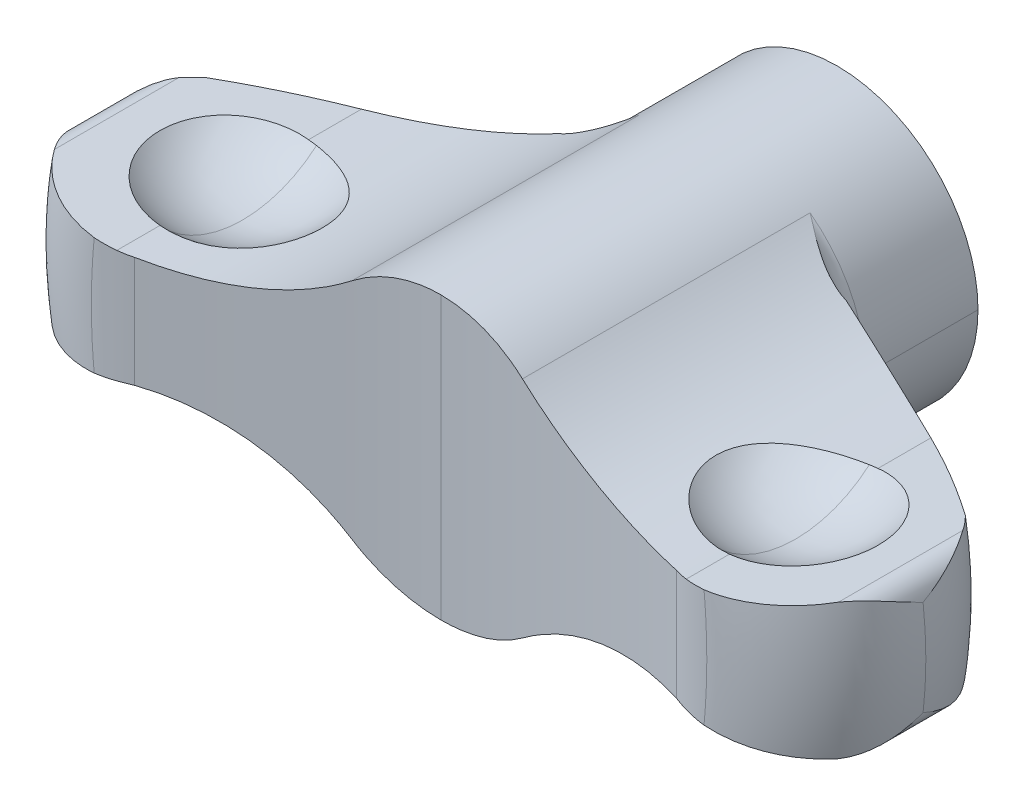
ISO-10303-21;
HEADER;
FILE_DESCRIPTION(('STEP AP214'),'2;1');
FILE_NAME('part.step','',(''),(''),'','','');
FILE_SCHEMA(('AUTOMOTIVE_DESIGN { 1 0 10303 214 1 1 1 1 }'));
ENDSEC;
DATA;
#1=APPLICATION_CONTEXT('core data for automotive mechanical design processes');
#2=APPLICATION_PROTOCOL_DEFINITION('international standard','automotive_design',2000,#1);
#3=PRODUCT_CONTEXT('',#1,'mechanical');
#4=PRODUCT('Part','Part','',(#3));
#5=PRODUCT_RELATED_PRODUCT_CATEGORY('part','',(#4));
#6=PRODUCT_DEFINITION_FORMATION('','',#4);
#7=PRODUCT_DEFINITION_CONTEXT('part definition',#1,'design');
#8=PRODUCT_DEFINITION('design','',#6,#7);
#9=PRODUCT_DEFINITION_SHAPE('','',#8);
#10=(LENGTH_UNIT() NAMED_UNIT(*) SI_UNIT(.MILLI.,.METRE.));
#11=(NAMED_UNIT(*) PLANE_ANGLE_UNIT() SI_UNIT($,.RADIAN.));
#12=(NAMED_UNIT(*) SI_UNIT($,.STERADIAN.) SOLID_ANGLE_UNIT());
#13=UNCERTAINTY_MEASURE_WITH_UNIT(LENGTH_MEASURE(1.E-05),#10,'distance_accuracy_value','');
#14=(GEOMETRIC_REPRESENTATION_CONTEXT(3) GLOBAL_UNCERTAINTY_ASSIGNED_CONTEXT((#13)) GLOBAL_UNIT_ASSIGNED_CONTEXT((#10,
#11,#12)) REPRESENTATION_CONTEXT('',''));
#15=CARTESIAN_POINT('',(0.,0.,0.));
#16=DIRECTION('',(0.,0.,1.));
#17=DIRECTION('',(1.,0.,0.));
#18=AXIS2_PLACEMENT_3D('',#15,#16,#17);
#19=CARTESIAN_POINT('',(13.25,6.75,15.25));
#20=DIRECTION('',(0.,0.,1.));
#21=DIRECTION('',(-1.,0.,0.));
#22=AXIS2_PLACEMENT_3D('',#19,#20,#21);
#23=SPHERICAL_SURFACE('',#22,5.4);
#24=CARTESIAN_POINT('',(13.25,6.75,15.25));
#25=DIRECTION('',(1.,0.,0.));
#26=DIRECTION('',(0.,0.,1.));
#27=AXIS2_PLACEMENT_3D('',#24,#25,#26);
#28=CIRCLE('',#27,5.4);
#29=CARTESIAN_POINT('',(13.25,1.35,15.25));
#30=VERTEX_POINT('',#29);
#31=CARTESIAN_POINT('',(13.25,2.67341046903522,18.7913864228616));
#32=VERTEX_POINT('',#31);
#33=EDGE_CURVE('E369',#30,#32,#28,.F.);
#34=ORIENTED_EDGE('',*,*,#33,.T.);
#35=CARTESIAN_POINT('',(13.6469742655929,2.7092176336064,18.8101248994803));
#36=CARTESIAN_POINT('',(13.5807778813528,2.70226198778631,18.8096097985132));
#37=CARTESIAN_POINT('',(13.5145985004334,2.69580023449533,18.8077907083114));
#38=CARTESIAN_POINT('',(13.3822737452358,2.6838645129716,18.8015445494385));
#39=CARTESIAN_POINT('',(13.3161283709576,2.67839054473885,18.7971174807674));
#40=CARTESIAN_POINT('',(13.25,2.67341046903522,18.7913864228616));
#41=B_SPLINE_CURVE_WITH_KNOTS('',3,(#35,#36,#37,#38,#39,#40),.UNSPECIFIED.,.F.,.F.,(4,2,4),(0.,
0.199556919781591,0.399113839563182),.UNSPECIFIED.);
#42=CARTESIAN_POINT('',(13.6469742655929,2.70921763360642,18.8101248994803));
#43=VERTEX_POINT('',#42);
#44=EDGE_CURVE('E270',#43,#32,#41,.T.);
#45=ORIENTED_EDGE('',*,*,#44,.F.);
#46=CARTESIAN_POINT('',(13.6469742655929,2.70921763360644,18.8101248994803));
#47=CARTESIAN_POINT('',(13.74655729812,2.71968423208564,18.8109101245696));
#48=CARTESIAN_POINT('',(13.8461684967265,2.73015379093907,18.8074517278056));
#49=CARTESIAN_POINT('',(14.0447432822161,2.751024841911,18.7921164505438));
#50=CARTESIAN_POINT('',(14.1437068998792,2.7614263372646,18.7802399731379));
#51=CARTESIAN_POINT('',(14.3402231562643,2.78208102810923,18.7481486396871));
#52=CARTESIAN_POINT('',(14.4377767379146,2.79233432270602,18.7279396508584));
#53=CARTESIAN_POINT('',(14.6308200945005,2.8126239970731,18.6793483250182));
#54=CARTESIAN_POINT('',(14.7263098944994,2.82266037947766,18.650966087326));
#55=CARTESIAN_POINT('',(15.0087595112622,2.8523470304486,18.5537886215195));
#56=CARTESIAN_POINT('',(15.1917827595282,2.87158354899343,18.4729489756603));
#57=CARTESIAN_POINT('',(15.5415956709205,2.90835036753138,18.2815763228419));
#58=CARTESIAN_POINT('',(15.7083885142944,2.92588100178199,18.1710491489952));
#59=CARTESIAN_POINT('',(16.0211856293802,2.95875730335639,17.9233963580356));
#60=CARTESIAN_POINT('',(16.1671894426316,2.97410292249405,17.7862701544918));
#61=CARTESIAN_POINT('',(16.4342444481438,3.00217153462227,17.489298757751));
#62=CARTESIAN_POINT('',(16.5552918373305,3.01489412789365,17.3294501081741));
#63=CARTESIAN_POINT('',(16.7689741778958,3.03735304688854,16.9915931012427));
#64=CARTESIAN_POINT('',(16.8616103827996,3.04708950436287,16.8135855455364));
#65=CARTESIAN_POINT('',(17.0158402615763,3.06329971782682,16.4444707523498));
#66=CARTESIAN_POINT('',(17.0774359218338,3.06977368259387,16.253364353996));
#67=CARTESIAN_POINT('',(17.1678468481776,3.07927625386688,15.8634621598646));
#68=CARTESIAN_POINT('',(17.1966614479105,3.08230479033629,15.6646662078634));
#69=CARTESIAN_POINT('',(17.2206901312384,3.08483030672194,15.2650270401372));
#70=CARTESIAN_POINT('',(17.2159034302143,3.08432720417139,15.0641837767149));
#71=CARTESIAN_POINT('',(17.1728638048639,3.07980355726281,14.6661578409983));
#72=CARTESIAN_POINT('',(17.1346111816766,3.07578304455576,14.4689751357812));
#73=CARTESIAN_POINT('',(17.0257262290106,3.06433877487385,14.0838669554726));
#74=CARTESIAN_POINT('',(16.9550940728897,3.05691503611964,13.8959414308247));
#75=CARTESIAN_POINT('',(16.7834534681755,3.03887488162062,13.5346771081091));
#76=CARTESIAN_POINT('',(16.6824443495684,3.02825839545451,13.3613386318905));
#77=CARTESIAN_POINT('',(16.4529214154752,3.00413456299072,13.0341801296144));
#78=CARTESIAN_POINT('',(16.3244086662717,2.99062732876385,12.8803593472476));
#79=CARTESIAN_POINT('',(16.0435440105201,2.96110726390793,12.5966116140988));
#80=CARTESIAN_POINT('',(15.8911949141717,2.94509472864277,12.4666818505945));
#81=CARTESIAN_POINT('',(15.5669134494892,2.91101137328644,12.2343486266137));
#82=CARTESIAN_POINT('',(15.3949757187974,2.89293998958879,12.1319527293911));
#83=CARTESIAN_POINT('',(15.0363791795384,2.85524997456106,11.9575956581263));
#84=CARTESIAN_POINT('',(14.8497123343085,2.83563049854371,11.8856512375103));
#85=CARTESIAN_POINT('',(14.4671407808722,2.79542060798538,11.7743939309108));
#86=CARTESIAN_POINT('',(14.2712491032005,2.77483156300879,11.7350363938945));
#87=CARTESIAN_POINT('',(14.0028192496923,2.74661844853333,11.7043866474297));
#88=CARTESIAN_POINT('',(13.9317141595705,2.73914500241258,11.6984560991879));
#89=CARTESIAN_POINT('',(13.7894021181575,2.72418740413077,11.6909286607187));
#90=CARTESIAN_POINT('',(13.718195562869,2.71670329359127,11.6893242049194));
#91=CARTESIAN_POINT('',(13.6469742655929,2.70921763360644,11.6898751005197));
#92=B_SPLINE_CURVE_WITH_KNOTS('',3,(#46,#47,#48,#49,#50,#51,#52,#53,#54,#55,#56,#57,#58,#59,#60,
#61,#62,#63,#64,#65,#66,#67,#68,#69,#70,#71,#72,#73,#74,#75,#76,#77,#78,#79,#80,#81,#82,#83,#84,
#85,#86,#87,#88,#89,#90,#91),.UNSPECIFIED.,.F.,.F.,(4,2,2,2,2,2,2,2,2,2,2,2,2,2,2,2,2,2,2,2,2,2,
4),(0.,0.300306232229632,0.600598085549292,0.90067885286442,1.20075597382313,1.80065907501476,
2.40044439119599,3.00024293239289,3.60013280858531,4.19999621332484,4.79982122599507,
5.39965843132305,5.99950964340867,6.59935545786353,7.19919806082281,7.79905389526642,
8.39888647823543,8.99864839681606,9.59857489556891,10.1988310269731,10.7982633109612,
11.013391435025,11.2281430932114),.UNSPECIFIED.);
#93=CARTESIAN_POINT('',(13.6469742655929,2.70921763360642,11.6898751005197));
#94=VERTEX_POINT('',#93);
#95=EDGE_CURVE('E273',#43,#94,#92,.T.);
#96=ORIENTED_EDGE('',*,*,#95,.T.);
#97=CARTESIAN_POINT('',(13.25,2.67341046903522,11.7086135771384));
#98=CARTESIAN_POINT('',(13.3161283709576,2.67839054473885,11.7028825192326));
#99=CARTESIAN_POINT('',(13.3822737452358,2.6838645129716,11.6984554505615));
#100=CARTESIAN_POINT('',(13.5145985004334,2.69580023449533,11.6922092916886));
#101=CARTESIAN_POINT('',(13.5807778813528,2.70226198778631,11.6903902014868));
#102=CARTESIAN_POINT('',(13.6469742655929,2.7092176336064,11.6898751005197));
#103=B_SPLINE_CURVE_WITH_KNOTS('',3,(#97,#98,#99,#100,#101,#102),.UNSPECIFIED.,.F.,.F.,(4,2,4),
(0.,0.199556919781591,0.399113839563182),.UNSPECIFIED.);
#104=CARTESIAN_POINT('',(13.25,2.67341046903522,11.7086135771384));
#105=VERTEX_POINT('',#104);
#106=EDGE_CURVE('E20',#105,#94,#103,.T.);
#107=ORIENTED_EDGE('',*,*,#106,.F.);
#108=CARTESIAN_POINT('',(13.25,6.75,15.25));
#109=DIRECTION('',(1.,0.,0.));
#110=DIRECTION('',(0.,0.,1.));
#111=AXIS2_PLACEMENT_3D('',#108,#109,#110);
#112=CIRCLE('',#111,5.4);
#113=EDGE_CURVE('E279',#105,#30,#112,.F.);
#114=ORIENTED_EDGE('',*,*,#113,.T.);
#115=EDGE_LOOP('',(#34,#45,#96,#107,#114));
#116=FACE_BOUND('',#115,.T.);
#117=ADVANCED_FACE('F15',(#116),#23,.F.);
#118=CARTESIAN_POINT('',(18.7921747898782,2.16666666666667,0.));
#119=DIRECTION('',(0.,0.,-1.));
#120=DIRECTION('',(0.,-1.,0.));
#121=AXIS2_PLACEMENT_3D('',#118,#119,#120);
#122=CYLINDRICAL_SURFACE('',#121,1.08333333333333);
#123=CARTESIAN_POINT('',(18.7921747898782,3.24999999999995,12.7683461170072));
#124=CARTESIAN_POINT('',(18.8135715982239,3.24999640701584,12.7989003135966));
#125=CARTESIAN_POINT('',(18.8347154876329,3.24933763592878,12.8296272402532));
#126=CARTESIAN_POINT('',(18.8772398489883,3.24676485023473,12.8925373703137));
#127=CARTESIAN_POINT('',(18.8986001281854,3.24480529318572,12.9247323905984));
#128=CARTESIAN_POINT('',(18.9414804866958,3.23960687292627,12.9906061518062));
#129=CARTESIAN_POINT('',(18.9629778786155,3.2363238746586,13.0242961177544));
#130=CARTESIAN_POINT('',(19.0060532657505,3.22845012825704,13.0931868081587));
#131=CARTESIAN_POINT('',(19.0276062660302,3.22381652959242,13.1283982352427));
#132=CARTESIAN_POINT('',(19.0707082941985,3.21321405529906,13.2003561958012));
#133=CARTESIAN_POINT('',(19.0922300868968,3.20720366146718,13.2371128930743));
#134=CARTESIAN_POINT('',(19.1351805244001,3.19381975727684,13.3121832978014));
#135=CARTESIAN_POINT('',(19.1565797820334,3.18640604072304,13.3505066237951));
#136=CARTESIAN_POINT('',(19.1991911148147,3.17018797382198,13.4287292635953));
#137=CARTESIAN_POINT('',(19.2203717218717,3.16134471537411,13.4686376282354));
#138=CARTESIAN_POINT('',(19.2624469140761,3.14224046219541,13.5500460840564));
#139=CARTESIAN_POINT('',(19.2833080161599,3.13194183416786,13.5915546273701));
#140=CARTESIAN_POINT('',(19.3246405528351,3.10990052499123,13.6761756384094));
#141=CARTESIAN_POINT('',(19.3450765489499,3.09812146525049,13.719295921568));
#142=CARTESIAN_POINT('',(19.3854504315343,3.07309363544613,13.8071484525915));
#143=CARTESIAN_POINT('',(19.4053509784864,3.05980971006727,13.8518878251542));
#144=CARTESIAN_POINT('',(19.4445408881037,3.03174888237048,13.9429830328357));
#145=CARTESIAN_POINT('',(19.4637910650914,3.01693806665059,13.9893452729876));
#146=CARTESIAN_POINT('',(19.5015621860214,2.98579715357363,14.0836828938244));
#147=CARTESIAN_POINT('',(19.5200421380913,2.96943422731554,14.1316638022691));
#148=CARTESIAN_POINT('',(19.5663126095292,2.92554403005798,14.256700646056));
#149=CARTESIAN_POINT('',(19.593016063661,2.89722239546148,14.3338827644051));
#150=CARTESIAN_POINT('',(19.6452451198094,2.83566369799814,14.4960825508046));
#151=CARTESIAN_POINT('',(19.6704074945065,2.80221611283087,14.5811366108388));
#152=CARTESIAN_POINT('',(19.7184399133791,2.73024644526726,14.7591391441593));
#153=CARTESIAN_POINT('',(19.7409101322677,2.69153722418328,14.8521202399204));
#154=CARTESIAN_POINT('',(19.7756642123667,2.62208726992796,15.0146110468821));
#155=CARTESIAN_POINT('',(19.789085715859,2.59181994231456,15.0840836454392));
#156=CARTESIAN_POINT('',(19.8164605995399,2.52176978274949,15.2429472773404));
#157=CARTESIAN_POINT('',(19.8294805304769,2.48172793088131,15.33238631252));
#158=CARTESIAN_POINT('',(19.8531035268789,2.39168225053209,15.5312015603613));
#159=CARTESIAN_POINT('',(19.8625335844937,2.34143532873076,15.6406084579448));
#160=CARTESIAN_POINT('',(19.8683786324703,2.29074889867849,15.75));
#161=B_SPLINE_CURVE_WITH_KNOTS('',3,(#123,#124,#125,#126,#127,#128,#129,#130,#131,#132,#133,
#134,#135,#136,#137,#138,#139,#140,#141,#142,#143,#144,#145,#146,#147,#148,#149,#150,#151,#152,
#153,#154,#155,#156,#157,#158,#159,#160),.UNSPECIFIED.,.F.,.F.,(4,2,2,2,2,2,2,2,2,2,2,2,2,2,2,2,
2,2,4),(0.,0.111891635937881,0.227923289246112,0.348195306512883,0.472800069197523,
0.601822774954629,0.735342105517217,0.87343079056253,1.01615607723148,1.16358011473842,
1.31576026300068,1.4727493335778,1.63459577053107,1.89380891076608,2.17807275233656,
2.48748871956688,2.71831204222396,3.01475351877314,3.3768163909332),.UNSPECIFIED.);
#162=CARTESIAN_POINT('',(18.7921747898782,3.25,12.7683461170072));
#163=VERTEX_POINT('',#162);
#164=CARTESIAN_POINT('',(19.8683786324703,2.29074889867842,15.75));
#165=VERTEX_POINT('',#164);
#166=EDGE_CURVE('E374',#163,#165,#161,.T.);
#167=ORIENTED_EDGE('',*,*,#166,.F.);
#168=DIRECTION('',(0.,0.,1.));
#169=VECTOR('',#168,1.);
#170=CARTESIAN_POINT('',(18.7921747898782,3.25,0.));
#171=LINE('',#170,#169);
#172=CARTESIAN_POINT('',(18.7921747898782,3.25,18.7316538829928));
#173=VERTEX_POINT('',#172);
#174=EDGE_CURVE('E534',#163,#173,#171,.T.);
#175=ORIENTED_EDGE('',*,*,#174,.T.);
#176=CARTESIAN_POINT('',(19.8683786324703,2.29074889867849,15.75));
#177=CARTESIAN_POINT('',(19.8625340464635,2.34143137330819,15.8593826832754));
#178=CARTESIAN_POINT('',(19.8531050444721,2.39167418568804,15.9687808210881));
#179=CARTESIAN_POINT('',(19.8294841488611,2.48171591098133,16.1675873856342));
#180=CARTESIAN_POINT('',(19.8164646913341,2.52175779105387,16.257026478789));
#181=CARTESIAN_POINT('',(19.7890891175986,2.59181211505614,16.4158989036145));
#182=CARTESIAN_POINT('',(19.7756660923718,2.62208342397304,16.4853802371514));
#183=CARTESIAN_POINT('',(19.7409127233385,2.69153216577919,16.6478675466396));
#184=CARTESIAN_POINT('',(19.7184457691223,2.73023663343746,16.7408364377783));
#185=CARTESIAN_POINT('',(19.6704179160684,2.80220176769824,16.9188270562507));
#186=CARTESIAN_POINT('',(19.6452561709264,2.83564930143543,17.0038813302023));
#187=CARTESIAN_POINT('',(19.593024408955,2.89721302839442,17.1660933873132));
#188=CARTESIAN_POINT('',(19.5663170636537,2.9255393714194,17.2432875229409));
#189=CARTESIAN_POINT('',(19.5200425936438,2.96943406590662,17.3683348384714));
#190=CARTESIAN_POINT('',(19.5015631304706,2.98579699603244,17.4163143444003));
#191=CARTESIAN_POINT('',(19.4637929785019,3.01693784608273,17.5106494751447));
#192=CARTESIAN_POINT('',(19.4445432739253,3.03174859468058,17.5570106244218));
#193=CARTESIAN_POINT('',(19.4053542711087,3.0598093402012,17.6481039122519));
#194=CARTESIAN_POINT('',(19.385454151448,3.07309324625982,17.6928424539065));
#195=CARTESIAN_POINT('',(19.3450810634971,3.09812105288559,17.7806935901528));
#196=CARTESIAN_POINT('',(19.3246454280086,3.10990010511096,17.8238133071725));
#197=CARTESIAN_POINT('',(19.2833135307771,3.13194141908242,17.9084334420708));
#198=CARTESIAN_POINT('',(19.2624527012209,3.14224005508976,17.9499416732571));
#199=CARTESIAN_POINT('',(19.2203779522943,3.16134433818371,18.03134975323));
#200=CARTESIAN_POINT('',(19.1991975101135,3.17018761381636,18.0712580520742));
#201=CARTESIAN_POINT('',(19.1565863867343,3.18640572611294,18.1494807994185));
#202=CARTESIAN_POINT('',(19.1351871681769,3.19381946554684,18.1878042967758));
#203=CARTESIAN_POINT('',(19.0922366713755,3.20720342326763,18.2628752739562));
#204=CARTESIAN_POINT('',(19.0707147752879,3.21321384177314,18.2996323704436));
#205=CARTESIAN_POINT('',(19.0276123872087,3.22381637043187,18.3715913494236));
#206=CARTESIAN_POINT('',(19.0060591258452,3.22844999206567,18.4068033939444));
#207=CARTESIAN_POINT('',(18.9629830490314,3.2363237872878,18.4756955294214));
#208=CARTESIAN_POINT('',(18.9414852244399,3.23960680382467,18.509386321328));
#209=CARTESIAN_POINT('',(18.8986038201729,3.24480526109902,18.5752619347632));
#210=CARTESIAN_POINT('',(18.8772429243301,3.24676482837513,18.6074579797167));
#211=CARTESIAN_POINT('',(18.8347171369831,3.24933763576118,18.6703703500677));
#212=CARTESIAN_POINT('',(18.8135724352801,3.24999640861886,18.7010984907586));
#213=CARTESIAN_POINT('',(18.7921747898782,3.24999999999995,18.7316538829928));
#214=B_SPLINE_CURVE_WITH_KNOTS('',3,(#176,#177,#178,#179,#180,#181,#182,#183,#184,#185,#186,
#187,#188,#189,#190,#191,#192,#193,#194,#195,#196,#197,#198,#199,#200,#201,#202,#203,#204,#205,
#206,#207,#208,#209,#210,#211,#212,#213),.UNSPECIFIED.,.F.,.F.,(4,2,2,2,2,2,2,2,2,2,2,2,2,2,2,2,
2,2,4),(0.,0.362033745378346,0.658475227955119,0.889327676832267,1.19870323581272,
1.4829670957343,1.74222062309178,1.90406282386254,2.06104841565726,2.21322584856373,
2.3606479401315,2.50337205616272,2.6414603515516,2.77498007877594,2.90400397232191,
3.02861071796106,3.14888551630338,3.26492075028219,3.37681676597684),.UNSPECIFIED.);
#215=EDGE_CURVE('E486',#165,#173,#214,.T.);
#216=ORIENTED_EDGE('',*,*,#215,.F.);
#217=EDGE_LOOP('',(#167,#175,#216));
#218=FACE_BOUND('',#217,.T.);
#219=ADVANCED_FACE('F782',(#218),#122,.T.);
#220=CARTESIAN_POINT('',(-18.7921747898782,2.16666666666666,0.));
#221=DIRECTION('',(0.,0.,-1.));
#222=DIRECTION('',(0.,-1.,0.));
#223=AXIS2_PLACEMENT_3D('',#220,#221,#222);
#224=CYLINDRICAL_SURFACE('',#223,1.08333333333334);
#225=DIRECTION('',(0.,0.,1.));
#226=VECTOR('',#225,1.);
#227=CARTESIAN_POINT('',(-18.7921747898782,3.25,0.));
#228=LINE('',#227,#226);
#229=CARTESIAN_POINT('',(-18.7921747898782,3.25,18.7316538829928));
#230=VERTEX_POINT('',#229);
#231=CARTESIAN_POINT('',(-18.7921747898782,3.25,12.7683461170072));
#232=VERTEX_POINT('',#231);
#233=EDGE_CURVE('E1357',#230,#232,#228,.F.);
#234=ORIENTED_EDGE('',*,*,#233,.T.);
#235=CARTESIAN_POINT('',(-19.868378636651,2.29074886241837,15.75));
#236=CARTESIAN_POINT('',(-19.862534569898,2.34142684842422,15.6406277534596));
#237=CARTESIAN_POINT('',(-19.8531067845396,2.39166508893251,15.5312399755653));
#238=CARTESIAN_POINT('',(-19.8294883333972,2.48170242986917,15.332443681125));
#239=CARTESIAN_POINT('',(-19.816469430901,2.52174438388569,15.2430045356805));
#240=CARTESIAN_POINT('',(-19.7890930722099,2.59180333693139,15.0841217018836));
#241=CARTESIAN_POINT('',(-19.7756682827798,2.62207909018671,15.0146300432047));
#242=CARTESIAN_POINT('',(-19.7409127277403,2.691532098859,14.8521324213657));
#243=CARTESIAN_POINT('',(-19.7184457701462,2.73023661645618,14.7591635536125));
#244=CARTESIAN_POINT('',(-19.6704179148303,2.80220178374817,14.581172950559));
#245=CARTESIAN_POINT('',(-19.6452561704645,2.83564930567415,14.4961186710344));
#246=CARTESIAN_POINT('',(-19.5930244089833,2.89721302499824,14.3339066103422));
#247=CARTESIAN_POINT('',(-19.5663170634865,2.92553937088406,14.2567124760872));
#248=CARTESIAN_POINT('',(-19.5200425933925,2.96943406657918,14.1316651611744));
#249=CARTESIAN_POINT('',(-19.5015631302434,2.98579699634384,14.0836856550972));
#250=CARTESIAN_POINT('',(-19.4637929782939,3.01693784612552,13.9893505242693));
#251=CARTESIAN_POINT('',(-19.4445432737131,3.03174859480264,13.9429893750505));
#252=CARTESIAN_POINT('',(-19.4053542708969,3.0598093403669,13.8518960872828));
#253=CARTESIAN_POINT('',(-19.3854541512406,3.07309324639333,13.8071575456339));
#254=CARTESIAN_POINT('',(-19.3450810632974,3.09812105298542,13.7193064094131));
#255=CARTESIAN_POINT('',(-19.3246454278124,3.10990010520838,13.6761866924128));
#256=CARTESIAN_POINT('',(-19.2833135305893,3.13194141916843,13.5915665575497));
#257=CARTESIAN_POINT('',(-19.262452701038,3.14224005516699,13.5500583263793));
#258=CARTESIAN_POINT('',(-19.2203779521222,3.16134433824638,13.4686502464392));
#259=CARTESIAN_POINT('',(-19.1991975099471,3.17018761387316,13.4287419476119));
#260=CARTESIAN_POINT('',(-19.1565863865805,3.18640572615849,13.3505192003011));
#261=CARTESIAN_POINT('',(-19.1351871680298,3.19381946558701,13.3121957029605));
#262=CARTESIAN_POINT('',(-19.0922366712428,3.20720342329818,13.2371247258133));
#263=CARTESIAN_POINT('',(-19.0707147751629,3.21321384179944,13.2003676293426));
#264=CARTESIAN_POINT('',(-19.0276123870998,3.22381637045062,13.1284086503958));
#265=CARTESIAN_POINT('',(-19.0060591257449,3.22844999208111,13.0931966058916));
#266=CARTESIAN_POINT('',(-18.9629830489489,3.2363237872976,13.0243044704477));
#267=CARTESIAN_POINT('',(-18.9414852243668,3.23960680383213,12.9906136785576));
#268=CARTESIAN_POINT('',(-18.8986038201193,3.24480526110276,12.9247380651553));
#269=CARTESIAN_POINT('',(-18.8772429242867,3.24676482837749,12.8925420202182));
#270=CARTESIAN_POINT('',(-18.8347171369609,3.24933763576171,12.8296296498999));
#271=CARTESIAN_POINT('',(-18.8135724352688,3.24999640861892,12.7989015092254));
#272=CARTESIAN_POINT('',(-18.7921747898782,3.25000000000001,12.7683461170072));
#273=B_SPLINE_CURVE_WITH_KNOTS('',3,(#235,#236,#237,#238,#239,#240,#241,#242,#243,#244,#245,
#246,#247,#248,#249,#250,#251,#252,#253,#254,#255,#256,#257,#258,#259,#260,#261,#262,#263,#264,
#265,#266,#267,#268,#269,#270,#271,#272),.UNSPECIFIED.,.F.,.F.,(4,2,2,2,2,2,2,2,2,2,2,2,2,2,2,2,
2,2,4),(0.,0.361999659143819,0.65844115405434,0.889327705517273,1.19870326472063,
1.48296712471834,1.74222065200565,1.90406285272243,2.0610484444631,2.2132258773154,
2.36064796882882,2.5033720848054,2.64146038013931,2.77498010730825,2.90400400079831,
3.02861074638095,3.14888554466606,3.26492077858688,3.37681679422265),.UNSPECIFIED.);
#274=CARTESIAN_POINT('',(-19.8683786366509,2.29074886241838,15.75));
#275=VERTEX_POINT('',#274);
#276=EDGE_CURVE('E767',#275,#232,#273,.T.);
#277=ORIENTED_EDGE('',*,*,#276,.F.);
#278=CARTESIAN_POINT('',(-18.7921747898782,3.25000000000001,18.7316538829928));
#279=CARTESIAN_POINT('',(-18.813571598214,3.24999640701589,18.7010996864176));
#280=CARTESIAN_POINT('',(-18.8347154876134,3.24933763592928,18.6703727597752));
#281=CARTESIAN_POINT('',(-18.87723984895,3.24676485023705,18.6074626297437));
#282=CARTESIAN_POINT('',(-18.8986001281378,3.24480529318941,18.5752676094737));
#283=CARTESIAN_POINT('',(-18.9414804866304,3.23960687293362,18.5093938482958));
#284=CARTESIAN_POINT('',(-18.9629778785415,3.23632387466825,18.4757038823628));
#285=CARTESIAN_POINT('',(-19.0060532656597,3.22845012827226,18.4068131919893));
#286=CARTESIAN_POINT('',(-19.0276062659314,3.22381652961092,18.3716017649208));
#287=CARTESIAN_POINT('',(-19.070708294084,3.21321405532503,18.2996438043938));
#288=CARTESIAN_POINT('',(-19.0922300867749,3.20720366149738,18.2628871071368));
#289=CARTESIAN_POINT('',(-19.1351805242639,3.19381975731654,18.187816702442));
#290=CARTESIAN_POINT('',(-19.1565797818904,3.18640604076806,18.1494933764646));
#291=CARTESIAN_POINT('',(-19.1991911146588,3.17018797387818,18.0712707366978));
#292=CARTESIAN_POINT('',(-19.2203717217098,3.16134471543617,18.0313623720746));
#293=CARTESIAN_POINT('',(-19.2624469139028,3.14224046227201,17.9499539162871));
#294=CARTESIAN_POINT('',(-19.2833080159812,3.13194183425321,17.9084453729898));
#295=CARTESIAN_POINT('',(-19.3246405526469,3.10990052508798,17.8238243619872));
#296=CARTESIAN_POINT('',(-19.3450765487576,3.09812146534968,17.7807040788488));
#297=CARTESIAN_POINT('',(-19.3854504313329,3.07309363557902,17.6928515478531));
#298=CARTESIAN_POINT('',(-19.40535097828,3.05980971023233,17.6481121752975));
#299=CARTESIAN_POINT('',(-19.4445408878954,3.03174888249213,17.5570169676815));
#300=CARTESIAN_POINT('',(-19.4637910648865,3.01693806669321,17.5106547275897));
#301=CARTESIAN_POINT('',(-19.5015621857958,2.98579715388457,17.4163171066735));
#302=CARTESIAN_POINT('',(-19.5200421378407,2.9694342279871,17.3683361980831));
#303=CARTESIAN_POINT('',(-19.5663126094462,2.92554402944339,17.2432993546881));
#304=CARTESIAN_POINT('',(-19.593016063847,2.89722239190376,17.1661172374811));
#305=CARTESIAN_POINT('',(-19.6452451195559,2.8356637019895,17.0039174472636));
#306=CARTESIAN_POINT('',(-19.6704074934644,2.80221612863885,16.9188633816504));
#307=CARTESIAN_POINT('',(-19.7184399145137,2.73024642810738,16.7408608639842));
#308=CARTESIAN_POINT('',(-19.7409101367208,2.6915371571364,16.6478797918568));
#309=CARTESIAN_POINT('',(-19.7756664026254,2.62208293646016,16.4853786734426));
#310=CARTESIAN_POINT('',(-19.7890896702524,2.59181116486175,16.4158957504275));
#311=CARTESIAN_POINT('',(-19.8164653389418,2.52175637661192,16.2570217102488));
#312=CARTESIAN_POINT('',(-19.8294847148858,2.48171445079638,16.1675826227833));
#313=CARTESIAN_POINT('',(-19.8531052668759,2.39167315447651,15.9687776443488));
#314=CARTESIAN_POINT('',(-19.8625341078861,2.34143080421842,15.8593811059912));
#315=CARTESIAN_POINT('',(-19.868378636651,2.29074886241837,15.75));
#316=B_SPLINE_CURVE_WITH_KNOTS('',3,(#278,#279,#280,#281,#282,#283,#284,#285,#286,#287,#288,
#289,#290,#291,#292,#293,#294,#295,#296,#297,#298,#299,#300,#301,#302,#303,#304,#305,#306,#307,
#308,#309,#310,#311,#312,#313,#314,#315),.UNSPECIFIED.,.F.,.F.,(4,2,2,2,2,2,2,2,2,2,2,2,2,2,2,2,
2,2,4),(0.,0.111891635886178,0.227923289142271,0.348195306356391,0.472800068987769,
0.601822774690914,0.735342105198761,0.87343079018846,1.01615607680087,1.16358011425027,
1.31576026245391,1.47274933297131,1.63459576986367,1.89380891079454,2.17807275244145,
2.48748871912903,2.71834614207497,3.0147876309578,3.37681641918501),.UNSPECIFIED.);
#317=EDGE_CURVE('E755',#230,#275,#316,.T.);
#318=ORIENTED_EDGE('',*,*,#317,.F.);
#319=EDGE_LOOP('',(#234,#277,#318));
#320=FACE_BOUND('',#319,.T.);
#321=ADVANCED_FACE('F741',(#320),#224,.T.);
#322=CARTESIAN_POINT('',(-13.25,6.75,15.25));
#323=DIRECTION('',(0.,0.,1.));
#324=DIRECTION('',(-1.,0.,0.));
#325=AXIS2_PLACEMENT_3D('',#322,#323,#324);
#326=SPHERICAL_SURFACE('',#325,5.4);
#327=CARTESIAN_POINT('',(-13.6469742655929,2.7092176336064,11.6898751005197));
#328=CARTESIAN_POINT('',(-13.5807778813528,2.70226198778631,11.6903902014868));
#329=CARTESIAN_POINT('',(-13.5145985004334,2.69580023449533,11.6922092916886));
#330=CARTESIAN_POINT('',(-13.3822737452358,2.6838645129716,11.6984554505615));
#331=CARTESIAN_POINT('',(-13.3161283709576,2.67839054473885,11.7028825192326));
#332=CARTESIAN_POINT('',(-13.25,2.67341046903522,11.7086135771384));
#333=B_SPLINE_CURVE_WITH_KNOTS('',3,(#327,#328,#329,#330,#331,#332),.UNSPECIFIED.,.F.,.F.,(4,2,
4),(0.,0.199556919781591,0.399113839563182),.UNSPECIFIED.);
#334=CARTESIAN_POINT('',(-13.6469742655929,2.70921763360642,11.6898751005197));
#335=VERTEX_POINT('',#334);
#336=CARTESIAN_POINT('',(-13.25,2.67341046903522,11.7086135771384));
#337=VERTEX_POINT('',#336);
#338=EDGE_CURVE('E720',#335,#337,#333,.T.);
#339=ORIENTED_EDGE('',*,*,#338,.F.);
#340=CARTESIAN_POINT('',(-13.6469742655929,2.70921763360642,11.6898751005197));
#341=CARTESIAN_POINT('',(-13.74655729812,2.71968423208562,11.6890898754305));
#342=CARTESIAN_POINT('',(-13.8461684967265,2.73015379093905,11.6925482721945));
#343=CARTESIAN_POINT('',(-14.0447432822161,2.75102484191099,11.7078835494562));
#344=CARTESIAN_POINT('',(-14.1437068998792,2.76142633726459,11.7197600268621));
#345=CARTESIAN_POINT('',(-14.3402231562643,2.78208102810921,11.7518513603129));
#346=CARTESIAN_POINT('',(-14.4377767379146,2.792334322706,11.7720603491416));
#347=CARTESIAN_POINT('',(-14.6308200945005,2.81262399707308,11.8206516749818));
#348=CARTESIAN_POINT('',(-14.7263098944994,2.82266037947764,11.849033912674));
#349=CARTESIAN_POINT('',(-15.0087595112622,2.85234703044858,11.9462113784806));
#350=CARTESIAN_POINT('',(-15.1917827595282,2.87158354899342,12.0270510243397));
#351=CARTESIAN_POINT('',(-15.5415956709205,2.90835036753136,12.2184236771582));
#352=CARTESIAN_POINT('',(-15.7083885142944,2.92588100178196,12.3289508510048));
#353=CARTESIAN_POINT('',(-16.0211856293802,2.95875730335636,12.5766036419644));
#354=CARTESIAN_POINT('',(-16.1671894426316,2.97410292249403,12.7137298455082));
#355=CARTESIAN_POINT('',(-16.4342444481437,3.00217153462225,13.010701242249));
#356=CARTESIAN_POINT('',(-16.5552918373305,3.01489412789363,13.1705498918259));
#357=CARTESIAN_POINT('',(-16.7689741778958,3.03735304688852,13.5084068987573));
#358=CARTESIAN_POINT('',(-16.8616103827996,3.04708950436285,13.6864144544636));
#359=CARTESIAN_POINT('',(-17.0158402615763,3.06329971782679,14.0555292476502));
#360=CARTESIAN_POINT('',(-17.0774359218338,3.06977368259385,14.246635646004));
#361=CARTESIAN_POINT('',(-17.1678468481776,3.07927625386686,14.6365378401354));
#362=CARTESIAN_POINT('',(-17.1966614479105,3.08230479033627,14.8353337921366));
#363=CARTESIAN_POINT('',(-17.2206901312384,3.08483030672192,15.2349729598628));
#364=CARTESIAN_POINT('',(-17.2159034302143,3.08432720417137,15.4358162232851));
#365=CARTESIAN_POINT('',(-17.1728638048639,3.07980355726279,15.8338421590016));
#366=CARTESIAN_POINT('',(-17.1346111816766,3.07578304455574,16.0310248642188));
#367=CARTESIAN_POINT('',(-17.0257262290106,3.06433877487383,16.4161330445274));
#368=CARTESIAN_POINT('',(-16.9550940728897,3.05691503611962,16.6040585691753));
#369=CARTESIAN_POINT('',(-16.7834534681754,3.0388748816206,16.9653228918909));
#370=CARTESIAN_POINT('',(-16.6824443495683,3.02825839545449,17.1386613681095));
#371=CARTESIAN_POINT('',(-16.4529214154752,3.0041345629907,17.4658198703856));
#372=CARTESIAN_POINT('',(-16.3244086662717,2.99062732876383,17.6196406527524));
#373=CARTESIAN_POINT('',(-16.0435440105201,2.96110726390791,17.9033883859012));
#374=CARTESIAN_POINT('',(-15.8911949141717,2.94509472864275,18.0333181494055));
#375=CARTESIAN_POINT('',(-15.5669134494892,2.91101137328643,18.2656513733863));
#376=CARTESIAN_POINT('',(-15.3949757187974,2.89293998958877,18.3680472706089));
#377=CARTESIAN_POINT('',(-15.0363791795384,2.85524997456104,18.5424043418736));
#378=CARTESIAN_POINT('',(-14.8497123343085,2.83563049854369,18.6143487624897));
#379=CARTESIAN_POINT('',(-14.4671407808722,2.79542060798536,18.7256060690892));
#380=CARTESIAN_POINT('',(-14.2712491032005,2.77483156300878,18.7649636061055));
#381=CARTESIAN_POINT('',(-14.0028192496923,2.74661844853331,18.7956133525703));
#382=CARTESIAN_POINT('',(-13.9317141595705,2.73914500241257,18.8015439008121));
#383=CARTESIAN_POINT('',(-13.7894021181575,2.72418740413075,18.8090713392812));
#384=CARTESIAN_POINT('',(-13.718195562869,2.71670329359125,18.8106757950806));
#385=CARTESIAN_POINT('',(-13.6469742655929,2.70921763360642,18.8101248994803));
#386=B_SPLINE_CURVE_WITH_KNOTS('',3,(#340,#341,#342,#343,#344,#345,#346,#347,#348,#349,#350,
#351,#352,#353,#354,#355,#356,#357,#358,#359,#360,#361,#362,#363,#364,#365,#366,#367,#368,#369,
#370,#371,#372,#373,#374,#375,#376,#377,#378,#379,#380,#381,#382,#383,#384,#385),.UNSPECIFIED.,
.F.,.F.,(4,2,2,2,2,2,2,2,2,2,2,2,2,2,2,2,2,2,2,2,2,2,4),(0.,0.30030623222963,0.60059808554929,
0.900678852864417,1.20075597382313,1.80065907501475,2.40044439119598,3.00024293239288,
3.60013280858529,4.19999621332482,4.79982122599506,5.39965843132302,5.99950964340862,
6.5993554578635,7.19919806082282,7.7990538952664,8.39888647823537,8.99864839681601,
9.59857489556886,10.198831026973,10.7982633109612,11.0133914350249,11.2281430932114),.UNSPECIFIED.);
#387=CARTESIAN_POINT('',(-13.6469742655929,2.70921763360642,18.8101248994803));
#388=VERTEX_POINT('',#387);
#389=EDGE_CURVE('E458',#335,#388,#386,.T.);
#390=ORIENTED_EDGE('',*,*,#389,.T.);
#391=CARTESIAN_POINT('',(-13.25,2.67341046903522,18.7913864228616));
#392=CARTESIAN_POINT('',(-13.3161283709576,2.67839054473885,18.7971174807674));
#393=CARTESIAN_POINT('',(-13.3822737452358,2.6838645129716,18.8015445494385));
#394=CARTESIAN_POINT('',(-13.5145985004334,2.69580023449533,18.8077907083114));
#395=CARTESIAN_POINT('',(-13.5807778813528,2.70226198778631,18.8096097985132));
#396=CARTESIAN_POINT('',(-13.6469742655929,2.7092176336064,18.8101248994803));
#397=B_SPLINE_CURVE_WITH_KNOTS('',3,(#391,#392,#393,#394,#395,#396),.UNSPECIFIED.,.F.,.F.,(4,2,
4),(0.,0.199556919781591,0.399113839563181),.UNSPECIFIED.);
#398=CARTESIAN_POINT('',(-13.25,2.67341046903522,18.7913864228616));
#399=VERTEX_POINT('',#398);
#400=EDGE_CURVE('E727',#399,#388,#397,.T.);
#401=ORIENTED_EDGE('',*,*,#400,.F.);
#402=CARTESIAN_POINT('',(-13.25,6.75,15.25));
#403=DIRECTION('',(1.,0.,0.));
#404=DIRECTION('',(0.,0.,1.));
#405=AXIS2_PLACEMENT_3D('',#402,#403,#404);
#406=CIRCLE('',#405,5.4);
#407=CARTESIAN_POINT('',(-13.25,1.35,15.25));
#408=VERTEX_POINT('',#407);
#409=EDGE_CURVE('E1591',#399,#408,#406,.T.);
#410=ORIENTED_EDGE('',*,*,#409,.T.);
#411=CARTESIAN_POINT('',(-13.25,6.75,15.25));
#412=DIRECTION('',(1.,0.,0.));
#413=DIRECTION('',(0.,0.,1.));
#414=AXIS2_PLACEMENT_3D('',#411,#412,#413);
#415=CIRCLE('',#414,5.4);
#416=EDGE_CURVE('E1593',#408,#337,#415,.T.);
#417=ORIENTED_EDGE('',*,*,#416,.T.);
#418=EDGE_LOOP('',(#339,#390,#401,#410,#417));
#419=FACE_BOUND('',#418,.T.);
#420=ADVANCED_FACE('F736',(#419),#326,.F.);
#421=CARTESIAN_POINT('',(18.7921747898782,-2.16666666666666,0.));
#422=DIRECTION('',(0.,0.,-1.));
#423=DIRECTION('',(0.,-1.,0.));
#424=AXIS2_PLACEMENT_3D('',#421,#422,#423);
#425=CYLINDRICAL_SURFACE('',#424,1.08333333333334);
#426=CARTESIAN_POINT('',(18.7921747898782,-3.24999999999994,18.7316538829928));
#427=CARTESIAN_POINT('',(18.8135715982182,-3.24999640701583,18.7010996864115));
#428=CARTESIAN_POINT('',(18.8347154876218,-3.24933763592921,18.6703727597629));
#429=CARTESIAN_POINT('',(18.8772398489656,-3.24676485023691,18.6074626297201));
#430=CARTESIAN_POINT('',(18.8986001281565,-3.24480529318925,18.575267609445));
#431=CARTESIAN_POINT('',(18.9414804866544,-3.23960687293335,18.5093938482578));
#432=CARTESIAN_POINT('',(18.9629778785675,-3.23632387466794,18.4757038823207));
#433=CARTESIAN_POINT('',(19.0060532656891,-3.22845012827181,18.4068131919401));
#434=CARTESIAN_POINT('',(19.027606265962,-3.22381652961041,18.3716017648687));
#435=CARTESIAN_POINT('',(19.0707082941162,-3.21321405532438,18.2996438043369));
#436=CARTESIAN_POINT('',(19.0922300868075,-3.20720366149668,18.2628871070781));
#437=CARTESIAN_POINT('',(19.1351805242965,-3.19381975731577,18.1878167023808));
#438=CARTESIAN_POINT('',(19.1565797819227,-3.18640604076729,18.1494933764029));
#439=CARTESIAN_POINT('',(19.1991911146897,-3.17018797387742,18.0712707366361));
#440=CARTESIAN_POINT('',(19.2203717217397,-3.16134471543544,18.0313623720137));
#441=CARTESIAN_POINT('',(19.2624469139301,-3.1422404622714,17.9499539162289));
#442=CARTESIAN_POINT('',(19.283308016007,-3.13194183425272,17.9084453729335));
#443=CARTESIAN_POINT('',(19.3246405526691,-3.10990052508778,17.8238243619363));
#444=CARTESIAN_POINT('',(19.3450765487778,-3.09812146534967,17.7807040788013));
#445=CARTESIAN_POINT('',(19.3854504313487,-3.07309363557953,17.6928515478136));
#446=CARTESIAN_POINT('',(19.4053509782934,-3.05980971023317,17.6481121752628));
#447=CARTESIAN_POINT('',(19.4445408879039,-3.03174888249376,17.5570169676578));
#448=CARTESIAN_POINT('',(19.4637910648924,-3.01693806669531,17.5106547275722));
#449=CARTESIAN_POINT('',(19.5015621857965,-2.98579715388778,17.4163171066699));
#450=CARTESIAN_POINT('',(19.5200421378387,-2.96943422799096,17.3683361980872));
#451=CARTESIAN_POINT('',(19.5663126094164,-2.92554402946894,17.2432993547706));
#452=CARTESIAN_POINT('',(19.5930160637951,-2.89722239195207,17.1661172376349));
#453=CARTESIAN_POINT('',(19.6452451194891,-2.835663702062,17.0039174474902));
#454=CARTESIAN_POINT('',(19.6704074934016,-2.80221612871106,16.9188633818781));
#455=CARTESIAN_POINT('',(19.7184399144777,-2.73024642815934,16.7408608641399));
#456=CARTESIAN_POINT('',(19.7409101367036,-2.69153715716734,16.6478797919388));
#457=CARTESIAN_POINT('',(19.7756664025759,-2.62208293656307,16.4853786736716));
#458=CARTESIAN_POINT('',(19.7890896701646,-2.59181116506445,16.4158957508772));
#459=CARTESIAN_POINT('',(19.8164653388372,-2.52175637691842,16.2570217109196));
#460=CARTESIAN_POINT('',(19.8294847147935,-2.48171445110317,16.1675826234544));
#461=CARTESIAN_POINT('',(19.8531052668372,-2.39167315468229,15.9687776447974));
#462=CARTESIAN_POINT('',(19.8625341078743,-2.34143080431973,15.8593811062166));
#463=CARTESIAN_POINT('',(19.868378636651,-2.29074886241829,15.75));
#464=B_SPLINE_CURVE_WITH_KNOTS('',3,(#426,#427,#428,#429,#430,#431,#432,#433,#434,#435,#436,
#437,#438,#439,#440,#441,#442,#443,#444,#445,#446,#447,#448,#449,#450,#451,#452,#453,#454,#455,
#456,#457,#458,#459,#460,#461,#462,#463),.UNSPECIFIED.,.F.,.F.,(4,2,2,2,2,2,2,2,2,2,2,2,2,2,2,2,
2,2,4),(0.,0.11189163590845,0.227923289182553,0.348195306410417,0.472800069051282,
0.601822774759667,0.73534210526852,0.873430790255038,1.01615607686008,1.16358011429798,
1.31576026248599,1.47274933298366,1.63459576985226,1.89380891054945,2.17807275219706,
2.48748871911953,2.71834614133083,3.01478763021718,3.37681641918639),.UNSPECIFIED.);
#465=CARTESIAN_POINT('',(18.7921747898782,-3.25,18.7316538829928));
#466=VERTEX_POINT('',#465);
#467=CARTESIAN_POINT('',(19.8683786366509,-2.29074886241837,15.75));
#468=VERTEX_POINT('',#467);
#469=EDGE_CURVE('E520',#466,#468,#464,.T.);
#470=ORIENTED_EDGE('',*,*,#469,.F.);
#471=DIRECTION('',(0.,0.,1.));
#472=VECTOR('',#471,1.);
#473=CARTESIAN_POINT('',(18.7921747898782,-3.25,0.));
#474=LINE('',#473,#472);
#475=CARTESIAN_POINT('',(18.7921747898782,-3.25,12.7683461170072));
#476=VERTEX_POINT('',#475);
#477=EDGE_CURVE('E440',#466,#476,#474,.F.);
#478=ORIENTED_EDGE('',*,*,#477,.T.);
#479=CARTESIAN_POINT('',(19.868378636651,-2.29074886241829,15.75));
#480=CARTESIAN_POINT('',(19.8625345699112,-2.34142684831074,15.6406277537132));
#481=CARTESIAN_POINT('',(19.853106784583,-2.39166508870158,15.5312399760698));
#482=CARTESIAN_POINT('',(19.8294883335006,-2.48170242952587,15.3324436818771));
#483=CARTESIAN_POINT('',(19.8164694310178,-2.52174438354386,15.2430045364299));
#484=CARTESIAN_POINT('',(19.7890930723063,-2.59180333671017,15.0841217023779));
#485=CARTESIAN_POINT('',(19.7756682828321,-2.62207909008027,15.0146300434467));
#486=CARTESIAN_POINT('',(19.7409127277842,-2.69153209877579,14.8521324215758));
#487=CARTESIAN_POINT('',(19.7184457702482,-2.73023661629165,14.7591635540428));
#488=CARTESIAN_POINT('',(19.6704179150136,-2.80220178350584,14.5811729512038));
#489=CARTESIAN_POINT('',(19.6452561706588,-2.83564930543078,14.4961186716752));
#490=CARTESIAN_POINT('',(19.5930244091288,-2.8972130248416,14.3339066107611));
#491=CARTESIAN_POINT('',(19.5663170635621,-2.92553937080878,14.2567124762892));
#492=CARTESIAN_POINT('',(19.5200425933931,-2.96943406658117,14.1316651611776));
#493=CARTESIAN_POINT('',(19.5015631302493,-2.98579699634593,14.083685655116));
#494=CARTESIAN_POINT('',(19.4637929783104,-3.01693784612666,13.9893505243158));
#495=CARTESIAN_POINT('',(19.4445432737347,-3.03174859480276,13.9429893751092));
#496=CARTESIAN_POINT('',(19.4053542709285,-3.05980934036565,13.851896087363));
#497=CARTESIAN_POINT('',(19.3854541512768,-3.07309324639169,13.8071575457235));
#498=CARTESIAN_POINT('',(19.3450810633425,-3.09812105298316,13.7193064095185));
#499=CARTESIAN_POINT('',(19.3246454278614,-3.10990010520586,13.6761866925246));
#500=CARTESIAN_POINT('',(19.2833135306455,-3.13194141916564,13.5915665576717));
#501=CARTESIAN_POINT('',(19.2624527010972,-3.14224005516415,13.550058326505));
#502=CARTESIAN_POINT('',(19.2203779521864,-3.16134433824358,13.4686502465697));
#503=CARTESIAN_POINT('',(19.1991975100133,-3.1701876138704,13.4287419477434));
#504=CARTESIAN_POINT('',(19.1565863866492,-3.18640572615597,13.3505192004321));
#505=CARTESIAN_POINT('',(19.1351871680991,-3.19381946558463,13.3121957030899));
#506=CARTESIAN_POINT('',(19.0922366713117,-3.20720342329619,13.2371247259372));
#507=CARTESIAN_POINT('',(19.0707147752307,-3.21321384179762,13.2003676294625));
#508=CARTESIAN_POINT('',(19.0276123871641,-3.22381637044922,13.1284086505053));
#509=CARTESIAN_POINT('',(19.0060591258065,-3.22844999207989,13.0931966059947));
#510=CARTESIAN_POINT('',(18.9629830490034,-3.2363237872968,13.0243044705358));
#511=CARTESIAN_POINT('',(18.9414852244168,-3.23960680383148,12.9906136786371));
#512=CARTESIAN_POINT('',(18.8986038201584,-3.24480526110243,12.9247380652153));
#513=CARTESIAN_POINT('',(18.8772429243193,-3.24676482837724,12.8925420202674));
#514=CARTESIAN_POINT('',(18.8347171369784,-3.24933763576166,12.8296296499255));
#515=CARTESIAN_POINT('',(18.8135724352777,-3.24999640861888,12.798901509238));
#516=CARTESIAN_POINT('',(18.7921747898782,-3.24999999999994,12.7683461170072));
#517=B_SPLINE_CURVE_WITH_KNOTS('',3,(#479,#480,#481,#482,#483,#484,#485,#486,#487,#488,#489,
#490,#491,#492,#493,#494,#495,#496,#497,#498,#499,#500,#501,#502,#503,#504,#505,#506,#507,#508,
#509,#510,#511,#512,#513,#514,#515,#516),.UNSPECIFIED.,.F.,.F.,(4,2,2,2,2,2,2,2,2,2,2,2,2,2,2,2,
2,2,4),(0.,0.361999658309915,0.6584411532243,0.889327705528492,1.19870326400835,
1.48296712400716,1.74222065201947,1.90406285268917,2.06104844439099,2.21322587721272,
2.36064796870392,2.50337208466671,2.64146037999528,2.77498010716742,2.90400400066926,
3.02861074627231,3.14888554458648,3.26492077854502,3.37681679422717),.UNSPECIFIED.);
#518=EDGE_CURVE('E382',#468,#476,#517,.T.);
#519=ORIENTED_EDGE('',*,*,#518,.F.);
#520=EDGE_LOOP('',(#470,#478,#519));
#521=FACE_BOUND('',#520,.T.);
#522=ADVANCED_FACE('F410',(#521),#425,.T.);
#523=CARTESIAN_POINT('',(13.25,-6.75,15.25));
#524=DIRECTION('',(0.,0.,1.));
#525=DIRECTION('',(-1.,0.,0.));
#526=AXIS2_PLACEMENT_3D('',#523,#524,#525);
#527=SPHERICAL_SURFACE('',#526,5.4);
#528=CARTESIAN_POINT('',(13.25,-6.75,15.25));
#529=DIRECTION('',(-1.,0.,0.));
#530=DIRECTION('',(0.,0.,1.));
#531=AXIS2_PLACEMENT_3D('',#528,#529,#530);
#532=CIRCLE('',#531,5.4);
#533=CARTESIAN_POINT('',(13.25,-1.35,15.25));
#534=VERTEX_POINT('',#533);
#535=CARTESIAN_POINT('',(13.25,-2.67341046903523,11.7086135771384));
#536=VERTEX_POINT('',#535);
#537=EDGE_CURVE('E1344',#534,#536,#532,.T.);
#538=ORIENTED_EDGE('',*,*,#537,.T.);
#539=CARTESIAN_POINT('',(13.6469742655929,-2.70921763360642,11.6898751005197));
#540=CARTESIAN_POINT('',(13.5807778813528,-2.70226198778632,11.6903902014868));
#541=CARTESIAN_POINT('',(13.5145985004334,-2.69580023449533,11.6922092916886));
#542=CARTESIAN_POINT('',(13.3822737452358,-2.68386451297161,11.6984554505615));
#543=CARTESIAN_POINT('',(13.3161283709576,-2.67839054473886,11.7028825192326));
#544=CARTESIAN_POINT('',(13.25,-2.67341046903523,11.7086135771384));
#545=B_SPLINE_CURVE_WITH_KNOTS('',3,(#539,#540,#541,#542,#543,#544),.UNSPECIFIED.,.F.,.F.,(4,2,
4),(0.,0.19955691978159,0.399113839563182),.UNSPECIFIED.);
#546=CARTESIAN_POINT('',(13.6469742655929,-2.70921763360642,11.6898751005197));
#547=VERTEX_POINT('',#546);
#548=EDGE_CURVE('E417',#547,#536,#545,.T.);
#549=ORIENTED_EDGE('',*,*,#548,.F.);
#550=CARTESIAN_POINT('',(13.6469742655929,-2.70921763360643,11.6898751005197));
#551=CARTESIAN_POINT('',(13.74655729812,-2.71968423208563,11.6890898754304));
#552=CARTESIAN_POINT('',(13.8461684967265,-2.73015379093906,11.6925482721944));
#553=CARTESIAN_POINT('',(14.0447432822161,-2.751024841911,11.7078835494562));
#554=CARTESIAN_POINT('',(14.1437068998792,-2.7614263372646,11.7197600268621));
#555=CARTESIAN_POINT('',(14.3402231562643,-2.78208102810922,11.7518513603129));
#556=CARTESIAN_POINT('',(14.4377767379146,-2.79233432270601,11.7720603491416));
#557=CARTESIAN_POINT('',(14.6308200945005,-2.81262399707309,11.8206516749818));
#558=CARTESIAN_POINT('',(14.7263098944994,-2.82266037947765,11.849033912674));
#559=CARTESIAN_POINT('',(15.0087595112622,-2.85234703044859,11.9462113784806));
#560=CARTESIAN_POINT('',(15.1917827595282,-2.87158354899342,12.0270510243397));
#561=CARTESIAN_POINT('',(15.5415956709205,-2.90835036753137,12.2184236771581));
#562=CARTESIAN_POINT('',(15.7083885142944,-2.92588100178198,12.3289508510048));
#563=CARTESIAN_POINT('',(16.0211856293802,-2.95875730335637,12.5766036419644));
#564=CARTESIAN_POINT('',(16.1671894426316,-2.97410292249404,12.7137298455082));
#565=CARTESIAN_POINT('',(16.4342444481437,-3.00217153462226,13.010701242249));
#566=CARTESIAN_POINT('',(16.5552918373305,-3.01489412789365,13.1705498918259));
#567=CARTESIAN_POINT('',(16.7689741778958,-3.03735304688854,13.5084068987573));
#568=CARTESIAN_POINT('',(16.8616103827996,-3.04708950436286,13.6864144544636));
#569=CARTESIAN_POINT('',(17.0158402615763,-3.0632997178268,14.0555292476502));
#570=CARTESIAN_POINT('',(17.0774359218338,-3.06977368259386,14.2466356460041));
#571=CARTESIAN_POINT('',(17.1678468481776,-3.07927625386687,14.6365378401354));
#572=CARTESIAN_POINT('',(17.1966614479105,-3.08230479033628,14.8353337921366));
#573=CARTESIAN_POINT('',(17.2206901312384,-3.08483030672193,15.2349729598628));
#574=CARTESIAN_POINT('',(17.2159034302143,-3.08432720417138,15.4358162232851));
#575=CARTESIAN_POINT('',(17.1728638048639,-3.0798035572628,15.8338421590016));
#576=CARTESIAN_POINT('',(17.1346111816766,-3.07578304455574,16.0310248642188));
#577=CARTESIAN_POINT('',(17.0257262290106,-3.06433877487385,16.4161330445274));
#578=CARTESIAN_POINT('',(16.9550940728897,-3.05691503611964,16.6040585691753));
#579=CARTESIAN_POINT('',(16.7834534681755,-3.03887488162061,16.9653228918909));
#580=CARTESIAN_POINT('',(16.6824443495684,-3.0282583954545,17.1386613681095));
#581=CARTESIAN_POINT('',(16.4529214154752,-3.00413456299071,17.4658198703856));
#582=CARTESIAN_POINT('',(16.3244086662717,-2.99062732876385,17.6196406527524));
#583=CARTESIAN_POINT('',(16.0435440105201,-2.96110726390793,17.9033883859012));
#584=CARTESIAN_POINT('',(15.8911949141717,-2.94509472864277,18.0333181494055));
#585=CARTESIAN_POINT('',(15.5669134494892,-2.91101137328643,18.2656513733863));
#586=CARTESIAN_POINT('',(15.3949757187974,-2.89293998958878,18.3680472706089));
#587=CARTESIAN_POINT('',(15.0363791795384,-2.85524997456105,18.5424043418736));
#588=CARTESIAN_POINT('',(14.8497123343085,-2.8356304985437,18.6143487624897));
#589=CARTESIAN_POINT('',(14.4671407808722,-2.79542060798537,18.7256060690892));
#590=CARTESIAN_POINT('',(14.2712491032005,-2.77483156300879,18.7649636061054));
#591=CARTESIAN_POINT('',(14.0028192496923,-2.74661844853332,18.7956133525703));
#592=CARTESIAN_POINT('',(13.9317141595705,-2.73914500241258,18.8015439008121));
#593=CARTESIAN_POINT('',(13.7894021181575,-2.72418740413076,18.8090713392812));
#594=CARTESIAN_POINT('',(13.718195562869,-2.71670329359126,18.8106757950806));
#595=CARTESIAN_POINT('',(13.6469742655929,-2.70921763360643,18.8101248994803));
#596=B_SPLINE_CURVE_WITH_KNOTS('',3,(#550,#551,#552,#553,#554,#555,#556,#557,#558,#559,#560,
#561,#562,#563,#564,#565,#566,#567,#568,#569,#570,#571,#572,#573,#574,#575,#576,#577,#578,#579,
#580,#581,#582,#583,#584,#585,#586,#587,#588,#589,#590,#591,#592,#593,#594,#595),.UNSPECIFIED.,
.F.,.F.,(4,2,2,2,2,2,2,2,2,2,2,2,2,2,2,2,2,2,2,2,2,2,4),(0.,0.300306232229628,0.600598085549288,
0.900678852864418,1.20075597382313,1.80065907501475,2.40044439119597,3.00024293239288,
3.6001328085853,4.19999621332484,4.79982122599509,5.39965843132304,5.99950964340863,
6.59935545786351,7.19919806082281,7.7990538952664,8.39888647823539,8.99864839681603,
9.59857489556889,10.1988310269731,10.7982633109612,11.013391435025,11.2281430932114),.UNSPECIFIED.);
#597=CARTESIAN_POINT('',(13.6469742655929,-2.70921763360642,18.8101248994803));
#598=VERTEX_POINT('',#597);
#599=EDGE_CURVE('E424',#547,#598,#596,.T.);
#600=ORIENTED_EDGE('',*,*,#599,.T.);
#601=CARTESIAN_POINT('',(13.25,-2.67341046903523,18.7913864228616));
#602=CARTESIAN_POINT('',(13.3161283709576,-2.67839054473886,18.7971174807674));
#603=CARTESIAN_POINT('',(13.3822737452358,-2.68386451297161,18.8015445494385));
#604=CARTESIAN_POINT('',(13.5145985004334,-2.69580023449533,18.8077907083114));
#605=CARTESIAN_POINT('',(13.5807778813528,-2.70226198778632,18.8096097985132));
#606=CARTESIAN_POINT('',(13.6469742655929,-2.70921763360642,18.8101248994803));
#607=B_SPLINE_CURVE_WITH_KNOTS('',3,(#601,#602,#603,#604,#605,#606),.UNSPECIFIED.,.F.,.F.,(4,2,
4),(0.,0.199556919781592,0.399113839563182),.UNSPECIFIED.);
#608=CARTESIAN_POINT('',(13.25,-2.67341046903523,18.7913864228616));
#609=VERTEX_POINT('',#608);
#610=EDGE_CURVE('E726',#609,#598,#607,.T.);
#611=ORIENTED_EDGE('',*,*,#610,.F.);
#612=CARTESIAN_POINT('',(13.25,-6.75,15.25));
#613=DIRECTION('',(-1.,0.,0.));
#614=DIRECTION('',(0.,0.,1.));
#615=AXIS2_PLACEMENT_3D('',#612,#613,#614);
#616=CIRCLE('',#615,5.4);
#617=EDGE_CURVE('E451',#609,#534,#616,.T.);
#618=ORIENTED_EDGE('',*,*,#617,.T.);
#619=EDGE_LOOP('',(#538,#549,#600,#611,#618));
#620=FACE_BOUND('',#619,.T.);
#621=ADVANCED_FACE('F406',(#620),#527,.F.);
#622=CARTESIAN_POINT('',(0.,0.,15.75));
#623=DIRECTION('',(0.,0.,-1.));
#624=DIRECTION('',(0.,-1.,0.));
#625=AXIS2_PLACEMENT_3D('',#622,#623,#624);
#626=TOROIDAL_SURFACE('',#625,14.75,5.25);
#627=CARTESIAN_POINT('',(18.1852949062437,3.18621435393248,12.0376893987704));
#628=CARTESIAN_POINT('',(18.2974428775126,3.1980015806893,12.1502269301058));
#629=CARTESIAN_POINT('',(18.4040901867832,3.20921066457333,12.2673837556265));
#630=CARTESIAN_POINT('',(18.606383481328,3.23047254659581,12.5109359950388));
#631=CARTESIAN_POINT('',(18.7020294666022,3.24052534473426,12.6373314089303));
#632=CARTESIAN_POINT('',(18.7921747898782,3.24999999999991,12.7683461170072));
#633=B_SPLINE_CURVE_WITH_KNOTS('',3,(#627,#628,#629,#630,#631,#632),.UNSPECIFIED.,.F.,.F.,(4,2,
4),(0.,0.476471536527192,0.952943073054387),.UNSPECIFIED.);
#634=CARTESIAN_POINT('',(18.1852949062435,3.18621435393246,12.0376893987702));
#635=VERTEX_POINT('',#634);
#636=EDGE_CURVE('E278',#635,#163,#633,.T.);
#637=ORIENTED_EDGE('',*,*,#636,.T.);
#638=ORIENTED_EDGE('',*,*,#166,.T.);
#639=CARTESIAN_POINT('',(0.,0.,15.75));
#640=DIRECTION('',(0.,0.,-1.));
#641=DIRECTION('',(0.,-1.,0.));
#642=AXIS2_PLACEMENT_3D('',#639,#640,#641);
#643=CIRCLE('',#642,20.);
#644=EDGE_CURVE('E524',#468,#165,#643,.F.);
#645=ORIENTED_EDGE('',*,*,#644,.F.);
#646=ORIENTED_EDGE('',*,*,#518,.T.);
#647=CARTESIAN_POINT('',(18.7921747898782,-3.25,12.7683461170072));
#648=CARTESIAN_POINT('',(18.7020294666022,-3.2405253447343,12.6373314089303));
#649=CARTESIAN_POINT('',(18.606383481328,-3.23047254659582,12.5109359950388));
#650=CARTESIAN_POINT('',(18.4040901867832,-3.20921066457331,12.2673837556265));
#651=CARTESIAN_POINT('',(18.2974428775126,-3.19800158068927,12.1502269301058));
#652=CARTESIAN_POINT('',(18.1852949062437,-3.18621435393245,12.0376893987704));
#653=B_SPLINE_CURVE_WITH_KNOTS('',3,(#647,#648,#649,#650,#651,#652),.UNSPECIFIED.,.F.,.F.,(4,2,
4),(0.,0.476471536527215,0.952943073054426),.UNSPECIFIED.);
#654=CARTESIAN_POINT('',(18.1852949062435,-3.18621435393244,12.0376893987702));
#655=VERTEX_POINT('',#654);
#656=EDGE_CURVE('E433',#476,#655,#653,.T.);
#657=ORIENTED_EDGE('',*,*,#656,.T.);
#658=CARTESIAN_POINT('',(0.,0.,12.0376893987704));
#659=DIRECTION('',(0.,0.,-1.));
#660=DIRECTION('',(0.,-1.,0.));
#661=AXIS2_PLACEMENT_3D('',#658,#659,#660);
#662=CIRCLE('',#661,18.4623106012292);
#663=EDGE_CURVE('E294',#635,#655,#662,.T.);
#664=ORIENTED_EDGE('',*,*,#663,.F.);
#665=EDGE_LOOP('',(#637,#638,#645,#646,#657,#664));
#666=FACE_BOUND('',#665,.T.);
#667=ADVANCED_FACE('F355',(#666),#626,.T.);
#668=CARTESIAN_POINT('',(13.25,6.75,15.25));
#669=DIRECTION('',(0.,0.,1.));
#670=DIRECTION('',(-1.,0.,0.));
#671=AXIS2_PLACEMENT_3D('',#668,#669,#670);
#672=SPHERICAL_SURFACE('',#671,5.4);
#673=CARTESIAN_POINT('',(13.25,2.67341046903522,11.7086135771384));
#674=CARTESIAN_POINT('',(13.1259266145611,2.66404973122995,11.7193756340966));
#675=CARTESIAN_POINT('',(13.002115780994,2.65646079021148,11.7347317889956));
#676=CARTESIAN_POINT('',(12.7557921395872,2.64471976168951,11.7746560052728));
#677=CARTESIAN_POINT('',(12.6332796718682,2.64056855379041,11.7992264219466));
#678=CARTESIAN_POINT('',(12.3898199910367,2.63558927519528,11.8577343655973));
#679=CARTESIAN_POINT('',(12.2688828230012,2.63477689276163,11.8917153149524));
#680=CARTESIAN_POINT('',(12.0300846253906,2.63630195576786,11.9689840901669));
#681=CARTESIAN_POINT('',(11.9122233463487,2.63863914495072,12.0122711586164));
#682=CARTESIAN_POINT('',(11.5640744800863,2.64999557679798,12.1563447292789));
#683=CARTESIAN_POINT('',(11.3395382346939,2.66336480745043,12.2712688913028));
#684=CARTESIAN_POINT('',(10.9149231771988,2.69835375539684,12.538056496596));
#685=CARTESIAN_POINT('',(10.714787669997,2.7199538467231,12.689831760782));
#686=CARTESIAN_POINT('',(10.3864931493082,2.76173363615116,12.9931852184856));
#687=CARTESIAN_POINT('',(10.252061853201,2.7812486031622,13.1380247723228));
#688=CARTESIAN_POINT('',(10.069802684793,2.81002063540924,13.3704435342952));
#689=CARTESIAN_POINT('',(10.0122583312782,2.81953228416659,13.4504844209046));
#690=CARTESIAN_POINT('',(9.90428663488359,2.83801340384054,13.6152718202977));
#691=CARTESIAN_POINT('',(9.85385620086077,2.84698310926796,13.7000162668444));
#692=CARTESIAN_POINT('',(9.76041021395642,2.86407170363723,13.8744057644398));
#693=CARTESIAN_POINT('',(9.71745250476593,2.87218377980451,13.9640825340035));
#694=CARTESIAN_POINT('',(9.64006343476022,2.88711248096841,14.1471045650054));
#695=CARTESIAN_POINT('',(9.60562775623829,2.8939297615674,14.2404479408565));
#696=CARTESIAN_POINT('',(9.54582968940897,2.90594818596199,14.4300595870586));
#697=CARTESIAN_POINT('',(9.52046324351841,2.91115005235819,14.5263265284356));
#698=CARTESIAN_POINT('',(9.47923207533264,2.919683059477,14.7209528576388));
#699=CARTESIAN_POINT('',(9.46336599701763,2.92301446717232,14.8193119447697));
#700=CARTESIAN_POINT('',(9.44277713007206,2.92735296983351,15.0049594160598));
#701=CARTESIAN_POINT('',(9.43692209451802,2.92859589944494,15.0921184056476));
#702=CARTESIAN_POINT('',(9.43282007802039,2.92946582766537,15.2666551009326));
#703=CARTESIAN_POINT('',(9.43457551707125,2.92909231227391,15.3540328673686));
#704=CARTESIAN_POINT('',(9.44567174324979,2.92674352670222,15.5282268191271));
#705=CARTESIAN_POINT('',(9.45500781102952,2.92476925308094,15.6150433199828));
#706=CARTESIAN_POINT('',(9.48112709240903,2.91929809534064,15.7875307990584));
#707=CARTESIAN_POINT('',(9.4979131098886,2.91580063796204,15.8732013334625));
#708=CARTESIAN_POINT('',(9.53770860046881,2.90762253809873,16.0386212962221));
#709=CARTESIAN_POINT('',(9.56037660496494,2.90300753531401,16.1184563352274));
#710=CARTESIAN_POINT('',(9.61196609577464,2.89268134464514,16.2760168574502));
#711=CARTESIAN_POINT('',(9.64088971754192,2.88696978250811,16.3537416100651));
#712=CARTESIAN_POINT('',(9.73656175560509,2.86846834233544,16.5830400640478));
#713=CARTESIAN_POINT('',(9.81224260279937,2.85430492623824,16.7308654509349));
#714=CARTESIAN_POINT('',(9.99057820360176,2.82295568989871,17.0237756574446));
#715=CARTESIAN_POINT('',(10.0947900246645,2.8056252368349,17.1678859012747));
#716=CARTESIAN_POINT('',(10.3232087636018,2.77093805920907,17.4392313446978));
#717=CARTESIAN_POINT('',(10.4474235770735,2.75358132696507,17.5664598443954));
#718=CARTESIAN_POINT('',(10.7310040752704,2.71853408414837,17.8197016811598));
#719=CARTESIAN_POINT('',(10.892856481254,2.70114720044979,17.9429685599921));
#720=CARTESIAN_POINT('',(11.2329297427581,2.67148374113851,18.1652509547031));
#721=CARTESIAN_POINT('',(11.4111654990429,2.65921187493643,18.2642440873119));
#722=CARTESIAN_POINT('',(11.8070460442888,2.64041244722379,18.4506273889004));
#723=CARTESIAN_POINT('',(12.0265999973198,2.63501717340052,18.5340737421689));
#724=CARTESIAN_POINT('',(12.4752120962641,2.63552607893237,18.6684098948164));
#725=CARTESIAN_POINT('',(12.7042587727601,2.64141699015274,18.7193378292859));
#726=CARTESIAN_POINT('',(12.9874819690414,2.65610097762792,18.761965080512));
#727=CARTESIAN_POINT('',(13.0399221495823,2.65912741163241,18.769011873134));
#728=CARTESIAN_POINT('',(13.1448876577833,2.66580224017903,18.7814405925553));
#729=CARTESIAN_POINT('',(13.197412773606,2.66944978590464,18.7868247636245));
#730=CARTESIAN_POINT('',(13.25,2.67341046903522,18.7913864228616));
#731=B_SPLINE_CURVE_WITH_KNOTS('',3,(#673,#674,#675,#676,#677,#678,#679,#680,#681,#682,#683,
#684,#685,#686,#687,#688,#689,#690,#691,#692,#693,#694,#695,#696,#697,#698,#699,#700,#701,#702,
#703,#704,#705,#706,#707,#708,#709,#710,#711,#712,#713,#714,#715,#716,#717,#718,#719,#720,#721,
#722,#723,#724,#725,#726,#727,#728,#729,#730),.UNSPECIFIED.,.F.,.F.,(4,2,2,2,2,2,2,2,2,2,2,2,2,
2,2,2,2,2,2,2,2,2,2,2,2,2,2,2,4),(0.,0.374576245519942,0.749248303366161,1.12567884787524,
1.50207876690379,2.25584206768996,3.0078192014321,3.60085811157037,3.89765808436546,
4.19432869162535,4.49320236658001,4.7919243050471,5.09051242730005,5.3890579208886,
5.65081382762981,5.91265297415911,6.1743292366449,6.43610406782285,6.68517794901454,
6.93433699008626,7.4322652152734,7.96627011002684,8.50048630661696,9.1106822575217,
9.72143878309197,10.4234537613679,11.1246439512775,11.2836227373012,11.4423859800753),.UNSPECIFIED.);
#732=EDGE_CURVE('E268',#105,#32,#731,.T.);
#733=ORIENTED_EDGE('',*,*,#732,.T.);
#734=ORIENTED_EDGE('',*,*,#33,.F.);
#735=ORIENTED_EDGE('',*,*,#113,.F.);
#736=EDGE_LOOP('',(#733,#734,#735));
#737=FACE_BOUND('',#736,.T.);
#738=ADVANCED_FACE('F350',(#737),#672,.F.);
#739=CARTESIAN_POINT('',(18.7921747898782,3.25,0.));
#740=DIRECTION('',(0.104528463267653,-0.994521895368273,0.));
#741=DIRECTION('',(0.994521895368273,0.104528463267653,0.));
#742=AXIS2_PLACEMENT_3D('',#739,#740,#741);
#743=PLANE('',#742);
#744=CARTESIAN_POINT('',(18.7921747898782,3.25,18.7316538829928));
#745=CARTESIAN_POINT('',(18.7085317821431,3.24120876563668,18.8532991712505));
#746=CARTESIAN_POINT('',(18.6197512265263,3.23187755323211,18.9713685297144));
#747=CARTESIAN_POINT('',(18.4326119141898,3.21220841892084,19.1995563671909));
#748=CARTESIAN_POINT('',(18.3342536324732,3.20187054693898,19.3096752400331));
#749=CARTESIAN_POINT('',(18.1287614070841,3.18027244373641,19.5210579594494));
#750=CARTESIAN_POINT('',(18.0216373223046,3.16901324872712,19.622331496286));
#751=CARTESIAN_POINT('',(17.7992918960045,3.14564380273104,19.8154472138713));
#752=CARTESIAN_POINT('',(17.6840707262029,3.13353356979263,19.9072895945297));
#753=CARTESIAN_POINT('',(17.4462889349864,3.10854169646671,20.0809436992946));
#754=CARTESIAN_POINT('',(17.3237245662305,3.0956596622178,20.1627502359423));
#755=CARTESIAN_POINT('',(17.0721388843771,3.0692169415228,20.3157338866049));
#756=CARTESIAN_POINT('',(16.9431150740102,3.05565599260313,20.386906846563));
#757=CARTESIAN_POINT('',(16.6796656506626,3.027966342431,20.5180384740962));
#758=CARTESIAN_POINT('',(16.5452443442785,3.01383809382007,20.5780058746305));
#759=CARTESIAN_POINT('',(16.2718648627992,2.98510475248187,20.6863893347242));
#760=CARTESIAN_POINT('',(16.1329054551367,2.97049953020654,20.7348022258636));
#761=CARTESIAN_POINT('',(15.7690130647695,2.93225289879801,20.8445670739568));
#762=CARTESIAN_POINT('',(15.5413026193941,2.9083195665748,20.8969421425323));
#763=CARTESIAN_POINT('',(15.1963082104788,2.87205919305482,20.9523531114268));
#764=CARTESIAN_POINT('',(15.0807249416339,2.85991090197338,20.9669651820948));
#765=CARTESIAN_POINT('',(14.8488305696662,2.8355378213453,20.9884448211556));
#766=CARTESIAN_POINT('',(14.7325193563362,2.82331302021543,20.9953111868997));
#767=CARTESIAN_POINT('',(14.6160655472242,2.81107323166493,20.9982912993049));
#768=B_SPLINE_CURVE_WITH_KNOTS('',3,(#744,#745,#746,#747,#748,#749,#750,#751,#752,#753,#754,
#755,#756,#757,#758,#759,#760,#761,#762,#763,#764,#765,#766,#767),.UNSPECIFIED.,.F.,.F.,(4,2,2,
2,2,2,2,2,2,2,2,4),(0.,0.443528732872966,0.887035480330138,1.33005009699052,1.77305532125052,
2.21628857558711,2.65969453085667,3.10275346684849,3.54593375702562,4.24815272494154,
4.59934410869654,4.95059001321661),.UNSPECIFIED.);
#769=CARTESIAN_POINT('',(14.6160655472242,2.81107323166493,20.9982912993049));
#770=VERTEX_POINT('',#769);
#771=EDGE_CURVE('E562',#173,#770,#768,.T.);
#772=ORIENTED_EDGE('',*,*,#771,.F.);
#773=ORIENTED_EDGE('',*,*,#174,.F.);
#774=ORIENTED_EDGE('',*,*,#636,.F.);
#775=CARTESIAN_POINT('',(13.6469742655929,2.70921763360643,9.15725009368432));
#776=CARTESIAN_POINT('',(13.8046564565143,2.72579069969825,9.24291682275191));
#777=CARTESIAN_POINT('',(13.9617609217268,2.74230304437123,9.32965873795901));
#778=CARTESIAN_POINT('',(14.2746713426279,2.77519125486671,9.50521184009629));
#779=CARTESIAN_POINT('',(14.4304781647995,2.79156721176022,9.59402146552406));
#780=CARTESIAN_POINT('',(14.7407960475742,2.82418293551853,9.77370506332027));
#781=CARTESIAN_POINT('',(14.8953077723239,2.84042277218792,9.86457787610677));
#782=CARTESIAN_POINT('',(15.2030379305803,2.87276651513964,10.0483843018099));
#783=CARTESIAN_POINT('',(15.3562568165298,2.88887046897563,10.1413171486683));
#784=CARTESIAN_POINT('',(15.6614015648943,2.92094247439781,10.329240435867));
#785=CARTESIAN_POINT('',(15.8133276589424,2.93691055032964,10.424230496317));
#786=CARTESIAN_POINT('',(16.7214362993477,3.03235661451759,11.0006114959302));
#787=CARTESIAN_POINT('',(17.4621478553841,3.11020853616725,11.5067386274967));
#788=CARTESIAN_POINT('',(18.1852949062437,3.18621435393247,12.0376893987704));
#789=B_SPLINE_CURVE_WITH_KNOTS('',3,(#775,#776,#777,#778,#779,#780,#781,#782,#783,#784,#785,
#786,#787,#788),.UNSPECIFIED.,.F.,.F.,(4,2,2,2,2,2,4),(0.,0.540638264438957,1.0808807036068,
1.62082667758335,2.16057512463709,2.70022473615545,5.39995460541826),.UNSPECIFIED.);
#790=CARTESIAN_POINT('',(13.6469742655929,2.70921763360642,9.15725009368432));
#791=VERTEX_POINT('',#790);
#792=EDGE_CURVE('E284',#791,#635,#789,.T.);
#793=ORIENTED_EDGE('',*,*,#792,.F.);
#794=DIRECTION('',(0.,0.,-1.));
#795=VECTOR('',#794,1.);
#796=CARTESIAN_POINT('',(13.6469742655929,2.70921763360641,0.));
#797=LINE('',#796,#795);
#798=EDGE_CURVE('E266',#791,#94,#797,.F.);
#799=ORIENTED_EDGE('',*,*,#798,.T.);
#800=ORIENTED_EDGE('',*,*,#95,.F.);
#801=DIRECTION('',(0.,0.,-1.));
#802=VECTOR('',#801,1.);
#803=CARTESIAN_POINT('',(13.6469742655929,2.70921763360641,0.));
#804=LINE('',#803,#802);
#805=CARTESIAN_POINT('',(13.6469742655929,2.70921763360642,20.8828193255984));
#806=VERTEX_POINT('',#805);
#807=EDGE_CURVE('E292',#43,#806,#804,.F.);
#808=ORIENTED_EDGE('',*,*,#807,.T.);
#809=CARTESIAN_POINT('',(14.75,2.82515030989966,15.7499999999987));
#810=DIRECTION('',(0.104528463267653,-0.994521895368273,0.));
#811=DIRECTION('',(-0.994521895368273,-0.104528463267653,0.));
#812=AXIS2_PLACEMENT_3D('',#809,#810,#811);
#813=ELLIPSE('',#812,5.27891846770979,5.25000000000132);
#814=EDGE_CURVE('E532',#770,#806,#813,.T.);
#815=ORIENTED_EDGE('',*,*,#814,.F.);
#816=EDGE_LOOP('',(#772,#773,#774,#793,#799,#800,#808,#815));
#817=FACE_BOUND('',#816,.T.);
#818=ADVANCED_FACE('F282',(#817),#743,.F.);
#819=CARTESIAN_POINT('',(0.,0.,15.75));
#820=DIRECTION('',(0.,0.,-1.));
#821=DIRECTION('',(0.,-1.,0.));
#822=AXIS2_PLACEMENT_3D('',#819,#820,#821);
#823=TOROIDAL_SURFACE('',#822,14.75,5.25);
#824=CARTESIAN_POINT('',(14.6160655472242,-2.81107323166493,20.9982912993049));
#825=CARTESIAN_POINT('',(14.763590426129,-2.82657872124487,20.9945353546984));
#826=CARTESIAN_POINT('',(14.9109552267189,-2.84206738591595,20.984504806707));
#827=CARTESIAN_POINT('',(15.2043221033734,-2.872901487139,20.9520261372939));
#828=CARTESIAN_POINT('',(15.3503242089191,-2.88824692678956,20.9295782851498));
#829=CARTESIAN_POINT('',(15.6398135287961,-2.91867348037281,20.8724193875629));
#830=CARTESIAN_POINT('',(15.7833026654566,-2.93375479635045,20.8377181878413));
#831=CARTESIAN_POINT('',(16.0668616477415,-2.96355804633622,20.7562924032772));
#832=CARTESIAN_POINT('',(16.2069315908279,-2.97827999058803,20.709568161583));
#833=CARTESIAN_POINT('',(16.4827493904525,-3.00726960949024,20.6043818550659));
#834=CARTESIAN_POINT('',(16.6184943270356,-3.02153697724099,20.5459120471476));
#835=CARTESIAN_POINT('',(16.8846438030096,-3.04951041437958,20.4176394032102));
#836=CARTESIAN_POINT('',(17.015046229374,-3.06321626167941,20.3478321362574));
#837=CARTESIAN_POINT('',(17.2694050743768,-3.08995045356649,20.1974538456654));
#838=CARTESIAN_POINT('',(17.3933674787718,-3.10297942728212,20.1168930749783));
#839=CARTESIAN_POINT('',(17.6340929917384,-3.12828069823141,19.9455350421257));
#840=CARTESIAN_POINT('',(17.7508541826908,-3.14055279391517,19.854735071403));
#841=CARTESIAN_POINT('',(18.0400154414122,-3.17094486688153,19.609485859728));
#842=CARTESIAN_POINT('',(18.2066509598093,-3.18845896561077,19.4480233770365));
#843=CARTESIAN_POINT('',(18.4394519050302,-3.21292733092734,19.190456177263));
#844=CARTESIAN_POINT('',(18.5142060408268,-3.22078430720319,19.1020199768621));
#845=CARTESIAN_POINT('',(18.6577398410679,-3.23587031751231,18.9203492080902));
#846=CARTESIAN_POINT('',(18.7265184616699,-3.24309924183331,18.8271138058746));
#847=CARTESIAN_POINT('',(18.7921747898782,-3.25,18.7316538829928));
#848=B_SPLINE_CURVE_WITH_KNOTS('',3,(#824,#825,#826,#827,#828,#829,#830,#831,#832,#833,#834,
#835,#836,#837,#838,#839,#840,#841,#842,#843,#844,#845,#846,#847),.UNSPECIFIED.,.F.,.F.,(4,2,2,
2,2,2,2,2,2,2,2,4),(0.,0.44502112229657,0.890032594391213,1.33468730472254,1.77932932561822,
2.22426543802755,2.6693758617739,3.11406488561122,3.55887181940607,4.25457096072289,
4.60255247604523,4.95059465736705),.UNSPECIFIED.);
#849=CARTESIAN_POINT('',(14.6160655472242,-2.81107323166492,20.9982912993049));
#850=VERTEX_POINT('',#849);
#851=EDGE_CURVE('E447',#850,#466,#848,.T.);
#852=ORIENTED_EDGE('',*,*,#851,.T.);
#853=ORIENTED_EDGE('',*,*,#469,.T.);
#854=ORIENTED_EDGE('',*,*,#644,.T.);
#855=ORIENTED_EDGE('',*,*,#215,.T.);
#856=ORIENTED_EDGE('',*,*,#771,.T.);
#857=CARTESIAN_POINT('',(14.6160655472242,2.81107323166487,20.9982912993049));
#858=CARTESIAN_POINT('',(14.6272151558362,2.6940674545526,20.9985752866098));
#859=CARTESIAN_POINT('',(14.6376707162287,2.57699544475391,20.9988072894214));
#860=CARTESIAN_POINT('',(14.657179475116,2.34289897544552,20.999189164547));
#861=CARTESIAN_POINT('',(14.666234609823,2.22587467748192,20.9993391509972));
#862=CARTESIAN_POINT('',(14.6829511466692,1.99184211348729,20.9995793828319));
#863=CARTESIAN_POINT('',(14.6906139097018,1.8748339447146,20.9996696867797));
#864=CARTESIAN_POINT('',(14.70455081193,1.64080140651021,20.9998087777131));
#865=CARTESIAN_POINT('',(14.710825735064,1.52377708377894,20.9998575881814));
#866=CARTESIAN_POINT('',(14.7219889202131,1.28967952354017,20.9999287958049));
#867=CARTESIAN_POINT('',(14.7268773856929,1.17260629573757,20.9999511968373));
#868=CARTESIAN_POINT('',(14.735266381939,0.938377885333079,20.9999812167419));
#869=CARTESIAN_POINT('',(14.7387665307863,0.821222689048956,20.9999888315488));
#870=CARTESIAN_POINT('',(14.744374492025,0.586797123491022,20.9999978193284));
#871=CARTESIAN_POINT('',(14.7464813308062,0.469526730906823,20.9999991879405));
#872=CARTESIAN_POINT('',(14.7492948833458,0.234837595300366,20.9999999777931));
#873=CARTESIAN_POINT('',(14.7500000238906,0.117418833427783,20.9999993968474));
#874=CARTESIAN_POINT('',(14.75,0.,21.));
#875=B_SPLINE_CURVE_WITH_KNOTS('',3,(#857,#858,#859,#860,#861,#862,#863,#864,#865,#866,#867,
#868,#869,#870,#871,#872,#873,#874),.UNSPECIFIED.,.F.,.F.,(4,2,2,2,2,2,2,2,4),(0.,
0.352606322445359,0.704720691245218,1.05648903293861,1.4080581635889,1.75957567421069,
2.11118981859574,2.46304940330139,2.81530367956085),.UNSPECIFIED.);
#876=CARTESIAN_POINT('',(14.75,0.,21.));
#877=VERTEX_POINT('',#876);
#878=EDGE_CURVE('E498',#877,#770,#875,.F.);
#879=ORIENTED_EDGE('',*,*,#878,.F.);
#880=CARTESIAN_POINT('',(14.75,0.,21.));
#881=CARTESIAN_POINT('',(14.7500000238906,-0.117418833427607,20.9999993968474));
#882=CARTESIAN_POINT('',(14.7492948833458,-0.234837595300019,20.9999999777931));
#883=CARTESIAN_POINT('',(14.7464813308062,-0.469526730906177,20.9999991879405));
#884=CARTESIAN_POINT('',(14.744374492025,-0.586797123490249,20.9999978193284));
#885=CARTESIAN_POINT('',(14.7387665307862,-0.82122268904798,20.9999888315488));
#886=CARTESIAN_POINT('',(14.735266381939,-0.938377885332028,20.9999812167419));
#887=CARTESIAN_POINT('',(14.7268773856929,-1.17260629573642,20.9999511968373));
#888=CARTESIAN_POINT('',(14.7219889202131,-1.289679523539,20.9999287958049));
#889=CARTESIAN_POINT('',(14.710825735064,-1.52377708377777,20.9998575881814));
#890=CARTESIAN_POINT('',(14.70455081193,-1.64080140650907,20.9998087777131));
#891=CARTESIAN_POINT('',(14.6906139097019,-1.87483394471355,20.9996696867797));
#892=CARTESIAN_POINT('',(14.6829511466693,-1.99184211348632,20.9995793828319));
#893=CARTESIAN_POINT('',(14.666234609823,-2.22587467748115,20.9993391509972));
#894=CARTESIAN_POINT('',(14.657179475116,-2.34289897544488,20.999189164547));
#895=CARTESIAN_POINT('',(14.6376707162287,-2.57699544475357,20.9988072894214));
#896=CARTESIAN_POINT('',(14.6272151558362,-2.69406745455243,20.9985752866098));
#897=CARTESIAN_POINT('',(14.6160655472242,-2.81107323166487,20.9982912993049));
#898=B_SPLINE_CURVE_WITH_KNOTS('',3,(#880,#881,#882,#883,#884,#885,#886,#887,#888,#889,#890,
#891,#892,#893,#894,#895,#896,#897),.UNSPECIFIED.,.F.,.F.,(4,2,2,2,2,2,2,2,4),(0.,
0.352254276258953,0.70411386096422,1.05572800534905,1.40724551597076,1.75881464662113,
2.11058298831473,2.46269735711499,2.81530367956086),.UNSPECIFIED.);
#899=EDGE_CURVE('E509',#850,#877,#898,.F.);
#900=ORIENTED_EDGE('',*,*,#899,.F.);
#901=EDGE_LOOP('',(#852,#853,#854,#855,#856,#879,#900));
#902=FACE_BOUND('',#901,.T.);
#903=ADVANCED_FACE('F465',(#902),#823,.T.);
#904=CARTESIAN_POINT('',(-13.25,-6.75,15.25));
#905=DIRECTION('',(0.,0.,1.));
#906=DIRECTION('',(-1.,0.,0.));
#907=AXIS2_PLACEMENT_3D('',#904,#905,#906);
#908=SPHERICAL_SURFACE('',#907,5.4);
#909=CARTESIAN_POINT('',(-13.6469742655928,-2.7092176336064,18.8101248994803));
#910=CARTESIAN_POINT('',(-13.5807778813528,-2.70226198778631,18.8096097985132));
#911=CARTESIAN_POINT('',(-13.5145985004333,-2.69580023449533,18.8077907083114));
#912=CARTESIAN_POINT('',(-13.3822737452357,-2.68386451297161,18.8015445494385));
#913=CARTESIAN_POINT('',(-13.3161283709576,-2.67839054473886,18.7971174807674));
#914=CARTESIAN_POINT('',(-13.25,-2.67341046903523,18.7913864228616));
#915=B_SPLINE_CURVE_WITH_KNOTS('',3,(#909,#910,#911,#912,#913,#914),.UNSPECIFIED.,.F.,.F.,(4,2,
4),(0.,0.199556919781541,0.399113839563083),.UNSPECIFIED.);
#916=CARTESIAN_POINT('',(-13.6469742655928,-2.70921763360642,18.8101248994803));
#917=VERTEX_POINT('',#916);
#918=CARTESIAN_POINT('',(-13.25,-2.67341046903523,18.7913864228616));
#919=VERTEX_POINT('',#918);
#920=EDGE_CURVE('E573',#917,#919,#915,.T.);
#921=ORIENTED_EDGE('',*,*,#920,.F.);
#922=CARTESIAN_POINT('',(-13.6469742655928,-2.70921763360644,18.8101248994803));
#923=CARTESIAN_POINT('',(-13.7465572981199,-2.71968423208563,18.8109101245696));
#924=CARTESIAN_POINT('',(-13.8461684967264,-2.73015379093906,18.8074517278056));
#925=CARTESIAN_POINT('',(-14.044743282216,-2.75102484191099,18.7921164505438));
#926=CARTESIAN_POINT('',(-14.1437068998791,-2.76142633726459,18.780239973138));
#927=CARTESIAN_POINT('',(-14.3402231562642,-2.78208102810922,18.7481486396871));
#928=CARTESIAN_POINT('',(-14.4377767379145,-2.79233432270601,18.7279396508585));
#929=CARTESIAN_POINT('',(-14.6308200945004,-2.81262399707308,18.6793483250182));
#930=CARTESIAN_POINT('',(-14.7263098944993,-2.82266037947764,18.6509660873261));
#931=CARTESIAN_POINT('',(-15.0087595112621,-2.85234703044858,18.5537886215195));
#932=CARTESIAN_POINT('',(-15.1917827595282,-2.87158354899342,18.4729489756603));
#933=CARTESIAN_POINT('',(-15.5415956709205,-2.90835036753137,18.2815763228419));
#934=CARTESIAN_POINT('',(-15.7083885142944,-2.92588100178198,18.1710491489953));
#935=CARTESIAN_POINT('',(-16.0211856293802,-2.95875730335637,17.9233963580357));
#936=CARTESIAN_POINT('',(-16.1671894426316,-2.97410292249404,17.7862701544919));
#937=CARTESIAN_POINT('',(-16.4342444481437,-3.00217153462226,17.4892987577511));
#938=CARTESIAN_POINT('',(-16.5552918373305,-3.01489412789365,17.3294501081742));
#939=CARTESIAN_POINT('',(-16.7689741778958,-3.03735304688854,16.9915931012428));
#940=CARTESIAN_POINT('',(-16.8616103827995,-3.04708950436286,16.8135855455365));
#941=CARTESIAN_POINT('',(-17.0158402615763,-3.06329971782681,16.4444707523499));
#942=CARTESIAN_POINT('',(-17.0774359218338,-3.06977368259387,16.2533643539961));
#943=CARTESIAN_POINT('',(-17.1678468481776,-3.07927625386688,15.8634621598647));
#944=CARTESIAN_POINT('',(-17.1966614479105,-3.08230479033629,15.6646662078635));
#945=CARTESIAN_POINT('',(-17.2206901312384,-3.08483030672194,15.2650270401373));
#946=CARTESIAN_POINT('',(-17.2159034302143,-3.08432720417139,15.064183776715));
#947=CARTESIAN_POINT('',(-17.1728638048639,-3.07980355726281,14.6661578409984));
#948=CARTESIAN_POINT('',(-17.1346111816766,-3.07578304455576,14.4689751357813));
#949=CARTESIAN_POINT('',(-17.0257262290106,-3.06433877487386,14.0838669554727));
#950=CARTESIAN_POINT('',(-16.9550940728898,-3.05691503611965,13.8959414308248));
#951=CARTESIAN_POINT('',(-16.7834534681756,-3.03887488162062,13.5346771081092));
#952=CARTESIAN_POINT('',(-16.6824443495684,-3.02825839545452,13.3613386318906));
#953=CARTESIAN_POINT('',(-16.4529214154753,-3.00413456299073,13.0341801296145));
#954=CARTESIAN_POINT('',(-16.3244086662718,-2.99062732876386,12.8803593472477));
#955=CARTESIAN_POINT('',(-16.0435440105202,-2.96110726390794,12.5966116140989));
#956=CARTESIAN_POINT('',(-15.8911949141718,-2.94509472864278,12.4666818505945));
#957=CARTESIAN_POINT('',(-15.5669134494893,-2.91101137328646,12.2343486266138));
#958=CARTESIAN_POINT('',(-15.3949757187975,-2.8929399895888,12.1319527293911));
#959=CARTESIAN_POINT('',(-15.0363791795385,-2.85524997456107,11.9575956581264));
#960=CARTESIAN_POINT('',(-14.8497123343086,-2.83563049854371,11.8856512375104));
#961=CARTESIAN_POINT('',(-14.4671407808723,-2.79542060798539,11.7743939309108));
#962=CARTESIAN_POINT('',(-14.2712491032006,-2.77483156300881,11.7350363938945));
#963=CARTESIAN_POINT('',(-14.0028192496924,-2.74661844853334,11.7043866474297));
#964=CARTESIAN_POINT('',(-13.9317141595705,-2.73914500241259,11.6984560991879));
#965=CARTESIAN_POINT('',(-13.7894021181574,-2.72418740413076,11.6909286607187));
#966=CARTESIAN_POINT('',(-13.7181955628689,-2.71670329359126,11.6893242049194));
#967=CARTESIAN_POINT('',(-13.6469742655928,-2.70921763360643,11.6898751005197));
#968=B_SPLINE_CURVE_WITH_KNOTS('',3,(#922,#923,#924,#925,#926,#927,#928,#929,#930,#931,#932,
#933,#934,#935,#936,#937,#938,#939,#940,#941,#942,#943,#944,#945,#946,#947,#948,#949,#950,#951,
#952,#953,#954,#955,#956,#957,#958,#959,#960,#961,#962,#963,#964,#965,#966,#967),.UNSPECIFIED.,
.F.,.F.,(4,2,2,2,2,2,2,2,2,2,2,2,2,2,2,2,2,2,2,2,2,2,4),(0.,0.300306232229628,0.600598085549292,
0.900678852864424,1.20075597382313,1.80065907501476,2.40044439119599,3.00024293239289,
3.60013280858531,4.19999621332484,4.79982122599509,5.39965843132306,5.99950964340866,
6.59935545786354,7.19919806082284,7.79905389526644,8.39888647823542,8.99864839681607,
9.59857489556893,10.1988310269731,10.7982633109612,11.0133914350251,11.2281430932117),.UNSPECIFIED.);
#969=CARTESIAN_POINT('',(-13.6469742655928,-2.70921763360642,11.6898751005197));
#970=VERTEX_POINT('',#969);
#971=EDGE_CURVE('E1392',#917,#970,#968,.T.);
#972=ORIENTED_EDGE('',*,*,#971,.T.);
#973=CARTESIAN_POINT('',(-13.25,-2.67341046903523,11.7086135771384));
#974=CARTESIAN_POINT('',(-13.3161283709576,-2.67839054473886,11.7028825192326));
#975=CARTESIAN_POINT('',(-13.3822737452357,-2.68386451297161,11.6984554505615));
#976=CARTESIAN_POINT('',(-13.5145985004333,-2.69580023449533,11.6922092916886));
#977=CARTESIAN_POINT('',(-13.5807778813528,-2.70226198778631,11.6903902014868));
#978=CARTESIAN_POINT('',(-13.6469742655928,-2.7092176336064,11.6898751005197));
#979=B_SPLINE_CURVE_WITH_KNOTS('',3,(#973,#974,#975,#976,#977,#978),.UNSPECIFIED.,.F.,.F.,(4,2,
4),(0.,0.19955691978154,0.399113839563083),.UNSPECIFIED.);
#980=CARTESIAN_POINT('',(-13.25,-2.67341046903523,11.7086135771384));
#981=VERTEX_POINT('',#980);
#982=EDGE_CURVE('E565',#981,#970,#979,.T.);
#983=ORIENTED_EDGE('',*,*,#982,.F.);
#984=CARTESIAN_POINT('',(-13.25,-6.75,15.25));
#985=DIRECTION('',(-1.,0.,0.));
#986=DIRECTION('',(0.,0.,1.));
#987=AXIS2_PLACEMENT_3D('',#984,#985,#986);
#988=CIRCLE('',#987,5.4);
#989=CARTESIAN_POINT('',(-13.25,-1.35,15.25));
#990=VERTEX_POINT('',#989);
#991=EDGE_CURVE('E1405',#981,#990,#988,.F.);
#992=ORIENTED_EDGE('',*,*,#991,.T.);
#993=CARTESIAN_POINT('',(-13.25,-6.75,15.25));
#994=DIRECTION('',(-1.,0.,0.));
#995=DIRECTION('',(0.,0.,1.));
#996=AXIS2_PLACEMENT_3D('',#993,#994,#995);
#997=CIRCLE('',#996,5.4);
#998=EDGE_CURVE('E1399',#990,#919,#997,.F.);
#999=ORIENTED_EDGE('',*,*,#998,.T.);
#1000=EDGE_LOOP('',(#921,#972,#983,#992,#999));
#1001=FACE_BOUND('',#1000,.T.);
#1002=ADVANCED_FACE('F470',(#1001),#908,.F.);
#1003=CARTESIAN_POINT('',(-18.7921747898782,-2.16666666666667,0.));
#1004=DIRECTION('',(0.,0.,-1.));
#1005=DIRECTION('',(0.,-1.,0.));
#1006=AXIS2_PLACEMENT_3D('',#1003,#1004,#1005);
#1007=CYLINDRICAL_SURFACE('',#1006,1.08333333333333);
#1008=CARTESIAN_POINT('',(-18.7921747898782,-3.24999999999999,12.7683461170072));
#1009=CARTESIAN_POINT('',(-18.813571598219,-3.24999640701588,12.7989003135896));
#1010=CARTESIAN_POINT('',(-18.8347154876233,-3.24933763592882,12.8296272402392));
#1011=CARTESIAN_POINT('',(-18.8772398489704,-3.2467648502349,12.8925373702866));
#1012=CARTESIAN_POINT('',(-18.8986001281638,-3.24480529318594,12.9247323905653));
#1013=CARTESIAN_POINT('',(-18.9414804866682,-3.23960687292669,12.9906061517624));
#1014=CARTESIAN_POINT('',(-18.9629778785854,-3.23632387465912,13.0242961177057));
#1015=CARTESIAN_POINT('',(-19.0060532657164,-3.22845012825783,13.0931868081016));
#1016=CARTESIAN_POINT('',(-19.0276062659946,-3.22381652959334,13.128398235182));
#1017=CARTESIAN_POINT('',(-19.0707082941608,-3.21321405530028,13.2003561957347));
#1018=CARTESIAN_POINT('',(-19.0922300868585,-3.20720366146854,13.2371128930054));
#1019=CARTESIAN_POINT('',(-19.1351805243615,-3.19381975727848,13.3121832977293));
#1020=CARTESIAN_POINT('',(-19.1565797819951,-3.1864060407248,13.3505066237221));
#1021=CARTESIAN_POINT('',(-19.1991911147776,-3.17018797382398,13.4287292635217));
#1022=CARTESIAN_POINT('',(-19.2203717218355,-3.1613447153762,13.4686376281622));
#1023=CARTESIAN_POINT('',(-19.2624469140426,-3.14224046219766,13.5500460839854));
#1024=CARTESIAN_POINT('',(-19.283308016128,-3.13194183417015,13.591554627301));
#1025=CARTESIAN_POINT('',(-19.324640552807,-3.10990052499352,13.6761756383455));
#1026=CARTESIAN_POINT('',(-19.3450765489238,-3.09812146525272,13.7192959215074));
#1027=CARTESIAN_POINT('',(-19.3854504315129,-3.07309363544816,13.8071484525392));
#1028=CARTESIAN_POINT('',(-19.4053509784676,-3.05980971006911,13.8518878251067));
#1029=CARTESIAN_POINT('',(-19.4445408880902,-3.03174888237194,13.9429830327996));
#1030=CARTESIAN_POINT('',(-19.4637910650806,-3.01693806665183,13.989345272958));
#1031=CARTESIAN_POINT('',(-19.5015621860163,-2.9857971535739,14.0836828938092));
#1032=CARTESIAN_POINT('',(-19.5200421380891,-2.96943422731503,14.1316638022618));
#1033=CARTESIAN_POINT('',(-19.5663126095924,-2.9255440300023,14.2567006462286));
#1034=CARTESIAN_POINT('',(-19.5930160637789,-2.89722239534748,14.3338827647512));
#1035=CARTESIAN_POINT('',(-19.6452451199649,-2.83566369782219,14.4960825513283));
#1036=CARTESIAN_POINT('',(-19.6704074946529,-2.80221611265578,14.5811366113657));
#1037=CARTESIAN_POINT('',(-19.7184399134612,-2.7302464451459,14.7591391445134));
#1038=CARTESIAN_POINT('',(-19.7409101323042,-2.69153722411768,14.8521202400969));
#1039=CARTESIAN_POINT('',(-19.7756642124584,-2.62208726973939,15.0146110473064));
#1040=CARTESIAN_POINT('',(-19.7890857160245,-2.59181994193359,15.0840836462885));
#1041=CARTESIAN_POINT('',(-19.8164605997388,-2.52176978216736,15.2429472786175));
#1042=CARTESIAN_POINT('',(-19.8294805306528,-2.48172793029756,15.3323863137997));
#1043=CARTESIAN_POINT('',(-19.8531035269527,-2.39168225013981,15.5312015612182));
#1044=CARTESIAN_POINT('',(-19.8625335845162,-2.34143532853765,15.6406084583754));
#1045=CARTESIAN_POINT('',(-19.8683786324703,-2.29074889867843,15.75));
#1046=B_SPLINE_CURVE_WITH_KNOTS('',3,(#1008,#1009,#1010,#1011,#1012,#1013,#1014,#1015,#1016,
#1017,#1018,#1019,#1020,#1021,#1022,#1023,#1024,#1025,#1026,#1027,#1028,#1029,#1030,#1031,#1032,
#1033,#1034,#1035,#1036,#1037,#1038,#1039,#1040,#1041,#1042,#1043,#1044,#1045),.UNSPECIFIED.,
.F.,.F.,(4,2,2,2,2,2,2,2,2,2,2,2,2,2,2,2,2,2,4),(0.,0.111891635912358,0.227923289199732,
0.34819530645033,0.472800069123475,0.601822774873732,0.735342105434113,0.873430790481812,
1.01615607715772,1.16358011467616,1.31576026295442,1.47274933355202,1.6345957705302,
1.89380891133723,2.17807275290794,2.48748871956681,2.71831204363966,3.01475352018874,
3.37681639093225),.UNSPECIFIED.);
#1047=CARTESIAN_POINT('',(-18.7921747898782,-3.25,12.7683461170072));
#1048=VERTEX_POINT('',#1047);
#1049=CARTESIAN_POINT('',(-19.8683786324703,-2.29074889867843,15.75));
#1050=VERTEX_POINT('',#1049);
#1051=EDGE_CURVE('E1500',#1048,#1050,#1046,.T.);
#1052=ORIENTED_EDGE('',*,*,#1051,.F.);
#1053=DIRECTION('',(0.,0.,1.));
#1054=VECTOR('',#1053,1.);
#1055=CARTESIAN_POINT('',(-18.7921747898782,-3.25,0.));
#1056=LINE('',#1055,#1054);
#1057=CARTESIAN_POINT('',(-18.7921747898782,-3.25,18.7316538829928));
#1058=VERTEX_POINT('',#1057);
#1059=EDGE_CURVE('E1432',#1048,#1058,#1056,.T.);
#1060=ORIENTED_EDGE('',*,*,#1059,.T.);
#1061=CARTESIAN_POINT('',(-19.8683786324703,-2.29074889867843,15.75));
#1062=CARTESIAN_POINT('',(-19.8625340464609,-2.34143137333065,15.859382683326));
#1063=CARTESIAN_POINT('',(-19.8531050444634,-2.39167418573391,15.9687808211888));
#1064=CARTESIAN_POINT('',(-19.8294841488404,-2.48171591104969,16.1675873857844));
#1065=CARTESIAN_POINT('',(-19.8164646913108,-2.52175779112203,16.2570264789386));
#1066=CARTESIAN_POINT('',(-19.7890891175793,-2.59181211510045,16.4158989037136));
#1067=CARTESIAN_POINT('',(-19.7756660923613,-2.62208342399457,16.4853802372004));
#1068=CARTESIAN_POINT('',(-19.7409127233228,-2.69153216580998,16.6478675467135));
#1069=CARTESIAN_POINT('',(-19.7184457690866,-2.73023663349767,16.7408364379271));
#1070=CARTESIAN_POINT('',(-19.6704179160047,-2.80220176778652,16.9188270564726));
#1071=CARTESIAN_POINT('',(-19.6452561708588,-2.83564930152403,17.0038813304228));
#1072=CARTESIAN_POINT('',(-19.5930244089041,-2.89721302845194,17.1660933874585));
#1073=CARTESIAN_POINT('',(-19.5663170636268,-2.92553937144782,17.2432875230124));
#1074=CARTESIAN_POINT('',(-19.5200425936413,-2.96943406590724,17.3683348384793));
#1075=CARTESIAN_POINT('',(-19.5015631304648,-2.98579699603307,17.4163143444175));
#1076=CARTESIAN_POINT('',(-19.4637929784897,-3.01693784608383,17.5106494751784));
#1077=CARTESIAN_POINT('',(-19.44454327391,-3.03174859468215,17.5570106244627));
#1078=CARTESIAN_POINT('',(-19.4053542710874,-3.05980934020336,17.6481039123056));
#1079=CARTESIAN_POINT('',(-19.3854541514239,-3.07309324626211,17.6928424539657));
#1080=CARTESIAN_POINT('',(-19.3450810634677,-3.09812105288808,17.7806935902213));
#1081=CARTESIAN_POINT('',(-19.3246454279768,-3.10990010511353,17.8238133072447));
#1082=CARTESIAN_POINT('',(-19.2833135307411,-3.13194141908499,17.9084334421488));
#1083=CARTESIAN_POINT('',(-19.262452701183,-3.14224005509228,17.9499416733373));
#1084=CARTESIAN_POINT('',(-19.2203779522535,-3.16134433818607,18.0313497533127));
#1085=CARTESIAN_POINT('',(-19.1991975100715,-3.17018761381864,18.0712580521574));
#1086=CARTESIAN_POINT('',(-19.156586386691,-3.18640572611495,18.149480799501));
#1087=CARTESIAN_POINT('',(-19.1351871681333,-3.19381946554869,18.1878042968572));
#1088=CARTESIAN_POINT('',(-19.0922366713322,-3.20720342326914,18.262875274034));
#1089=CARTESIAN_POINT('',(-19.0707147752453,-3.2132138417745,18.2996323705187));
#1090=CARTESIAN_POINT('',(-19.0276123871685,-3.2238163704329,18.3715913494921));
#1091=CARTESIAN_POINT('',(-19.0060591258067,-3.22844999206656,18.4068033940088));
#1092=CARTESIAN_POINT('',(-18.9629830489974,-3.23632378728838,18.4756955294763));
#1093=CARTESIAN_POINT('',(-18.9414852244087,-3.23960680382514,18.5093863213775));
#1094=CARTESIAN_POINT('',(-18.8986038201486,-3.24480526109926,18.5752619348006));
#1095=CARTESIAN_POINT('',(-18.8772429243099,-3.24676482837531,18.6074579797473));
#1096=CARTESIAN_POINT('',(-18.8347171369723,-3.24933763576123,18.6703703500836));
#1097=CARTESIAN_POINT('',(-18.8135724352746,-3.2499964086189,18.7010984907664));
#1098=CARTESIAN_POINT('',(-18.7921747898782,-3.24999999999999,18.7316538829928));
#1099=B_SPLINE_CURVE_WITH_KNOTS('',3,(#1061,#1062,#1063,#1064,#1065,#1066,#1067,#1068,#1069,
#1070,#1071,#1072,#1073,#1074,#1075,#1076,#1077,#1078,#1079,#1080,#1081,#1082,#1083,#1084,#1085,
#1086,#1087,#1088,#1089,#1090,#1091,#1092,#1093,#1094,#1095,#1096,#1097,#1098),.UNSPECIFIED.,
.F.,.F.,(4,2,2,2,2,2,2,2,2,2,2,2,2,2,2,2,2,2,4),(0.,0.36203374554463,0.658475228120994,
0.889327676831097,1.19870323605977,1.48296709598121,1.74222062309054,1.90406282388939,
2.06104841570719,2.21322584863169,2.36064794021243,2.50337205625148,2.64146035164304,
2.77498007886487,2.9040039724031,3.02861071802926,3.14888551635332,3.26492075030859,
3.37681676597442),.UNSPECIFIED.);
#1100=EDGE_CURVE('E1456',#1050,#1058,#1099,.T.);
#1101=ORIENTED_EDGE('',*,*,#1100,.F.);
#1102=EDGE_LOOP('',(#1052,#1060,#1101));
#1103=FACE_BOUND('',#1102,.T.);
#1104=ADVANCED_FACE('F893',(#1103),#1007,.T.);
#1105=CARTESIAN_POINT('',(0.,0.,15.75));
#1106=DIRECTION('',(0.,0.,-1.));
#1107=DIRECTION('',(0.,-1.,0.));
#1108=AXIS2_PLACEMENT_3D('',#1105,#1106,#1107);
#1109=TOROIDAL_SURFACE('',#1108,14.75,5.25);
#1110=CARTESIAN_POINT('',(-14.6160655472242,2.81107323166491,20.9982912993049));
#1111=CARTESIAN_POINT('',(-14.763590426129,2.82657872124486,20.9945353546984));
#1112=CARTESIAN_POINT('',(-14.9109552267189,2.84206738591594,20.984504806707));
#1113=CARTESIAN_POINT('',(-15.2043221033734,2.87290148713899,20.9520261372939));
#1114=CARTESIAN_POINT('',(-15.3503242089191,2.88824692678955,20.9295782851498));
#1115=CARTESIAN_POINT('',(-15.6398135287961,2.9186734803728,20.8724193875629));
#1116=CARTESIAN_POINT('',(-15.7833026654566,2.93375479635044,20.8377181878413));
#1117=CARTESIAN_POINT('',(-16.0668616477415,2.96355804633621,20.7562924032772));
#1118=CARTESIAN_POINT('',(-16.2069315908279,2.978279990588,20.709568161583));
#1119=CARTESIAN_POINT('',(-16.4827493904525,3.00726960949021,20.6043818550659));
#1120=CARTESIAN_POINT('',(-16.6184943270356,3.02153697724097,20.5459120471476));
#1121=CARTESIAN_POINT('',(-16.8846438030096,3.04951041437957,20.4176394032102));
#1122=CARTESIAN_POINT('',(-17.015046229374,3.0632162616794,20.3478321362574));
#1123=CARTESIAN_POINT('',(-17.2694050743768,3.08995045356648,20.1974538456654));
#1124=CARTESIAN_POINT('',(-17.3933674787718,3.10297942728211,20.1168930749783));
#1125=CARTESIAN_POINT('',(-17.6340929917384,3.1282806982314,19.9455350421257));
#1126=CARTESIAN_POINT('',(-17.7508541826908,3.14055279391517,19.854735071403));
#1127=CARTESIAN_POINT('',(-18.0400154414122,3.17094486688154,19.609485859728));
#1128=CARTESIAN_POINT('',(-18.2066509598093,3.18845896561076,19.4480233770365));
#1129=CARTESIAN_POINT('',(-18.4394519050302,3.21292733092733,19.190456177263));
#1130=CARTESIAN_POINT('',(-18.5142060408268,3.22078430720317,19.1020199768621));
#1131=CARTESIAN_POINT('',(-18.6577398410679,3.2358703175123,18.9203492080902));
#1132=CARTESIAN_POINT('',(-18.7265184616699,3.2430992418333,18.8271138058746));
#1133=CARTESIAN_POINT('',(-18.7921747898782,3.25,18.7316538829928));
#1134=B_SPLINE_CURVE_WITH_KNOTS('',3,(#1110,#1111,#1112,#1113,#1114,#1115,#1116,#1117,#1118,
#1119,#1120,#1121,#1122,#1123,#1124,#1125,#1126,#1127,#1128,#1129,#1130,#1131,#1132,#1133),
.UNSPECIFIED.,.F.,.F.,(4,2,2,2,2,2,2,2,2,2,2,4),(0.,0.445021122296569,0.890032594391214,
1.33468730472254,1.77932932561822,2.22426543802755,2.6693758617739,3.11406488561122,
3.55887181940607,4.2545709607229,4.60255247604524,4.95059465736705),.UNSPECIFIED.);
#1135=CARTESIAN_POINT('',(-14.6160655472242,2.81107323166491,20.9982912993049));
#1136=VERTEX_POINT('',#1135);
#1137=EDGE_CURVE('E1361',#1136,#230,#1134,.T.);
#1138=ORIENTED_EDGE('',*,*,#1137,.T.);
#1139=ORIENTED_EDGE('',*,*,#317,.T.);
#1140=CARTESIAN_POINT('',(0.,0.,15.75));
#1141=DIRECTION('',(0.,0.,-1.));
#1142=DIRECTION('',(0.,-1.,0.));
#1143=AXIS2_PLACEMENT_3D('',#1140,#1141,#1142);
#1144=CIRCLE('',#1143,20.);
#1145=EDGE_CURVE('E1596',#1050,#275,#1144,.T.);
#1146=ORIENTED_EDGE('',*,*,#1145,.F.);
#1147=ORIENTED_EDGE('',*,*,#1100,.T.);
#1148=CARTESIAN_POINT('',(-18.7921747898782,-3.25,18.7316538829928));
#1149=CARTESIAN_POINT('',(-18.7085317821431,-3.24120876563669,18.8532991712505));
#1150=CARTESIAN_POINT('',(-18.6197512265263,-3.23187755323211,18.9713685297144));
#1151=CARTESIAN_POINT('',(-18.4326119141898,-3.21220841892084,19.1995563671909));
#1152=CARTESIAN_POINT('',(-18.3342536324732,-3.20187054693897,19.3096752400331));
#1153=CARTESIAN_POINT('',(-18.1287614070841,-3.18027244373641,19.5210579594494));
#1154=CARTESIAN_POINT('',(-18.0216373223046,-3.16901324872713,19.622331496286));
#1155=CARTESIAN_POINT('',(-17.7992918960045,-3.14564380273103,19.8154472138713));
#1156=CARTESIAN_POINT('',(-17.6840707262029,-3.13353356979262,19.9072895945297));
#1157=CARTESIAN_POINT('',(-17.4462889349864,-3.1085416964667,20.0809436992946));
#1158=CARTESIAN_POINT('',(-17.3237245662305,-3.09565966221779,20.1627502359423));
#1159=CARTESIAN_POINT('',(-17.0721388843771,-3.0692169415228,20.3157338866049));
#1160=CARTESIAN_POINT('',(-16.9431150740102,-3.05565599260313,20.386906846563));
#1161=CARTESIAN_POINT('',(-16.6796656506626,-3.02796634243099,20.5180384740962));
#1162=CARTESIAN_POINT('',(-16.5452443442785,-3.01383809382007,20.5780058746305));
#1163=CARTESIAN_POINT('',(-16.2718648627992,-2.98510475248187,20.6863893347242));
#1164=CARTESIAN_POINT('',(-16.1329054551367,-2.97049953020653,20.7348022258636));
#1165=CARTESIAN_POINT('',(-15.7690130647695,-2.932252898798,20.8445670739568));
#1166=CARTESIAN_POINT('',(-15.5413026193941,-2.9083195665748,20.8969421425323));
#1167=CARTESIAN_POINT('',(-15.1963082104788,-2.87205919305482,20.9523531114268));
#1168=CARTESIAN_POINT('',(-15.0807249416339,-2.85991090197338,20.9669651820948));
#1169=CARTESIAN_POINT('',(-14.8488305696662,-2.8355378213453,20.9884448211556));
#1170=CARTESIAN_POINT('',(-14.7325193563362,-2.82331302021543,20.9953111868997));
#1171=CARTESIAN_POINT('',(-14.6160655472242,-2.81107323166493,20.9982912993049));
#1172=B_SPLINE_CURVE_WITH_KNOTS('',3,(#1148,#1149,#1150,#1151,#1152,#1153,#1154,#1155,#1156,
#1157,#1158,#1159,#1160,#1161,#1162,#1163,#1164,#1165,#1166,#1167,#1168,#1169,#1170,#1171),
.UNSPECIFIED.,.F.,.F.,(4,2,2,2,2,2,2,2,2,2,2,4),(0.,0.443528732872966,0.887035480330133,
1.33005009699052,1.77305532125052,2.21628857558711,2.65969453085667,3.10275346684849,
3.54593375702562,4.24815272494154,4.59934410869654,4.95059001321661),.UNSPECIFIED.);
#1173=CARTESIAN_POINT('',(-14.6160655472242,-2.81107323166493,20.9982912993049));
#1174=VERTEX_POINT('',#1173);
#1175=EDGE_CURVE('E1426',#1058,#1174,#1172,.T.);
#1176=ORIENTED_EDGE('',*,*,#1175,.T.);
#1177=CARTESIAN_POINT('',(-14.6160655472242,-2.81107323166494,20.9982912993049));
#1178=CARTESIAN_POINT('',(-14.6272151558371,-2.69406745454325,20.9985752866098));
#1179=CARTESIAN_POINT('',(-14.6376707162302,-2.57699544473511,20.9988072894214));
#1180=CARTESIAN_POINT('',(-14.6571794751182,-2.34289897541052,20.9991891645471));
#1181=CARTESIAN_POINT('',(-14.6662346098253,-2.22587467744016,20.9993391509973));
#1182=CARTESIAN_POINT('',(-14.6829511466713,-1.99184211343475,20.9995793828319));
#1183=CARTESIAN_POINT('',(-14.6906139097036,-1.87483394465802,20.9996696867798));
#1184=CARTESIAN_POINT('',(-14.7045508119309,-1.64080140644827,20.9998087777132));
#1185=CARTESIAN_POINT('',(-14.7108257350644,-1.52377708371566,20.9998575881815));
#1186=CARTESIAN_POINT('',(-14.7219889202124,-1.28967952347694,20.999928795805));
#1187=CARTESIAN_POINT('',(-14.7268773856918,-1.17260629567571,20.9999511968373));
#1188=CARTESIAN_POINT('',(-14.735266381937,-0.938377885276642,20.9999812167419));
#1189=CARTESIAN_POINT('',(-14.738766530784,-0.821222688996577,20.9999888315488));
#1190=CARTESIAN_POINT('',(-14.7443744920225,-0.586797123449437,20.9999978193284));
#1191=CARTESIAN_POINT('',(-14.7464813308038,-0.469526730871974,20.9999991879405));
#1192=CARTESIAN_POINT('',(-14.7492948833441,-0.234837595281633,20.9999999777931));
#1193=CARTESIAN_POINT('',(-14.7500000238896,-0.117418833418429,20.9999993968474));
#1194=CARTESIAN_POINT('',(-14.75,0.,21.));
#1195=B_SPLINE_CURVE_WITH_KNOTS('',3,(#1177,#1178,#1179,#1180,#1181,#1182,#1183,#1184,#1185,
#1186,#1187,#1188,#1189,#1190,#1191,#1192,#1193,#1194),.UNSPECIFIED.,.F.,.F.,(4,2,2,2,2,2,2,2,
4),(0.,0.352606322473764,0.704720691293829,1.05648903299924,1.40805816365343,1.75957567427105,
2.11118981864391,2.46304940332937,2.81530367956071),.UNSPECIFIED.);
#1196=CARTESIAN_POINT('',(-14.75,0.,21.));
#1197=VERTEX_POINT('',#1196);
#1198=EDGE_CURVE('E635',#1197,#1174,#1195,.F.);
#1199=ORIENTED_EDGE('',*,*,#1198,.F.);
#1200=CARTESIAN_POINT('',(-14.75,0.,21.));
#1201=CARTESIAN_POINT('',(-14.7500000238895,0.117418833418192,20.9999993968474));
#1202=CARTESIAN_POINT('',(-14.7492948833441,0.234837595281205,20.9999999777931));
#1203=CARTESIAN_POINT('',(-14.7464813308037,0.469526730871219,20.9999991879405));
#1204=CARTESIAN_POINT('',(-14.7443744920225,0.586797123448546,20.9999978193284));
#1205=CARTESIAN_POINT('',(-14.738766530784,0.821222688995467,20.9999888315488));
#1206=CARTESIAN_POINT('',(-14.735266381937,0.938377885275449,20.9999812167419));
#1207=CARTESIAN_POINT('',(-14.7268773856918,1.17260629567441,20.9999511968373));
#1208=CARTESIAN_POINT('',(-14.7219889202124,1.28967952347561,20.999928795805));
#1209=CARTESIAN_POINT('',(-14.7108257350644,1.52377708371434,20.9998575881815));
#1210=CARTESIAN_POINT('',(-14.7045508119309,1.64080140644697,20.9998087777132));
#1211=CARTESIAN_POINT('',(-14.6906139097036,1.87483394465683,20.9996696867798));
#1212=CARTESIAN_POINT('',(-14.6829511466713,1.99184211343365,20.9995793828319));
#1213=CARTESIAN_POINT('',(-14.6662346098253,2.22587467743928,20.9993391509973));
#1214=CARTESIAN_POINT('',(-14.6571794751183,2.34289897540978,20.9991891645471));
#1215=CARTESIAN_POINT('',(-14.6376707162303,2.5769954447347,20.9988072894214));
#1216=CARTESIAN_POINT('',(-14.6272151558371,2.69406745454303,20.9985752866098));
#1217=CARTESIAN_POINT('',(-14.6160655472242,2.81107323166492,20.9982912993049));
#1218=B_SPLINE_CURVE_WITH_KNOTS('',3,(#1200,#1201,#1202,#1203,#1204,#1205,#1206,#1207,#1208,
#1209,#1210,#1211,#1212,#1213,#1214,#1215,#1216,#1217),.UNSPECIFIED.,.F.,.F.,(4,2,2,2,2,2,2,2,
4),(0.,0.352254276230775,0.70411386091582,1.05572800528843,1.40724551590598,1.75881464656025,
2.11058298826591,2.46269735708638,2.81530367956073),.UNSPECIFIED.);
#1219=EDGE_CURVE('E1402',#1136,#1197,#1218,.F.);
#1220=ORIENTED_EDGE('',*,*,#1219,.F.);
#1221=EDGE_LOOP('',(#1138,#1139,#1146,#1147,#1176,#1199,#1220));
#1222=FACE_BOUND('',#1221,.T.);
#1223=ADVANCED_FACE('F901',(#1222),#1109,.T.);
#1224=CARTESIAN_POINT('',(-13.25,6.75,15.25));
#1225=DIRECTION('',(0.,0.,1.));
#1226=DIRECTION('',(-1.,0.,0.));
#1227=AXIS2_PLACEMENT_3D('',#1224,#1225,#1226);
#1228=SPHERICAL_SURFACE('',#1227,5.4);
#1229=ORIENTED_EDGE('',*,*,#409,.F.);
#1230=CARTESIAN_POINT('',(-13.25,2.67341046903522,18.7913864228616));
#1231=CARTESIAN_POINT('',(-13.1259266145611,2.66404973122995,18.7806243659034));
#1232=CARTESIAN_POINT('',(-13.0021157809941,2.65646079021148,18.7652682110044));
#1233=CARTESIAN_POINT('',(-12.7557921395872,2.64471976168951,18.7253439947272));
#1234=CARTESIAN_POINT('',(-12.6332796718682,2.64056855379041,18.7007735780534));
#1235=CARTESIAN_POINT('',(-12.3898199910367,2.63558927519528,18.6422656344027));
#1236=CARTESIAN_POINT('',(-12.2688828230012,2.63477689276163,18.6082846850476));
#1237=CARTESIAN_POINT('',(-12.0300846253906,2.63630195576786,18.5310159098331));
#1238=CARTESIAN_POINT('',(-11.9122233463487,2.63863914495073,18.4877288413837));
#1239=CARTESIAN_POINT('',(-11.5640744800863,2.64999557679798,18.3436552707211));
#1240=CARTESIAN_POINT('',(-11.3395382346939,2.66336480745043,18.2287311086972));
#1241=CARTESIAN_POINT('',(-10.9149231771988,2.69835375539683,17.961943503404));
#1242=CARTESIAN_POINT('',(-10.714787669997,2.7199538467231,17.810168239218));
#1243=CARTESIAN_POINT('',(-10.3864931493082,2.76173363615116,17.5068147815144));
#1244=CARTESIAN_POINT('',(-10.252061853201,2.7812486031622,17.3619752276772));
#1245=CARTESIAN_POINT('',(-10.069802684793,2.81002063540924,17.1295564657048));
#1246=CARTESIAN_POINT('',(-10.0122583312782,2.81953228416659,17.0495155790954));
#1247=CARTESIAN_POINT('',(-9.9042866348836,2.83801340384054,16.8847281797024));
#1248=CARTESIAN_POINT('',(-9.85385620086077,2.84698310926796,16.7999837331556));
#1249=CARTESIAN_POINT('',(-9.76041021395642,2.86407170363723,16.6255942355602));
#1250=CARTESIAN_POINT('',(-9.71745250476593,2.87218377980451,16.5359174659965));
#1251=CARTESIAN_POINT('',(-9.64006343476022,2.88711248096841,16.3528954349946));
#1252=CARTESIAN_POINT('',(-9.60562775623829,2.8939297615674,16.2595520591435));
#1253=CARTESIAN_POINT('',(-9.54582968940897,2.905948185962,16.0699404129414));
#1254=CARTESIAN_POINT('',(-9.5204632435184,2.91115005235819,15.9736734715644));
#1255=CARTESIAN_POINT('',(-9.47923207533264,2.919683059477,15.7790471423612));
#1256=CARTESIAN_POINT('',(-9.46336599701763,2.92301446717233,15.6806880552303));
#1257=CARTESIAN_POINT('',(-9.44277713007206,2.92735296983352,15.4950405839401));
#1258=CARTESIAN_POINT('',(-9.43692209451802,2.92859589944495,15.4078815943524));
#1259=CARTESIAN_POINT('',(-9.43282007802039,2.92946582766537,15.2333448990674));
#1260=CARTESIAN_POINT('',(-9.43457551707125,2.92909231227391,15.1459671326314));
#1261=CARTESIAN_POINT('',(-9.44567174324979,2.92674352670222,14.9717731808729));
#1262=CARTESIAN_POINT('',(-9.45500781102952,2.92476925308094,14.8849566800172));
#1263=CARTESIAN_POINT('',(-9.48112709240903,2.91929809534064,14.7124692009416));
#1264=CARTESIAN_POINT('',(-9.4979131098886,2.91580063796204,14.6267986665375));
#1265=CARTESIAN_POINT('',(-9.53770860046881,2.90762253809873,14.4613787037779));
#1266=CARTESIAN_POINT('',(-9.56037660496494,2.90300753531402,14.3815436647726));
#1267=CARTESIAN_POINT('',(-9.61196609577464,2.89268134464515,14.2239831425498));
#1268=CARTESIAN_POINT('',(-9.64088971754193,2.88696978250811,14.1462583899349));
#1269=CARTESIAN_POINT('',(-9.73656175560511,2.86846834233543,13.9169599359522));
#1270=CARTESIAN_POINT('',(-9.81224260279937,2.85430492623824,13.7691345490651));
#1271=CARTESIAN_POINT('',(-9.99057820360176,2.82295568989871,13.4762243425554));
#1272=CARTESIAN_POINT('',(-10.0947900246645,2.8056252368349,13.3321140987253));
#1273=CARTESIAN_POINT('',(-10.3232087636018,2.77093805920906,13.0607686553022));
#1274=CARTESIAN_POINT('',(-10.4474235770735,2.75358132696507,12.9335401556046));
#1275=CARTESIAN_POINT('',(-10.7310040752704,2.71853408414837,12.6802983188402));
#1276=CARTESIAN_POINT('',(-10.892856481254,2.70114720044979,12.5570314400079));
#1277=CARTESIAN_POINT('',(-11.2329297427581,2.67148374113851,12.3347490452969));
#1278=CARTESIAN_POINT('',(-11.4111654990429,2.65921187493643,12.2357559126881));
#1279=CARTESIAN_POINT('',(-11.8070460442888,2.64041244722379,12.0493726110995));
#1280=CARTESIAN_POINT('',(-12.0265999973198,2.63501717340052,11.9659262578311));
#1281=CARTESIAN_POINT('',(-12.4752120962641,2.63552607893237,11.8315901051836));
#1282=CARTESIAN_POINT('',(-12.7042587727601,2.64141699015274,11.7806621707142));
#1283=CARTESIAN_POINT('',(-12.9874819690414,2.65610097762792,11.738034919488));
#1284=CARTESIAN_POINT('',(-13.0399221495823,2.65912741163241,11.730988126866));
#1285=CARTESIAN_POINT('',(-13.1448876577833,2.66580224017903,11.7185594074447));
#1286=CARTESIAN_POINT('',(-13.197412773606,2.66944978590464,11.7131752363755));
#1287=CARTESIAN_POINT('',(-13.25,2.67341046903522,11.7086135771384));
#1288=B_SPLINE_CURVE_WITH_KNOTS('',3,(#1230,#1231,#1232,#1233,#1234,#1235,#1236,#1237,#1238,
#1239,#1240,#1241,#1242,#1243,#1244,#1245,#1246,#1247,#1248,#1249,#1250,#1251,#1252,#1253,#1254,
#1255,#1256,#1257,#1258,#1259,#1260,#1261,#1262,#1263,#1264,#1265,#1266,#1267,#1268,#1269,#1270,
#1271,#1272,#1273,#1274,#1275,#1276,#1277,#1278,#1279,#1280,#1281,#1282,#1283,#1284,#1285,#1286,
#1287),.UNSPECIFIED.,.F.,.F.,(4,2,2,2,2,2,2,2,2,2,2,2,2,2,2,2,2,2,2,2,2,2,2,2,2,2,2,2,4),(0.,
0.374576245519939,0.749248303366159,1.12567884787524,1.50207876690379,2.25584206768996,
3.0078192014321,3.60085811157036,3.89765808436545,4.19432869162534,4.49320236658,
4.79192430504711,5.09051242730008,5.38905792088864,5.65081382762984,5.91265297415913,
6.17432923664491,6.43610406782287,6.68517794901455,6.93433699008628,7.43226521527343,
7.96627011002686,8.50048630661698,9.11068225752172,9.72143878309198,10.4234537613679,
11.1246439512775,11.2836227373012,11.4423859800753),.UNSPECIFIED.);
#1289=EDGE_CURVE('E674',#399,#337,#1288,.T.);
#1290=ORIENTED_EDGE('',*,*,#1289,.T.);
#1291=ORIENTED_EDGE('',*,*,#416,.F.);
#1292=EDGE_LOOP('',(#1229,#1290,#1291));
#1293=FACE_BOUND('',#1292,.T.);
#1294=ADVANCED_FACE('F909',(#1293),#1228,.F.);
#1295=CARTESIAN_POINT('',(0.,0.,15.75));
#1296=DIRECTION('',(0.,0.,-1.));
#1297=DIRECTION('',(0.,-1.,0.));
#1298=AXIS2_PLACEMENT_3D('',#1295,#1296,#1297);
#1299=TOROIDAL_SURFACE('',#1298,14.75,5.25);
#1300=CARTESIAN_POINT('',(-18.1852949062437,-3.18621435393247,12.0376893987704));
#1301=CARTESIAN_POINT('',(-18.2974428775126,-3.1980015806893,12.1502269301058));
#1302=CARTESIAN_POINT('',(-18.4040901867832,-3.20921066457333,12.2673837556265));
#1303=CARTESIAN_POINT('',(-18.6063834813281,-3.23047254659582,12.5109359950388));
#1304=CARTESIAN_POINT('',(-18.7020294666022,-3.24052534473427,12.6373314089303));
#1305=CARTESIAN_POINT('',(-18.7921747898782,-3.24999999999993,12.7683461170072));
#1306=B_SPLINE_CURVE_WITH_KNOTS('',3,(#1300,#1301,#1302,#1303,#1304,#1305),.UNSPECIFIED.,.F.,
.F.,(4,2,4),(0.,0.476471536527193,0.952943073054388),.UNSPECIFIED.);
#1307=CARTESIAN_POINT('',(-18.1852949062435,-3.18621435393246,12.0376893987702));
#1308=VERTEX_POINT('',#1307);
#1309=EDGE_CURVE('E1390',#1308,#1048,#1306,.T.);
#1310=ORIENTED_EDGE('',*,*,#1309,.T.);
#1311=ORIENTED_EDGE('',*,*,#1051,.T.);
#1312=ORIENTED_EDGE('',*,*,#1145,.T.);
#1313=ORIENTED_EDGE('',*,*,#276,.T.);
#1314=CARTESIAN_POINT('',(-18.7921747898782,3.25,12.7683461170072));
#1315=CARTESIAN_POINT('',(-18.7020294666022,3.2405253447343,12.6373314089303));
#1316=CARTESIAN_POINT('',(-18.6063834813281,3.23047254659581,12.5109359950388));
#1317=CARTESIAN_POINT('',(-18.4040901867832,3.2092106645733,12.2673837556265));
#1318=CARTESIAN_POINT('',(-18.2974428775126,3.19800158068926,12.1502269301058));
#1319=CARTESIAN_POINT('',(-18.1852949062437,3.18621435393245,12.0376893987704));
#1320=B_SPLINE_CURVE_WITH_KNOTS('',3,(#1314,#1315,#1316,#1317,#1318,#1319),.UNSPECIFIED.,.F.,
.F.,(4,2,4),(0.,0.476471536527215,0.952943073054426),.UNSPECIFIED.);
#1321=CARTESIAN_POINT('',(-18.1852949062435,3.18621435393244,12.0376893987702));
#1322=VERTEX_POINT('',#1321);
#1323=EDGE_CURVE('E1360',#232,#1322,#1320,.T.);
#1324=ORIENTED_EDGE('',*,*,#1323,.T.);
#1325=CARTESIAN_POINT('',(0.,0.,12.0376893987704));
#1326=DIRECTION('',(0.,0.,-1.));
#1327=DIRECTION('',(0.,-1.,0.));
#1328=AXIS2_PLACEMENT_3D('',#1325,#1326,#1327);
#1329=CIRCLE('',#1328,18.4623106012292);
#1330=EDGE_CURVE('E1188',#1308,#1322,#1329,.T.);
#1331=ORIENTED_EDGE('',*,*,#1330,.F.);
#1332=EDGE_LOOP('',(#1310,#1311,#1312,#1313,#1324,#1331));
#1333=FACE_BOUND('',#1332,.T.);
#1334=ADVANCED_FACE('F918',(#1333),#1299,.T.);
#1335=CARTESIAN_POINT('',(-13.6469742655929,2.70921763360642,0.));
#1336=DIRECTION('',(-0.104528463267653,-0.994521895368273,0.));
#1337=DIRECTION('',(0.994521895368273,-0.104528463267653,0.));
#1338=AXIS2_PLACEMENT_3D('',#1335,#1336,#1337);
#1339=PLANE('',#1338);
#1340=DIRECTION('',(0.,0.,-1.));
#1341=VECTOR('',#1340,1.);
#1342=CARTESIAN_POINT('',(-13.6469742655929,2.7092176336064,0.));
#1343=LINE('',#1342,#1341);
#1344=CARTESIAN_POINT('',(-13.6469742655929,2.70921763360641,20.8828193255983));
#1345=VERTEX_POINT('',#1344);
#1346=EDGE_CURVE('E672',#1345,#388,#1343,.T.);
#1347=ORIENTED_EDGE('',*,*,#1346,.T.);
#1348=ORIENTED_EDGE('',*,*,#389,.F.);
#1349=DIRECTION('',(0.,0.,-1.));
#1350=VECTOR('',#1349,1.);
#1351=CARTESIAN_POINT('',(-13.6469742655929,2.7092176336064,0.));
#1352=LINE('',#1351,#1350);
#1353=CARTESIAN_POINT('',(-13.6469742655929,2.70921763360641,9.15725009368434));
#1354=VERTEX_POINT('',#1353);
#1355=EDGE_CURVE('E1517',#335,#1354,#1352,.T.);
#1356=ORIENTED_EDGE('',*,*,#1355,.T.);
#1357=CARTESIAN_POINT('',(-18.1852949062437,3.18621435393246,12.0376893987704));
#1358=CARTESIAN_POINT('',(-17.4621478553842,3.11020853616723,11.5067386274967));
#1359=CARTESIAN_POINT('',(-16.7214362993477,3.03235661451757,11.0006114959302));
#1360=CARTESIAN_POINT('',(-15.8133276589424,2.93691055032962,10.424230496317));
#1361=CARTESIAN_POINT('',(-15.6614015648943,2.92094247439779,10.329240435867));
#1362=CARTESIAN_POINT('',(-15.3562568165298,2.88887046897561,10.1413171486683));
#1363=CARTESIAN_POINT('',(-15.2030379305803,2.87276651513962,10.0483843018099));
#1364=CARTESIAN_POINT('',(-14.8953077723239,2.8404227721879,9.86457787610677));
#1365=CARTESIAN_POINT('',(-14.7407960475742,2.82418293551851,9.77370506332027));
#1366=CARTESIAN_POINT('',(-14.4304781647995,2.7915672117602,9.59402146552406));
#1367=CARTESIAN_POINT('',(-14.2746713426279,2.77519125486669,9.50521184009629));
#1368=CARTESIAN_POINT('',(-13.9617609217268,2.74230304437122,9.32965873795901));
#1369=CARTESIAN_POINT('',(-13.8046564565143,2.72579069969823,9.2429168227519));
#1370=CARTESIAN_POINT('',(-13.6469742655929,2.70921763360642,9.15725009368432));
#1371=B_SPLINE_CURVE_WITH_KNOTS('',3,(#1357,#1358,#1359,#1360,#1361,#1362,#1363,#1364,#1365,
#1366,#1367,#1368,#1369,#1370),.UNSPECIFIED.,.F.,.F.,(4,2,2,2,2,2,4),(0.,2.69972986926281,
3.23937948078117,3.77912792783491,4.31907390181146,4.8593163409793,5.39995460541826),.UNSPECIFIED.);
#1372=EDGE_CURVE('E1191',#1322,#1354,#1371,.T.);
#1373=ORIENTED_EDGE('',*,*,#1372,.F.);
#1374=ORIENTED_EDGE('',*,*,#1323,.F.);
#1375=ORIENTED_EDGE('',*,*,#233,.F.);
#1376=ORIENTED_EDGE('',*,*,#1137,.F.);
#1377=CARTESIAN_POINT('',(-14.75,2.82515030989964,15.75));
#1378=DIRECTION('',(-0.104528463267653,-0.994521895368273,0.));
#1379=DIRECTION('',(0.994521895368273,-0.104528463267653,0.));
#1380=AXIS2_PLACEMENT_3D('',#1377,#1378,#1379);
#1381=ELLIPSE('',#1380,5.27891846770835,5.24999999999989);
#1382=EDGE_CURVE('E634',#1345,#1136,#1381,.T.);
#1383=ORIENTED_EDGE('',*,*,#1382,.F.);
#1384=EDGE_LOOP('',(#1347,#1348,#1356,#1373,#1374,#1375,#1376,#1383));
#1385=FACE_BOUND('',#1384,.T.);
#1386=ADVANCED_FACE('F926',(#1385),#1339,.F.);
#1387=CARTESIAN_POINT('',(13.25,-6.75,15.25));
#1388=DIRECTION('',(0.,0.,1.));
#1389=DIRECTION('',(-1.,0.,0.));
#1390=AXIS2_PLACEMENT_3D('',#1387,#1388,#1389);
#1391=SPHERICAL_SURFACE('',#1390,5.4);
#1392=CARTESIAN_POINT('',(13.25,-2.67341046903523,18.7913864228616));
#1393=CARTESIAN_POINT('',(13.1259266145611,-2.66404973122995,18.7806243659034));
#1394=CARTESIAN_POINT('',(13.0021157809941,-2.65646079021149,18.7652682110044));
#1395=CARTESIAN_POINT('',(12.7557921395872,-2.64471976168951,18.7253439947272));
#1396=CARTESIAN_POINT('',(12.6332796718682,-2.64056855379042,18.7007735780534));
#1397=CARTESIAN_POINT('',(12.3898199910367,-2.63558927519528,18.6422656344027));
#1398=CARTESIAN_POINT('',(12.2688828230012,-2.63477689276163,18.6082846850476));
#1399=CARTESIAN_POINT('',(12.0300846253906,-2.63630195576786,18.5310159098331));
#1400=CARTESIAN_POINT('',(11.9122233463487,-2.63863914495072,18.4877288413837));
#1401=CARTESIAN_POINT('',(11.5640744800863,-2.64999557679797,18.3436552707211));
#1402=CARTESIAN_POINT('',(11.3395382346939,-2.66336480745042,18.2287311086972));
#1403=CARTESIAN_POINT('',(10.9149231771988,-2.69835375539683,17.961943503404));
#1404=CARTESIAN_POINT('',(10.714787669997,-2.71995384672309,17.810168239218));
#1405=CARTESIAN_POINT('',(10.3864931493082,-2.76173363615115,17.5068147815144));
#1406=CARTESIAN_POINT('',(10.252061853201,-2.78124860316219,17.3619752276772));
#1407=CARTESIAN_POINT('',(10.069802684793,-2.81002063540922,17.1295564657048));
#1408=CARTESIAN_POINT('',(10.0122583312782,-2.81953228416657,17.0495155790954));
#1409=CARTESIAN_POINT('',(9.90428663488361,-2.83801340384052,16.8847281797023));
#1410=CARTESIAN_POINT('',(9.85385620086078,-2.84698310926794,16.7999837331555));
#1411=CARTESIAN_POINT('',(9.76041021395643,-2.86407170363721,16.6255942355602));
#1412=CARTESIAN_POINT('',(9.71745250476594,-2.87218377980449,16.5359174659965));
#1413=CARTESIAN_POINT('',(9.64006343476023,-2.88711248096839,16.3528954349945));
#1414=CARTESIAN_POINT('',(9.6056277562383,-2.89392976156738,16.2595520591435));
#1415=CARTESIAN_POINT('',(9.54582968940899,-2.90594818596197,16.0699404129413));
#1416=CARTESIAN_POINT('',(9.52046324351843,-2.91115005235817,15.9736734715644));
#1417=CARTESIAN_POINT('',(9.47923207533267,-2.91968305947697,15.7790471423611));
#1418=CARTESIAN_POINT('',(9.46336599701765,-2.92301446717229,15.6806880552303));
#1419=CARTESIAN_POINT('',(9.44277713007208,-2.92735296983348,15.4950405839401));
#1420=CARTESIAN_POINT('',(9.43692209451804,-2.92859589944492,15.4078815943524));
#1421=CARTESIAN_POINT('',(9.43282007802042,-2.92946582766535,15.2333448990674));
#1422=CARTESIAN_POINT('',(9.43457551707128,-2.92909231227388,15.1459671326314));
#1423=CARTESIAN_POINT('',(9.44567174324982,-2.92674352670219,14.9717731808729));
#1424=CARTESIAN_POINT('',(9.45500781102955,-2.92476925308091,14.8849566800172));
#1425=CARTESIAN_POINT('',(9.48112709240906,-2.91929809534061,14.7124692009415));
#1426=CARTESIAN_POINT('',(9.49791310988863,-2.91580063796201,14.6267986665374));
#1427=CARTESIAN_POINT('',(9.53770860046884,-2.9076225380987,14.4613787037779));
#1428=CARTESIAN_POINT('',(9.56037660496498,-2.90300753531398,14.3815436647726));
#1429=CARTESIAN_POINT('',(9.61196609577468,-2.89268134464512,14.2239831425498));
#1430=CARTESIAN_POINT('',(9.64088971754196,-2.88696978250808,14.1462583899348));
#1431=CARTESIAN_POINT('',(9.73656175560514,-2.86846834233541,13.9169599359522));
#1432=CARTESIAN_POINT('',(9.81224260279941,-2.85430492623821,13.7691345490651));
#1433=CARTESIAN_POINT('',(9.9905782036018,-2.82295568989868,13.4762243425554));
#1434=CARTESIAN_POINT('',(10.0947900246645,-2.80562523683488,13.3321140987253));
#1435=CARTESIAN_POINT('',(10.3232087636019,-2.77093805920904,13.0607686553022));
#1436=CARTESIAN_POINT('',(10.4474235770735,-2.75358132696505,12.9335401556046));
#1437=CARTESIAN_POINT('',(10.7310040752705,-2.71853408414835,12.6802983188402));
#1438=CARTESIAN_POINT('',(10.8928564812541,-2.70114720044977,12.5570314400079));
#1439=CARTESIAN_POINT('',(11.2329297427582,-2.6714837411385,12.3347490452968));
#1440=CARTESIAN_POINT('',(11.4111654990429,-2.65921187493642,12.2357559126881));
#1441=CARTESIAN_POINT('',(11.8070460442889,-2.64041244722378,12.0493726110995));
#1442=CARTESIAN_POINT('',(12.0265999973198,-2.63501717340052,11.9659262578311));
#1443=CARTESIAN_POINT('',(12.4752120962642,-2.63552607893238,11.8315901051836));
#1444=CARTESIAN_POINT('',(12.7042587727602,-2.64141699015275,11.7806621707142));
#1445=CARTESIAN_POINT('',(12.9874819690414,-2.65610097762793,11.738034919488));
#1446=CARTESIAN_POINT('',(13.0399221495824,-2.65912741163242,11.730988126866));
#1447=CARTESIAN_POINT('',(13.1448876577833,-2.66580224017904,11.7185594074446));
#1448=CARTESIAN_POINT('',(13.197412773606,-2.66944978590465,11.7131752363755));
#1449=CARTESIAN_POINT('',(13.25,-2.67341046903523,11.7086135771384));
#1450=B_SPLINE_CURVE_WITH_KNOTS('',3,(#1392,#1393,#1394,#1395,#1396,#1397,#1398,#1399,#1400,
#1401,#1402,#1403,#1404,#1405,#1406,#1407,#1408,#1409,#1410,#1411,#1412,#1413,#1414,#1415,#1416,
#1417,#1418,#1419,#1420,#1421,#1422,#1423,#1424,#1425,#1426,#1427,#1428,#1429,#1430,#1431,#1432,
#1433,#1434,#1435,#1436,#1437,#1438,#1439,#1440,#1441,#1442,#1443,#1444,#1445,#1446,#1447,#1448,
#1449),.UNSPECIFIED.,.F.,.F.,(4,2,2,2,2,2,2,2,2,2,2,2,2,2,2,2,2,2,2,2,2,2,2,2,2,2,2,2,4),(0.,
0.374576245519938,0.749248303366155,1.12567884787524,1.50207876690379,2.25584206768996,
3.00781920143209,3.60085811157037,3.89765808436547,4.19432869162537,4.49320236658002,
4.79192430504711,5.09051242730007,5.38905792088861,5.65081382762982,5.91265297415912,
6.17432923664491,6.43610406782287,6.68517794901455,6.93433699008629,7.43226521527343,
7.96627011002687,8.50048630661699,9.11068225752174,9.72143878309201,10.4234537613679,
11.1246439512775,11.2836227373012,11.4423859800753),.UNSPECIFIED.);
#1451=EDGE_CURVE('E1206',#609,#536,#1450,.T.);
#1452=ORIENTED_EDGE('',*,*,#1451,.T.);
#1453=ORIENTED_EDGE('',*,*,#537,.F.);
#1454=ORIENTED_EDGE('',*,*,#617,.F.);
#1455=EDGE_LOOP('',(#1452,#1453,#1454));
#1456=FACE_BOUND('',#1455,.T.);
#1457=ADVANCED_FACE('F935',(#1456),#1391,.F.);
#1458=CARTESIAN_POINT('',(13.6469742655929,-2.70921763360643,0.));
#1459=DIRECTION('',(0.104528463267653,0.994521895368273,0.));
#1460=DIRECTION('',(-0.994521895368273,0.104528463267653,0.));
#1461=AXIS2_PLACEMENT_3D('',#1458,#1459,#1460);
#1462=PLANE('',#1461);
#1463=DIRECTION('',(0.,0.,-1.));
#1464=VECTOR('',#1463,1.);
#1465=CARTESIAN_POINT('',(13.6469742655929,-2.70921763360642,0.));
#1466=LINE('',#1465,#1464);
#1467=CARTESIAN_POINT('',(13.6469742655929,-2.70921763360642,20.8828193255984));
#1468=VERTEX_POINT('',#1467);
#1469=EDGE_CURVE('E1214',#1468,#598,#1466,.T.);
#1470=ORIENTED_EDGE('',*,*,#1469,.T.);
#1471=ORIENTED_EDGE('',*,*,#599,.F.);
#1472=DIRECTION('',(0.,0.,-1.));
#1473=VECTOR('',#1472,1.);
#1474=CARTESIAN_POINT('',(13.6469742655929,-2.70921763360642,0.));
#1475=LINE('',#1474,#1473);
#1476=CARTESIAN_POINT('',(13.6469742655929,-2.70921763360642,9.15725009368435));
#1477=VERTEX_POINT('',#1476);
#1478=EDGE_CURVE('E1213',#547,#1477,#1475,.T.);
#1479=ORIENTED_EDGE('',*,*,#1478,.T.);
#1480=CARTESIAN_POINT('',(18.1852949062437,-3.18621435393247,12.0376893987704));
#1481=CARTESIAN_POINT('',(17.4621478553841,-3.11020853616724,11.5067386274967));
#1482=CARTESIAN_POINT('',(16.7214362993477,-3.03235661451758,11.0006114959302));
#1483=CARTESIAN_POINT('',(15.8133276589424,-2.93691055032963,10.424230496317));
#1484=CARTESIAN_POINT('',(15.6614015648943,-2.9209424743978,10.329240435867));
#1485=CARTESIAN_POINT('',(15.3562568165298,-2.88887046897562,10.1413171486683));
#1486=CARTESIAN_POINT('',(15.2030379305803,-2.87276651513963,10.0483843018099));
#1487=CARTESIAN_POINT('',(14.8953077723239,-2.84042277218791,9.86457787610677));
#1488=CARTESIAN_POINT('',(14.7407960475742,-2.82418293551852,9.77370506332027));
#1489=CARTESIAN_POINT('',(14.4304781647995,-2.79156721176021,9.59402146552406));
#1490=CARTESIAN_POINT('',(14.2746713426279,-2.7751912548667,9.50521184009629));
#1491=CARTESIAN_POINT('',(13.9617609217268,-2.74230304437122,9.32965873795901));
#1492=CARTESIAN_POINT('',(13.8046564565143,-2.72579069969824,9.24291682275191));
#1493=CARTESIAN_POINT('',(13.6469742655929,-2.70921763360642,9.15725009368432));
#1494=B_SPLINE_CURVE_WITH_KNOTS('',3,(#1480,#1481,#1482,#1483,#1484,#1485,#1486,#1487,#1488,
#1489,#1490,#1491,#1492,#1493),.UNSPECIFIED.,.F.,.F.,(4,2,2,2,2,2,4),(0.,2.69972986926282,
3.23937948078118,3.77912792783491,4.31907390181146,4.8593163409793,5.39995460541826),.UNSPECIFIED.);
#1495=EDGE_CURVE('E432',#655,#1477,#1494,.T.);
#1496=ORIENTED_EDGE('',*,*,#1495,.F.);
#1497=ORIENTED_EDGE('',*,*,#656,.F.);
#1498=ORIENTED_EDGE('',*,*,#477,.F.);
#1499=ORIENTED_EDGE('',*,*,#851,.F.);
#1500=CARTESIAN_POINT('',(14.75,-2.82515030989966,15.7499999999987));
#1501=DIRECTION('',(0.104528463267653,0.994521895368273,0.));
#1502=DIRECTION('',(0.994521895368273,-0.104528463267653,0.));
#1503=AXIS2_PLACEMENT_3D('',#1500,#1501,#1502);
#1504=ELLIPSE('',#1503,5.27891846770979,5.25000000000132);
#1505=EDGE_CURVE('E638',#1468,#850,#1504,.T.);
#1506=ORIENTED_EDGE('',*,*,#1505,.F.);
#1507=EDGE_LOOP('',(#1470,#1471,#1479,#1496,#1497,#1498,#1499,#1506));
#1508=FACE_BOUND('',#1507,.T.);
#1509=ADVANCED_FACE('F307',(#1508),#1462,.F.);
#1510=CARTESIAN_POINT('',(0.,5.1625562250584,44.3156333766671));
#1511=DIRECTION('',(-1.,0.,0.));
#1512=DIRECTION('',(0.,-1.,0.));
#1513=AXIS2_PLACEMENT_3D('',#1510,#1511,#1512);
#1514=CIRCLE('',#1513,40.0000000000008);
#1515=TRIMMED_CURVE('',#1514,(PARAMETER_VALUE(-1.44137139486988)),
(PARAMETER_VALUE(1.44137139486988)),.T.,.PARAMETER.);
#1516=CARTESIAN_POINT('',(0.,0.,44.3156333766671));
#1517=DIRECTION('',(0.,0.,-1.));
#1518=AXIS1_PLACEMENT('',#1516,#1517);
#1519=SURFACE_OF_REVOLUTION('',#1515,#1518);
#1520=ORIENTED_EDGE('',*,*,#792,.T.);
#1521=ORIENTED_EDGE('',*,*,#663,.T.);
#1522=ORIENTED_EDGE('',*,*,#1495,.T.);
#1523=CARTESIAN_POINT('',(13.6469742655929,-2.70921763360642,9.15725009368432));
#1524=CARTESIAN_POINT('',(13.4007743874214,-2.68333582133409,9.02349471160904));
#1525=CARTESIAN_POINT('',(13.1522886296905,-2.66407123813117,8.89260352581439));
#1526=CARTESIAN_POINT('',(12.6510381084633,-2.6393137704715,8.63682133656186));
#1527=CARTESIAN_POINT('',(12.3982667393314,-2.63384455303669,8.51194100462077));
#1528=CARTESIAN_POINT('',(11.8894374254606,-2.63730869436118,8.26884292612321));
#1529=CARTESIAN_POINT('',(11.6333776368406,-2.64625051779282,8.15062913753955));
#1530=CARTESIAN_POINT('',(11.1256340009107,-2.67864897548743,7.92449406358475));
#1531=CARTESIAN_POINT('',(10.8740093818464,-2.70172233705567,7.81638512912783));
#1532=CARTESIAN_POINT('',(10.3695379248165,-2.76247725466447,7.60775861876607));
#1533=CARTESIAN_POINT('',(10.1166919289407,-2.80014986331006,7.50723643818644));
#1534=CARTESIAN_POINT('',(9.61073327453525,-2.89045847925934,7.31446670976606));
#1535=CARTESIAN_POINT('',(9.35762088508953,-2.94308502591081,7.22221397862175));
#1536=CARTESIAN_POINT('',(8.74347627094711,-3.08953028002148,7.00904189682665));
#1537=CARTESIAN_POINT('',(8.38264823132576,-3.19133790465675,6.89276528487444));
#1538=CARTESIAN_POINT('',(7.90309383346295,-3.34880260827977,6.75138863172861));
#1539=CARTESIAN_POINT('',(7.78232548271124,-3.39035768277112,6.71691349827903));
#1540=CARTESIAN_POINT('',(7.54138059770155,-3.47712617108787,6.65047848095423));
#1541=CARTESIAN_POINT('',(7.42120414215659,-3.52234005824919,6.61851892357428));
#1542=CARTESIAN_POINT('',(7.1815658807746,-3.61644121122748,6.5572411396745));
#1543=CARTESIAN_POINT('',(7.06210435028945,-3.66532980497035,6.52792387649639));
#1544=CARTESIAN_POINT('',(6.94309753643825,-3.71604919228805,6.49999999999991));
#1545=B_SPLINE_CURVE_WITH_KNOTS('',3,(#1523,#1524,#1525,#1526,#1527,#1528,#1529,#1530,#1531,
#1532,#1533,#1534,#1535,#1536,#1537,#1538,#1539,#1540,#1541,#1542,#1543,#1544),.UNSPECIFIED.,
.F.,.F.,(4,2,2,2,2,2,2,2,2,2,4),(0.,0.844083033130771,1.68961317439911,2.53564013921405,
3.35967927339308,4.18321417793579,5.00622922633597,6.18170449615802,6.5785235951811,
6.97539411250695,7.37240874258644),.UNSPECIFIED.);
#1546=CARTESIAN_POINT('',(6.94309753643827,-3.71604919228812,6.5));
#1547=VERTEX_POINT('',#1546);
#1548=EDGE_CURVE('E1253',#1477,#1547,#1545,.T.);
#1549=ORIENTED_EDGE('',*,*,#1548,.T.);
#1550=CARTESIAN_POINT('',(0.,0.,6.5));
#1551=DIRECTION('',(0.,0.,-1.));
#1552=DIRECTION('',(0.,-1.,0.));
#1553=AXIS2_PLACEMENT_3D('',#1550,#1551,#1552);
#1554=CIRCLE('',#1553,7.875);
#1555=CARTESIAN_POINT('',(6.94309753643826,3.71604919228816,6.5));
#1556=VERTEX_POINT('',#1555);
#1557=EDGE_CURVE('E1205',#1547,#1556,#1554,.F.);
#1558=ORIENTED_EDGE('',*,*,#1557,.T.);
#1559=CARTESIAN_POINT('',(6.94309753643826,3.71604919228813,6.49999999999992));
#1560=CARTESIAN_POINT('',(7.14690496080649,3.62918371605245,6.54782880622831));
#1561=CARTESIAN_POINT('',(7.35201754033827,3.54770600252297,6.5997252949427));
#1562=CARTESIAN_POINT('',(7.76398901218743,3.39553526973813,6.71098433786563));
#1563=CARTESIAN_POINT('',(7.97084615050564,3.32483252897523,6.77034007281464));
#1564=CARTESIAN_POINT('',(8.38576897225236,3.19407800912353,6.89592340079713));
#1565=CARTESIAN_POINT('',(8.59383437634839,3.13402386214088,6.96214946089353));
#1566=CARTESIAN_POINT('',(9.00648763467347,3.02549997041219,7.09957921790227));
#1567=CARTESIAN_POINT('',(9.21106300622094,2.97682484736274,7.17065876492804));
#1568=CARTESIAN_POINT('',(9.62032139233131,2.88940146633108,7.31848305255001));
#1569=CARTESIAN_POINT('',(9.82500441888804,2.85065479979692,7.39522869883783));
#1570=CARTESIAN_POINT('',(10.2339230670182,2.78291207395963,7.55397266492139));
#1571=CARTESIAN_POINT('',(10.4381587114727,2.75391550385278,7.63597070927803));
#1572=CARTESIAN_POINT('',(10.8952159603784,2.69957309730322,7.82538146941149));
#1573=CARTESIAN_POINT('',(11.1477954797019,2.67682260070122,7.93413130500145));
#1574=CARTESIAN_POINT('',(11.6508026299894,2.64559079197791,8.15864509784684));
#1575=CARTESIAN_POINT('',(11.9012294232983,2.6371148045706,8.27441165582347));
#1576=CARTESIAN_POINT('',(12.403282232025,2.63392882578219,8.51440498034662));
#1577=CARTESIAN_POINT('',(12.6548570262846,2.63945383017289,8.63874163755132));
#1578=CARTESIAN_POINT('',(13.1540352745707,2.6642065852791,8.89352353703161));
#1579=CARTESIAN_POINT('',(13.4016409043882,2.68342654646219,9.02396526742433));
#1580=CARTESIAN_POINT('',(13.6469742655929,2.70921763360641,9.15725009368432));
#1581=B_SPLINE_CURVE_WITH_KNOTS('',3,(#1559,#1560,#1561,#1562,#1563,#1564,#1565,#1566,#1567,
#1568,#1569,#1570,#1571,#1572,#1573,#1574,#1575,#1576,#1577,#1578,#1579,#1580),.UNSPECIFIED.,
.F.,.F.,(4,2,2,2,2,2,2,2,2,2,4),(0.,0.679800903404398,1.35898479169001,2.03801746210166,
2.70363840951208,3.36936598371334,4.03505867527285,4.8623643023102,5.68997846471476,
6.53157516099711,7.37269354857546),.UNSPECIFIED.);
#1582=EDGE_CURVE('E287',#1556,#791,#1581,.T.);
#1583=ORIENTED_EDGE('',*,*,#1582,.T.);
#1584=EDGE_LOOP('',(#1520,#1521,#1522,#1549,#1558,#1583));
#1585=FACE_BOUND('',#1584,.T.);
#1586=ADVANCED_FACE('F303',(#1585),#1519,.F.);
#1587=CARTESIAN_POINT('',(12.2358400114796,16.1352632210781,0.));
#1588=DIRECTION('',(0.,0.,-1.));
#1589=DIRECTION('',(0.,-1.,0.));
#1590=AXIS2_PLACEMENT_3D('',#1587,#1588,#1589);
#1591=CYLINDRICAL_SURFACE('',#1590,13.5);
#1592=ORIENTED_EDGE('',*,*,#807,.F.);
#1593=ORIENTED_EDGE('',*,*,#44,.T.);
#1594=ORIENTED_EDGE('',*,*,#732,.F.);
#1595=ORIENTED_EDGE('',*,*,#106,.T.);
#1596=ORIENTED_EDGE('',*,*,#798,.F.);
#1597=ORIENTED_EDGE('',*,*,#1582,.F.);
#1598=CARTESIAN_POINT('',(4.07861333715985,5.37842107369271,5.375));
#1599=CARTESIAN_POINT('',(4.17214460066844,5.30748174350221,5.4337915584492));
#1600=CARTESIAN_POINT('',(4.26663442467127,5.23777700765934,5.49256732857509));
#1601=CARTESIAN_POINT('',(4.43838445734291,5.11447990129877,5.59710045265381));
#1602=CARTESIAN_POINT('',(4.51523503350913,5.06049692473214,5.64307156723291));
#1603=CARTESIAN_POINT('',(4.65062372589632,4.96739806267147,5.72208675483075));
#1604=CARTESIAN_POINT('',(4.70880810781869,4.92801721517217,5.75542474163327));
#1605=CARTESIAN_POINT('',(4.84893295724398,4.83486060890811,5.83419473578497));
#1606=CARTESIAN_POINT('',(4.93130781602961,4.78144604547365,5.8792851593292));
#1607=CARTESIAN_POINT('',(5.09232229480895,4.67953844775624,5.96395351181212));
#1608=CARTESIAN_POINT('',(5.17082174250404,4.63096198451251,6.00369657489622));
#1609=CARTESIAN_POINT('',(5.32378832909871,4.5384665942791,6.07758966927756));
#1610=CARTESIAN_POINT('',(5.39811482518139,4.49447210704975,6.11193555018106));
#1611=CARTESIAN_POINT('',(5.5593119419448,4.40126743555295,6.18253162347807));
#1612=CARTESIAN_POINT('',(5.64645922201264,4.35220872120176,6.21835429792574));
#1613=CARTESIAN_POINT('',(5.81925403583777,4.25755283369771,6.28377990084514));
#1614=CARTESIAN_POINT('',(5.90479076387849,4.21189951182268,6.31359103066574));
#1615=CARTESIAN_POINT('',(6.033240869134,4.14508045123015,6.35380760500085));
#1616=CARTESIAN_POINT('',(6.07528819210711,4.12347674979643,6.36626780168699));
#1617=CARTESIAN_POINT('',(6.15884599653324,4.08107508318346,6.38952252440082));
#1618=CARTESIAN_POINT('',(6.20034362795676,4.06027047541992,6.40035089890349));
#1619=CARTESIAN_POINT('',(6.28273871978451,4.01946278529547,6.42031530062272));
#1620=CARTESIAN_POINT('',(6.32362392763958,3.99945289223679,6.42948786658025));
#1621=CARTESIAN_POINT('',(6.40472750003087,3.9602363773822,6.44612312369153));
#1622=CARTESIAN_POINT('',(6.44493431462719,3.94102260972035,6.45362509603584));
#1623=CARTESIAN_POINT('',(6.52461034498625,3.90340624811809,6.46691013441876));
#1624=CARTESIAN_POINT('',(6.56406887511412,3.88499597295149,6.47273529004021));
#1625=CARTESIAN_POINT('',(6.64217471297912,3.84900068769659,6.48266559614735));
#1626=CARTESIAN_POINT('',(6.68081237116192,3.83140722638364,6.48681571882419));
#1627=CARTESIAN_POINT('',(6.75720180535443,3.7970640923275,6.49340390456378));
#1628=CARTESIAN_POINT('',(6.79494513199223,3.78030497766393,6.49588985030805));
#1629=CARTESIAN_POINT('',(6.86946742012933,3.74765822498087,6.49916111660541));
#1630=CARTESIAN_POINT('',(6.90623943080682,3.73175974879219,6.49999740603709));
#1631=CARTESIAN_POINT('',(6.94309753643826,3.71604919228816,6.5));
#1632=B_SPLINE_CURVE_WITH_KNOTS('',3,(#1598,#1599,#1600,#1601,#1602,#1603,#1604,#1605,#1606,
#1607,#1608,#1609,#1610,#1611,#1612,#1613,#1614,#1615,#1616,#1617,#1618,#1619,#1620,#1621,#1622,
#1623,#1624,#1625,#1626,#1627,#1628,#1629,#1630,#1631),.UNSPECIFIED.,.F.,.F.,(4,2,2,2,2,2,2,2,2,
2,2,2,2,2,2,2,4),(0.,0.393873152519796,0.707540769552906,0.940831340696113,1.26489587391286,
1.5663591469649,1.84515413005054,2.16372849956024,2.46787592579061,2.61451868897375,
2.75749618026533,2.8967742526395,3.03231456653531,3.16407625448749,3.29201771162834,
3.41609852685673,3.53628157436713),.UNSPECIFIED.);
#1633=CARTESIAN_POINT('',(4.07861333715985,5.37842107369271,5.375));
#1634=VERTEX_POINT('',#1633);
#1635=EDGE_CURVE('E1274',#1556,#1634,#1632,.F.);
#1636=ORIENTED_EDGE('',*,*,#1635,.T.);
#1637=DIRECTION('',(0.,0.,1.));
#1638=VECTOR('',#1637,1.);
#1639=CARTESIAN_POINT('',(4.07861333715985,5.37842107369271,2.6875));
#1640=LINE('',#1639,#1638);
#1641=CARTESIAN_POINT('',(4.07861333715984,5.37842107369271,19.1646172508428));
#1642=VERTEX_POINT('',#1641);
#1643=EDGE_CURVE('E1173',#1642,#1634,#1640,.F.);
#1644=ORIENTED_EDGE('',*,*,#1643,.F.);
#1645=CARTESIAN_POINT('',(4.07861333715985,5.37842107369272,19.1646172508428));
#1646=CARTESIAN_POINT('',(4.22689058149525,5.26597781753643,19.1766056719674));
#1647=CARTESIAN_POINT('',(4.37743234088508,5.15664773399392,19.1894361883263));
#1648=CARTESIAN_POINT('',(4.68279335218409,4.94437092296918,19.2168798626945));
#1649=CARTESIAN_POINT('',(4.8376126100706,4.84142420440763,19.231493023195));
#1650=CARTESIAN_POINT('',(5.30803242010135,4.54244354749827,19.2781465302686));
#1651=CARTESIAN_POINT('',(5.62966736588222,4.35621427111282,19.3130066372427));
#1652=CARTESIAN_POINT('',(6.2864258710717,4.01123202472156,19.3908656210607));
#1653=CARTESIAN_POINT('',(6.62155183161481,3.85248397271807,19.4338659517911));
#1654=CARTESIAN_POINT('',(7.30267013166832,3.56344272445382,19.5284655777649));
#1655=CARTESIAN_POINT('',(7.64866175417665,3.43314765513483,19.5800643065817));
#1656=CARTESIAN_POINT('',(8.34904122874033,3.20162810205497,19.6921686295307));
#1657=CARTESIAN_POINT('',(8.70343365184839,3.10041985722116,19.7526791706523));
#1658=CARTESIAN_POINT('',(9.41774363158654,2.92756259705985,19.8826637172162));
#1659=CARTESIAN_POINT('',(9.77766125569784,2.85591394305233,19.9521378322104));
#1660=CARTESIAN_POINT('',(10.4995922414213,2.74240249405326,20.0997619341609));
#1661=CARTESIAN_POINT('',(10.8615998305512,2.70047923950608,20.1778939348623));
#1662=CARTESIAN_POINT('',(11.5857440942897,2.64604186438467,20.3425936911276));
#1663=CARTESIAN_POINT('',(11.9478805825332,2.63351125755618,20.429156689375));
#1664=CARTESIAN_POINT('',(12.4213931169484,2.63606842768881,20.5478852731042));
#1665=CARTESIAN_POINT('',(12.533844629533,2.63808467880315,20.5764936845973));
#1666=CARTESIAN_POINT('',(12.7583635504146,2.64491254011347,20.6344349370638));
#1667=CARTESIAN_POINT('',(12.8704312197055,2.64972153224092,20.6637670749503));
#1668=CARTESIAN_POINT('',(12.9823361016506,2.65591814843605,20.6934668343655));
#1669=B_SPLINE_CURVE_WITH_KNOTS('',3,(#1645,#1646,#1647,#1648,#1649,#1650,#1651,#1652,#1653,
#1654,#1655,#1656,#1657,#1658,#1659,#1660,#1661,#1662,#1663,#1664,#1665,#1666,#1667,#1668),
.UNSPECIFIED.,.F.,.F.,(4,2,2,2,2,2,2,2,2,2,2,4),(0.,0.559341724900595,1.11868423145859,
2.23709721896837,3.35571014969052,4.47424941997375,5.59341195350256,6.71258816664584,
7.82948146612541,8.94574815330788,9.29387645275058,9.64167892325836),.UNSPECIFIED.);
#1670=CARTESIAN_POINT('',(12.9823361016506,2.65591814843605,20.6934668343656));
#1671=VERTEX_POINT('',#1670);
#1672=EDGE_CURVE('E1535',#1642,#1671,#1669,.T.);
#1673=ORIENTED_EDGE('',*,*,#1672,.T.);
#1674=CARTESIAN_POINT('',(13.6469742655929,2.7092176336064,20.8828193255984));
#1675=CARTESIAN_POINT('',(13.5907167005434,2.70330420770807,20.8707303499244));
#1676=CARTESIAN_POINT('',(13.5346204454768,2.69776627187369,20.8577072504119));
#1677=CARTESIAN_POINT('',(13.4228918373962,2.68743633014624,20.829822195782));
#1678=CARTESIAN_POINT('',(13.367258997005,2.68264341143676,20.8149625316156));
#1679=CARTESIAN_POINT('',(13.2564592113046,2.67378390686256,20.783403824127));
#1680=CARTESIAN_POINT('',(13.2012922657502,2.66971732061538,20.7667047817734));
#1681=CARTESIAN_POINT('',(13.0914270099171,2.66228993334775,20.7314625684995));
#1682=CARTESIAN_POINT('',(13.0367293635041,2.65893001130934,20.712917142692));
#1683=CARTESIAN_POINT('',(12.9823361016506,2.65591814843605,20.6934668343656));
#1684=B_SPLINE_CURVE_WITH_KNOTS('',3,(#1674,#1675,#1676,#1677,#1678,#1679,#1680,#1681,#1682,
#1683),.UNSPECIFIED.,.F.,.F.,(4,2,2,2,4),(0.,0.173525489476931,0.346836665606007,
0.520147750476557,0.693673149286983),.UNSPECIFIED.);
#1685=EDGE_CURVE('E344',#806,#1671,#1684,.T.);
#1686=ORIENTED_EDGE('',*,*,#1685,.F.);
#1687=EDGE_LOOP('',(#1592,#1593,#1594,#1595,#1596,#1597,#1636,#1644,#1673,#1686));
#1688=FACE_BOUND('',#1687,.T.);
#1689=ADVANCED_FACE('F263',(#1688),#1591,.F.);
#1690=CARTESIAN_POINT('',(14.75,-42.,15.7499999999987));
#1691=DIRECTION('',(0.,-1.,0.));
#1692=DIRECTION('',(0.,0.,1.));
#1693=AXIS2_PLACEMENT_3D('',#1690,#1691,#1692);
#1694=CYLINDRICAL_SURFACE('',#1693,5.25000000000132);
#1695=ORIENTED_EDGE('',*,*,#878,.T.);
#1696=ORIENTED_EDGE('',*,*,#814,.T.);
#1697=ORIENTED_EDGE('',*,*,#1685,.T.);
#1698=DIRECTION('',(0.,-1.,0.));
#1699=VECTOR('',#1698,1.);
#1700=CARTESIAN_POINT('',(12.9823361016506,-42.,20.6934668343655));
#1701=LINE('',#1700,#1699);
#1702=CARTESIAN_POINT('',(12.9823361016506,-2.65591814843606,20.6934668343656));
#1703=VERTEX_POINT('',#1702);
#1704=EDGE_CURVE('E1533',#1671,#1703,#1701,.T.);
#1705=ORIENTED_EDGE('',*,*,#1704,.T.);
#1706=CARTESIAN_POINT('',(12.9823361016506,-2.65591814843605,20.6934668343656));
#1707=CARTESIAN_POINT('',(13.0367293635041,-2.65893001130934,20.712917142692));
#1708=CARTESIAN_POINT('',(13.0914270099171,-2.66228993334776,20.7314625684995));
#1709=CARTESIAN_POINT('',(13.2012922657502,-2.66971732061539,20.7667047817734));
#1710=CARTESIAN_POINT('',(13.2564592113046,-2.67378390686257,20.783403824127));
#1711=CARTESIAN_POINT('',(13.367258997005,-2.68264341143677,20.8149625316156));
#1712=CARTESIAN_POINT('',(13.4228918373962,-2.68743633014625,20.829822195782));
#1713=CARTESIAN_POINT('',(13.5346204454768,-2.6977662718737,20.8577072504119));
#1714=CARTESIAN_POINT('',(13.5907167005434,-2.70330420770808,20.8707303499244));
#1715=CARTESIAN_POINT('',(13.6469742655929,-2.70921763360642,20.8828193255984));
#1716=B_SPLINE_CURVE_WITH_KNOTS('',3,(#1706,#1707,#1708,#1709,#1710,#1711,#1712,#1713,#1714,
#1715),.UNSPECIFIED.,.F.,.F.,(4,2,2,2,4),(0.,0.173525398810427,0.346836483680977,
0.520147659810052,0.693673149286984),.UNSPECIFIED.);
#1717=EDGE_CURVE('E1238',#1703,#1468,#1716,.T.);
#1718=ORIENTED_EDGE('',*,*,#1717,.T.);
#1719=ORIENTED_EDGE('',*,*,#1505,.T.);
#1720=ORIENTED_EDGE('',*,*,#899,.T.);
#1721=EDGE_LOOP('',(#1695,#1696,#1697,#1705,#1718,#1719,#1720));
#1722=FACE_BOUND('',#1721,.T.);
#1723=ADVANCED_FACE('F643',(#1722),#1694,.T.);
#1724=CARTESIAN_POINT('',(-14.75,-42.,15.75));
#1725=DIRECTION('',(0.,-1.,0.));
#1726=DIRECTION('',(0.,0.,1.));
#1727=AXIS2_PLACEMENT_3D('',#1724,#1725,#1726);
#1728=CYLINDRICAL_SURFACE('',#1727,5.24999999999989);
#1729=ORIENTED_EDGE('',*,*,#1382,.T.);
#1730=ORIENTED_EDGE('',*,*,#1219,.T.);
#1731=ORIENTED_EDGE('',*,*,#1198,.T.);
#1732=CARTESIAN_POINT('',(-14.75,-2.82515030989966,15.75));
#1733=DIRECTION('',(-0.104528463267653,0.994521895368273,0.));
#1734=DIRECTION('',(-0.994521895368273,-0.104528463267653,0.));
#1735=AXIS2_PLACEMENT_3D('',#1732,#1733,#1734);
#1736=ELLIPSE('',#1735,5.27891846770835,5.24999999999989);
#1737=CARTESIAN_POINT('',(-13.6469742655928,-2.7092176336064,20.8828193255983));
#1738=VERTEX_POINT('',#1737);
#1739=EDGE_CURVE('E673',#1174,#1738,#1736,.T.);
#1740=ORIENTED_EDGE('',*,*,#1739,.T.);
#1741=CARTESIAN_POINT('',(-13.6469742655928,-2.7092176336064,20.8828193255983));
#1742=CARTESIAN_POINT('',(-13.5907167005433,-2.70330420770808,20.8707303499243));
#1743=CARTESIAN_POINT('',(-13.5346204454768,-2.6977662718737,20.8577072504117));
#1744=CARTESIAN_POINT('',(-13.4228918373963,-2.68743633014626,20.8298221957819));
#1745=CARTESIAN_POINT('',(-13.3672589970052,-2.68264341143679,20.8149625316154));
#1746=CARTESIAN_POINT('',(-13.2564592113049,-2.67378390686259,20.7834038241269));
#1747=CARTESIAN_POINT('',(-13.2012922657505,-2.66971732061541,20.7667047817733));
#1748=CARTESIAN_POINT('',(-13.0914270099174,-2.66228993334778,20.7314625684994));
#1749=CARTESIAN_POINT('',(-13.0367293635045,-2.65893001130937,20.712917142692));
#1750=CARTESIAN_POINT('',(-12.982336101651,-2.65591814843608,20.6934668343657));
#1751=B_SPLINE_CURVE_WITH_KNOTS('',3,(#1741,#1742,#1743,#1744,#1745,#1746,#1747,#1748,#1749,
#1750),.UNSPECIFIED.,.F.,.F.,(4,2,2,2,4),(0.,0.173525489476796,0.34683666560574,
0.52014775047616,0.693673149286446),.UNSPECIFIED.);
#1752=CARTESIAN_POINT('',(-12.982336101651,-2.65591814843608,20.6934668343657));
#1753=VERTEX_POINT('',#1752);
#1754=EDGE_CURVE('E625',#1738,#1753,#1751,.T.);
#1755=ORIENTED_EDGE('',*,*,#1754,.T.);
#1756=DIRECTION('',(0.,-1.,0.));
#1757=VECTOR('',#1756,1.);
#1758=CARTESIAN_POINT('',(-12.982336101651,-42.,20.6934668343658));
#1759=LINE('',#1758,#1757);
#1760=CARTESIAN_POINT('',(-12.982336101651,2.65591814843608,20.6934668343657));
#1761=VERTEX_POINT('',#1760);
#1762=EDGE_CURVE('E1530',#1753,#1761,#1759,.F.);
#1763=ORIENTED_EDGE('',*,*,#1762,.T.);
#1764=CARTESIAN_POINT('',(-12.982336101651,2.65591814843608,20.6934668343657));
#1765=CARTESIAN_POINT('',(-13.0367293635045,2.65893001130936,20.712917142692));
#1766=CARTESIAN_POINT('',(-13.0914270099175,2.66228993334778,20.7314625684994));
#1767=CARTESIAN_POINT('',(-13.2012922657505,2.6697173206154,20.7667047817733));
#1768=CARTESIAN_POINT('',(-13.2564592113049,2.67378390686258,20.7834038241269));
#1769=CARTESIAN_POINT('',(-13.3672589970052,2.68264341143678,20.8149625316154));
#1770=CARTESIAN_POINT('',(-13.4228918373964,2.68743633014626,20.8298221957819));
#1771=CARTESIAN_POINT('',(-13.5346204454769,2.6977662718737,20.8577072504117));
#1772=CARTESIAN_POINT('',(-13.5907167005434,2.70330420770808,20.8707303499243));
#1773=CARTESIAN_POINT('',(-13.6469742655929,2.7092176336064,20.8828193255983));
#1774=B_SPLINE_CURVE_WITH_KNOTS('',3,(#1764,#1765,#1766,#1767,#1768,#1769,#1770,#1771,#1772,
#1773),.UNSPECIFIED.,.F.,.F.,(4,2,2,2,4),(0.,0.173525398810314,0.346836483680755,
0.520147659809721,0.693673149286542),.UNSPECIFIED.);
#1775=EDGE_CURVE('E662',#1761,#1345,#1774,.T.);
#1776=ORIENTED_EDGE('',*,*,#1775,.T.);
#1777=EDGE_LOOP('',(#1729,#1730,#1731,#1740,#1755,#1763,#1776));
#1778=FACE_BOUND('',#1777,.T.);
#1779=ADVANCED_FACE('F639',(#1778),#1728,.T.);
#1780=CARTESIAN_POINT('',(-13.25,-6.75,15.25));
#1781=DIRECTION('',(0.,0.,1.));
#1782=DIRECTION('',(-1.,0.,0.));
#1783=AXIS2_PLACEMENT_3D('',#1780,#1781,#1782);
#1784=SPHERICAL_SURFACE('',#1783,5.4);
#1785=ORIENTED_EDGE('',*,*,#991,.F.);
#1786=CARTESIAN_POINT('',(-13.25,-2.67341046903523,11.7086135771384));
#1787=CARTESIAN_POINT('',(-13.1259266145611,-2.66404973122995,11.7193756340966));
#1788=CARTESIAN_POINT('',(-13.002115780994,-2.65646079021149,11.7347317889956));
#1789=CARTESIAN_POINT('',(-12.7557921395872,-2.64471976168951,11.7746560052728));
#1790=CARTESIAN_POINT('',(-12.6332796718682,-2.64056855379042,11.7992264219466));
#1791=CARTESIAN_POINT('',(-12.3898199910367,-2.63558927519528,11.8577343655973));
#1792=CARTESIAN_POINT('',(-12.2688828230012,-2.63477689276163,11.8917153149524));
#1793=CARTESIAN_POINT('',(-12.0300846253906,-2.63630195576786,11.9689840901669));
#1794=CARTESIAN_POINT('',(-11.9122233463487,-2.63863914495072,12.0122711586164));
#1795=CARTESIAN_POINT('',(-11.5640744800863,-2.64999557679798,12.1563447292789));
#1796=CARTESIAN_POINT('',(-11.3395382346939,-2.66336480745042,12.2712688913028));
#1797=CARTESIAN_POINT('',(-10.9149231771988,-2.69835375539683,12.538056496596));
#1798=CARTESIAN_POINT('',(-10.714787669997,-2.71995384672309,12.689831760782));
#1799=CARTESIAN_POINT('',(-10.3864931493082,-2.76173363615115,12.9931852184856));
#1800=CARTESIAN_POINT('',(-10.252061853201,-2.78124860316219,13.1380247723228));
#1801=CARTESIAN_POINT('',(-10.069802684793,-2.81002063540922,13.3704435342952));
#1802=CARTESIAN_POINT('',(-10.0122583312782,-2.81953228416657,13.4504844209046));
#1803=CARTESIAN_POINT('',(-9.90428663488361,-2.83801340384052,13.6152718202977));
#1804=CARTESIAN_POINT('',(-9.85385620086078,-2.84698310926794,13.7000162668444));
#1805=CARTESIAN_POINT('',(-9.76041021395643,-2.86407170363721,13.8744057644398));
#1806=CARTESIAN_POINT('',(-9.71745250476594,-2.87218377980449,13.9640825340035));
#1807=CARTESIAN_POINT('',(-9.64006343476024,-2.88711248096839,14.1471045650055));
#1808=CARTESIAN_POINT('',(-9.6056277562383,-2.89392976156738,14.2404479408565));
#1809=CARTESIAN_POINT('',(-9.54582968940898,-2.90594818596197,14.4300595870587));
#1810=CARTESIAN_POINT('',(-9.52046324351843,-2.91115005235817,14.5263265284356));
#1811=CARTESIAN_POINT('',(-9.47923207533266,-2.91968305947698,14.7209528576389));
#1812=CARTESIAN_POINT('',(-9.46336599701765,-2.9230144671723,14.8193119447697));
#1813=CARTESIAN_POINT('',(-9.44277713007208,-2.92735296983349,15.0049594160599));
#1814=CARTESIAN_POINT('',(-9.43692209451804,-2.92859589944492,15.0921184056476));
#1815=CARTESIAN_POINT('',(-9.43282007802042,-2.92946582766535,15.2666551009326));
#1816=CARTESIAN_POINT('',(-9.43457551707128,-2.92909231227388,15.3540328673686));
#1817=CARTESIAN_POINT('',(-9.44567174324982,-2.92674352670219,15.5282268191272));
#1818=CARTESIAN_POINT('',(-9.45500781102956,-2.92476925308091,15.6150433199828));
#1819=CARTESIAN_POINT('',(-9.48112709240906,-2.91929809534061,15.7875307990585));
#1820=CARTESIAN_POINT('',(-9.49791310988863,-2.91580063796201,15.8732013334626));
#1821=CARTESIAN_POINT('',(-9.53770860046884,-2.90762253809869,16.0386212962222));
#1822=CARTESIAN_POINT('',(-9.56037660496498,-2.90300753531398,16.1184563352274));
#1823=CARTESIAN_POINT('',(-9.61196609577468,-2.89268134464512,16.2760168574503));
#1824=CARTESIAN_POINT('',(-9.64088971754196,-2.88696978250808,16.3537416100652));
#1825=CARTESIAN_POINT('',(-9.73656175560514,-2.86846834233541,16.5830400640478));
#1826=CARTESIAN_POINT('',(-9.81224260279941,-2.85430492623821,16.7308654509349));
#1827=CARTESIAN_POINT('',(-9.9905782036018,-2.82295568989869,17.0237756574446));
#1828=CARTESIAN_POINT('',(-10.0947900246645,-2.80562523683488,17.1678859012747));
#1829=CARTESIAN_POINT('',(-10.3232087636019,-2.77093805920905,17.4392313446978));
#1830=CARTESIAN_POINT('',(-10.4474235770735,-2.75358132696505,17.5664598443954));
#1831=CARTESIAN_POINT('',(-10.7310040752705,-2.71853408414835,17.8197016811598));
#1832=CARTESIAN_POINT('',(-10.8928564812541,-2.70114720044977,17.9429685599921));
#1833=CARTESIAN_POINT('',(-11.2329297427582,-2.6714837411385,18.1652509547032));
#1834=CARTESIAN_POINT('',(-11.4111654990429,-2.65921187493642,18.264244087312));
#1835=CARTESIAN_POINT('',(-11.8070460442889,-2.64041244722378,18.4506273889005));
#1836=CARTESIAN_POINT('',(-12.0265999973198,-2.63501717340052,18.5340737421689));
#1837=CARTESIAN_POINT('',(-12.4752120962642,-2.63552607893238,18.6684098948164));
#1838=CARTESIAN_POINT('',(-12.7042587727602,-2.64141699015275,18.7193378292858));
#1839=CARTESIAN_POINT('',(-12.9874819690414,-2.65610097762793,18.761965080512));
#1840=CARTESIAN_POINT('',(-13.0399221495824,-2.65912741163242,18.769011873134));
#1841=CARTESIAN_POINT('',(-13.1448876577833,-2.66580224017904,18.7814405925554));
#1842=CARTESIAN_POINT('',(-13.197412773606,-2.66944978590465,18.7868247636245));
#1843=CARTESIAN_POINT('',(-13.25,-2.67341046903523,18.7913864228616));
#1844=B_SPLINE_CURVE_WITH_KNOTS('',3,(#1786,#1787,#1788,#1789,#1790,#1791,#1792,#1793,#1794,
#1795,#1796,#1797,#1798,#1799,#1800,#1801,#1802,#1803,#1804,#1805,#1806,#1807,#1808,#1809,#1810,
#1811,#1812,#1813,#1814,#1815,#1816,#1817,#1818,#1819,#1820,#1821,#1822,#1823,#1824,#1825,#1826,
#1827,#1828,#1829,#1830,#1831,#1832,#1833,#1834,#1835,#1836,#1837,#1838,#1839,#1840,#1841,#1842,
#1843),.UNSPECIFIED.,.F.,.F.,(4,2,2,2,2,2,2,2,2,2,2,2,2,2,2,2,2,2,2,2,2,2,2,2,2,2,2,2,4),(0.,
0.374576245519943,0.749248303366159,1.12567884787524,1.50207876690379,2.25584206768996,
3.0078192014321,3.60085811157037,3.89765808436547,4.19432869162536,4.49320236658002,
4.79192430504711,5.09051242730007,5.38905792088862,5.65081382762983,5.91265297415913,
6.17432923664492,6.43610406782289,6.68517794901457,6.93433699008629,7.43226521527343,
7.96627011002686,8.50048630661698,9.11068225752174,9.72143878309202,10.4234537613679,
11.1246439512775,11.2836227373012,11.4423859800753),.UNSPECIFIED.);
#1845=EDGE_CURVE('E618',#981,#919,#1844,.T.);
#1846=ORIENTED_EDGE('',*,*,#1845,.T.);
#1847=ORIENTED_EDGE('',*,*,#998,.F.);
#1848=EDGE_LOOP('',(#1785,#1846,#1847));
#1849=FACE_BOUND('',#1848,.T.);
#1850=ADVANCED_FACE('F642',(#1849),#1784,.F.);
#1851=CARTESIAN_POINT('',(-18.7921747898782,-3.25,0.));
#1852=DIRECTION('',(-0.104528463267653,0.994521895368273,0.));
#1853=DIRECTION('',(-0.994521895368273,-0.104528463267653,0.));
#1854=AXIS2_PLACEMENT_3D('',#1851,#1852,#1853);
#1855=PLANE('',#1854);
#1856=ORIENTED_EDGE('',*,*,#1175,.F.);
#1857=ORIENTED_EDGE('',*,*,#1059,.F.);
#1858=ORIENTED_EDGE('',*,*,#1309,.F.);
#1859=CARTESIAN_POINT('',(-13.6469742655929,-2.70921763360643,9.15725009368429));
#1860=CARTESIAN_POINT('',(-13.8046564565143,-2.72579069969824,9.24291682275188));
#1861=CARTESIAN_POINT('',(-13.9617609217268,-2.74230304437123,9.32965873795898));
#1862=CARTESIAN_POINT('',(-14.2746713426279,-2.7751912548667,9.50521184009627));
#1863=CARTESIAN_POINT('',(-14.4304781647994,-2.79156721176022,9.59402146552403));
#1864=CARTESIAN_POINT('',(-14.7407960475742,-2.82418293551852,9.77370506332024));
#1865=CARTESIAN_POINT('',(-14.8953077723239,-2.84042277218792,9.86457787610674));
#1866=CARTESIAN_POINT('',(-15.2030379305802,-2.87276651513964,10.0483843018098));
#1867=CARTESIAN_POINT('',(-15.3562568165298,-2.88887046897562,10.1413171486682));
#1868=CARTESIAN_POINT('',(-15.6614015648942,-2.92094247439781,10.329240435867));
#1869=CARTESIAN_POINT('',(-15.8133276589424,-2.93691055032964,10.424230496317));
#1870=CARTESIAN_POINT('',(-16.7214362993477,-3.03235661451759,11.0006114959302));
#1871=CARTESIAN_POINT('',(-17.4621478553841,-3.11020853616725,11.5067386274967));
#1872=CARTESIAN_POINT('',(-18.1852949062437,-3.18621435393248,12.0376893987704));
#1873=B_SPLINE_CURVE_WITH_KNOTS('',3,(#1859,#1860,#1861,#1862,#1863,#1864,#1865,#1866,#1867,
#1868,#1869,#1870,#1871,#1872),.UNSPECIFIED.,.F.,.F.,(4,2,2,2,2,2,4),(0.,0.540638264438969,
1.08088070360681,1.62082667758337,2.16057512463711,2.70022473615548,5.39995460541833),.UNSPECIFIED.);
#1874=CARTESIAN_POINT('',(-13.6469742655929,-2.70921763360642,9.15725009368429));
#1875=VERTEX_POINT('',#1874);
#1876=EDGE_CURVE('E1192',#1875,#1308,#1873,.T.);
#1877=ORIENTED_EDGE('',*,*,#1876,.F.);
#1878=DIRECTION('',(0.,0.,-1.));
#1879=VECTOR('',#1878,1.);
#1880=CARTESIAN_POINT('',(-13.6469742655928,-2.7092176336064,0.));
#1881=LINE('',#1880,#1879);
#1882=EDGE_CURVE('E1515',#1875,#970,#1881,.F.);
#1883=ORIENTED_EDGE('',*,*,#1882,.T.);
#1884=ORIENTED_EDGE('',*,*,#971,.F.);
#1885=DIRECTION('',(0.,0.,-1.));
#1886=VECTOR('',#1885,1.);
#1887=CARTESIAN_POINT('',(-13.6469742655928,-2.7092176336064,0.));
#1888=LINE('',#1887,#1886);
#1889=EDGE_CURVE('E1429',#917,#1738,#1888,.F.);
#1890=ORIENTED_EDGE('',*,*,#1889,.T.);
#1891=ORIENTED_EDGE('',*,*,#1739,.F.);
#1892=EDGE_LOOP('',(#1856,#1857,#1858,#1877,#1883,#1884,#1890,#1891));
#1893=FACE_BOUND('',#1892,.T.);
#1894=ADVANCED_FACE('F686',(#1893),#1855,.F.);
#1895=CARTESIAN_POINT('',(-12.2358400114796,16.1352632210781,0.));
#1896=DIRECTION('',(0.,0.,-1.));
#1897=DIRECTION('',(0.,-1.,0.));
#1898=AXIS2_PLACEMENT_3D('',#1895,#1896,#1897);
#1899=CYLINDRICAL_SURFACE('',#1898,13.5);
#1900=DIRECTION('',(0.,0.,1.));
#1901=VECTOR('',#1900,1.);
#1902=CARTESIAN_POINT('',(-4.07861333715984,5.37842107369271,2.6875));
#1903=LINE('',#1902,#1901);
#1904=CARTESIAN_POINT('',(-4.07861333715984,5.37842107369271,5.375));
#1905=VERTEX_POINT('',#1904);
#1906=CARTESIAN_POINT('',(-4.07861333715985,5.37842107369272,19.1646172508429));
#1907=VERTEX_POINT('',#1906);
#1908=EDGE_CURVE('E1178',#1905,#1907,#1903,.T.);
#1909=ORIENTED_EDGE('',*,*,#1908,.F.);
#1910=CARTESIAN_POINT('',(-6.94309753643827,3.71604919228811,6.5));
#1911=CARTESIAN_POINT('',(-6.90623798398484,3.73176036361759,6.4999974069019));
#1912=CARTESIAN_POINT('',(-6.869464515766,3.74765942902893,6.49916105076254));
#1913=CARTESIAN_POINT('',(-6.7949395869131,3.78030720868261,6.49588953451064));
#1914=CARTESIAN_POINT('',(-6.75719507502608,3.79706675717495,6.4934034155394));
#1915=CARTESIAN_POINT('',(-6.68080355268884,3.83141062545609,6.48681480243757));
#1916=CARTESIAN_POINT('',(-6.64216498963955,3.84900438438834,6.48266443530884));
#1917=CARTESIAN_POINT('',(-6.56405762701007,3.88500014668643,6.47273359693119));
#1918=CARTESIAN_POINT('',(-6.52459847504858,3.90341059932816,6.46690816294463));
#1919=CARTESIAN_POINT('',(-6.44492148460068,3.94102721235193,6.45362256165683));
#1920=CARTESIAN_POINT('',(-6.40471432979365,3.96024105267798,6.44612031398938));
#1921=CARTESIAN_POINT('',(-6.32361035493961,3.99945762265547,6.42948453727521));
#1922=CARTESIAN_POINT('',(-6.28272508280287,4.01946749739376,6.42031173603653));
#1923=CARTESIAN_POINT('',(-6.20033013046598,4.06027507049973,6.40034692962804));
#1924=CARTESIAN_POINT('',(-6.158832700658,4.08107957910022,6.38951839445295));
#1925=CARTESIAN_POINT('',(-6.07527555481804,4.12348098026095,6.36626345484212));
#1926=CARTESIAN_POINT('',(-6.03322868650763,4.14508451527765,6.3538032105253));
#1927=CARTESIAN_POINT('',(-5.90478063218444,4.21190278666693,6.31358677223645));
#1928=CARTESIAN_POINT('',(-5.8192454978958,4.25755553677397,6.28377595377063));
#1929=CARTESIAN_POINT('',(-5.64645470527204,4.35221020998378,6.21835186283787));
#1930=CARTESIAN_POINT('',(-5.55930983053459,4.40126828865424,6.18253045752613));
#1931=CARTESIAN_POINT('',(-5.39810401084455,4.49447867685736,6.11193102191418));
#1932=CARTESIAN_POINT('',(-5.32376675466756,4.53847975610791,6.07758004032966));
#1933=CARTESIAN_POINT('',(-5.17078998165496,4.63098171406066,6.00368095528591));
#1934=CARTESIAN_POINT('',(-5.09229086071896,4.67955799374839,5.96393731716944));
#1935=CARTESIAN_POINT('',(-4.9312873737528,4.78145908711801,5.879273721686));
#1936=CARTESIAN_POINT('',(-4.84892292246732,4.83486720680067,5.83418897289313));
#1937=CARTESIAN_POINT('',(-4.70880106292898,4.92802194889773,5.755420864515));
#1938=CARTESIAN_POINT('',(-4.65060961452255,4.96740768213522,5.72207883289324));
#1939=CARTESIAN_POINT('',(-4.51521411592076,5.0605115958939,5.64305938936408));
#1940=CARTESIAN_POINT('',(-4.43836369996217,5.1144946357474,5.59708811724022));
#1941=CARTESIAN_POINT('',(-4.2666208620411,5.23778699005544,5.49255886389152));
#1942=CARTESIAN_POINT('',(-4.17213790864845,5.30748676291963,5.43378722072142));
#1943=CARTESIAN_POINT('',(-4.07861333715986,5.3784210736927,5.375));
#1944=B_SPLINE_CURVE_WITH_KNOTS('',3,(#1910,#1911,#1912,#1913,#1914,#1915,#1916,#1917,#1918,
#1919,#1920,#1921,#1922,#1923,#1924,#1925,#1926,#1927,#1928,#1929,#1930,#1931,#1932,#1933,#1934,
#1935,#1936,#1937,#1938,#1939,#1940,#1941,#1942,#1943),.UNSPECIFIED.,.F.,.F.,(4,2,2,2,2,2,2,2,2,
2,2,2,2,2,2,2,4),(0.,0.120187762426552,0.244272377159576,0.372216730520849,0.503980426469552,
0.639521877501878,0.778800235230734,0.921777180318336,1.06841858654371,1.3725609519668,
1.6911272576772,1.96996303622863,2.27142596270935,2.59545005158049,2.82876910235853,
3.14243667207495,3.53628155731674),.UNSPECIFIED.);
#1945=CARTESIAN_POINT('',(-6.94309753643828,3.71604919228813,6.5));
#1946=VERTEX_POINT('',#1945);
#1947=EDGE_CURVE('E1122',#1905,#1946,#1944,.F.);
#1948=ORIENTED_EDGE('',*,*,#1947,.T.);
#1949=CARTESIAN_POINT('',(-13.6469742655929,2.70921763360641,9.15725009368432));
#1950=CARTESIAN_POINT('',(-13.4007743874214,2.68333582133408,9.02349471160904));
#1951=CARTESIAN_POINT('',(-13.1522886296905,2.66407123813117,8.89260352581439));
#1952=CARTESIAN_POINT('',(-12.6510381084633,2.6393137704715,8.63682133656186));
#1953=CARTESIAN_POINT('',(-12.3982667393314,2.63384455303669,8.51194100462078));
#1954=CARTESIAN_POINT('',(-11.8894374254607,2.63730869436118,8.26884292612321));
#1955=CARTESIAN_POINT('',(-11.6333776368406,2.64625051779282,8.15062913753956));
#1956=CARTESIAN_POINT('',(-11.1256340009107,2.67864897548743,7.92449406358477));
#1957=CARTESIAN_POINT('',(-10.8740093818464,2.70172233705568,7.81638512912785));
#1958=CARTESIAN_POINT('',(-10.3695379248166,2.76247725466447,7.60775861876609));
#1959=CARTESIAN_POINT('',(-10.1166919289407,2.80014986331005,7.50723643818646));
#1960=CARTESIAN_POINT('',(-9.61073327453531,2.89045847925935,7.31446670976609));
#1961=CARTESIAN_POINT('',(-9.35762088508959,2.94308502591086,7.22221397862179));
#1962=CARTESIAN_POINT('',(-8.74347627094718,3.08953028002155,7.00904189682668));
#1963=CARTESIAN_POINT('',(-8.38264823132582,3.19133790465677,6.89276528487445));
#1964=CARTESIAN_POINT('',(-7.903093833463,3.34880260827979,6.75138863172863));
#1965=CARTESIAN_POINT('',(-7.78232548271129,3.39035768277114,6.71691349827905));
#1966=CARTESIAN_POINT('',(-7.5413805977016,3.47712617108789,6.65047848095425));
#1967=CARTESIAN_POINT('',(-7.42120414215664,3.5223400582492,6.6185189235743));
#1968=CARTESIAN_POINT('',(-7.18156588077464,3.6164412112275,6.55724113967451));
#1969=CARTESIAN_POINT('',(-7.0621043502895,3.6653298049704,6.5279238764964));
#1970=CARTESIAN_POINT('',(-6.94309753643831,3.71604919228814,6.49999999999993));
#1971=B_SPLINE_CURVE_WITH_KNOTS('',3,(#1949,#1950,#1951,#1952,#1953,#1954,#1955,#1956,#1957,
#1958,#1959,#1960,#1961,#1962,#1963,#1964,#1965,#1966,#1967,#1968,#1969,#1970),.UNSPECIFIED.,
.F.,.F.,(4,2,2,2,2,2,2,2,2,2,4),(0.,0.844083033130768,1.68961317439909,2.53564013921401,
3.35967927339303,4.18321417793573,5.00622922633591,6.18170449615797,6.57852359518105,
6.9753941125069,7.3724087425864),.UNSPECIFIED.);
#1972=EDGE_CURVE('E1195',#1354,#1946,#1971,.T.);
#1973=ORIENTED_EDGE('',*,*,#1972,.F.);
#1974=ORIENTED_EDGE('',*,*,#1355,.F.);
#1975=ORIENTED_EDGE('',*,*,#338,.T.);
#1976=ORIENTED_EDGE('',*,*,#1289,.F.);
#1977=ORIENTED_EDGE('',*,*,#400,.T.);
#1978=ORIENTED_EDGE('',*,*,#1346,.F.);
#1979=ORIENTED_EDGE('',*,*,#1775,.F.);
#1980=CARTESIAN_POINT('',(-12.982336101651,2.65591814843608,20.6934668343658));
#1981=CARTESIAN_POINT('',(-12.6180719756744,2.6357037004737,20.5967488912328));
#1982=CARTESIAN_POINT('',(-12.251908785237,2.63027703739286,20.5039629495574));
#1983=CARTESIAN_POINT('',(-11.5182628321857,2.64936416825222,20.3267361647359));
#1984=CARTESIAN_POINT('',(-11.1507797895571,2.67388474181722,20.2422972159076));
#1985=CARTESIAN_POINT('',(-10.416323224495,2.75332906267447,20.0821116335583));
#1986=CARTESIAN_POINT('',(-10.0493526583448,2.80832038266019,20.0063847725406));
#1987=CARTESIAN_POINT('',(-9.31953573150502,2.94878459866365,19.8641003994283));
#1988=CARTESIAN_POINT('',(-8.95668882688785,3.03425342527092,19.7975416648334));
#1989=CARTESIAN_POINT('',(-8.23721649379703,3.235619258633,19.6735166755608));
#1990=CARTESIAN_POINT('',(-7.88060352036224,3.35157108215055,19.6160671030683));
#1991=CARTESIAN_POINT('',(-7.17710296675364,3.61328203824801,19.510232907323));
#1992=CARTESIAN_POINT('',(-6.83021515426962,3.75904045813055,19.4618480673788));
#1993=CARTESIAN_POINT('',(-6.14993153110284,4.079034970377,19.3738881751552));
#1994=CARTESIAN_POINT('',(-5.8164997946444,4.25318797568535,19.3342881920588));
#1995=CARTESIAN_POINT('',(-5.16486131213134,4.62906585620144,19.2631725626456));
#1996=CARTESIAN_POINT('',(-4.84664458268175,4.83077230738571,19.2316515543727));
#1997=CARTESIAN_POINT('',(-4.45970878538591,5.0993796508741,19.1968197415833));
#1998=CARTESIAN_POINT('',(-4.38265939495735,5.15407505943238,19.1900647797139));
#1999=CARTESIAN_POINT('',(-4.2297515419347,5.26505362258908,19.1770070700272));
#2000=CARTESIAN_POINT('',(-4.15389232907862,5.32133570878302,19.1707040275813));
#2001=CARTESIAN_POINT('',(-4.07861333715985,5.37842107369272,19.1646172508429));
#2002=B_SPLINE_CURVE_WITH_KNOTS('',3,(#1980,#1981,#1982,#1983,#1984,#1985,#1986,#1987,#1988,
#1989,#1990,#1991,#1992,#1993,#1994,#1995,#1996,#1997,#1998,#1999,#2000,#2001),.UNSPECIFIED.,
.F.,.F.,(4,2,2,2,2,2,2,2,2,2,4),(0.,1.13202026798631,2.2642968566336,3.39909451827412,
4.53374071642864,5.67044144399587,6.80711499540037,7.94052026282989,9.0731713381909,
9.35734950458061,9.64134068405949),.UNSPECIFIED.);
#2003=EDGE_CURVE('E704',#1761,#1907,#2002,.T.);
#2004=ORIENTED_EDGE('',*,*,#2003,.T.);
#2005=EDGE_LOOP('',(#1909,#1948,#1973,#1974,#1975,#1976,#1977,#1978,#1979,#2004));
#2006=FACE_BOUND('',#2005,.T.);
#2007=ADVANCED_FACE('F682',(#2006),#1899,.F.);
#2008=CARTESIAN_POINT('',(0.,5.1625562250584,44.3156333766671));
#2009=DIRECTION('',(-1.,0.,0.));
#2010=DIRECTION('',(0.,-1.,0.));
#2011=AXIS2_PLACEMENT_3D('',#2008,#2009,#2010);
#2012=CIRCLE('',#2011,40.0000000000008);
#2013=TRIMMED_CURVE('',#2012,(PARAMETER_VALUE(-1.44137139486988)),
(PARAMETER_VALUE(1.44137139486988)),.T.,.PARAMETER.);
#2014=CARTESIAN_POINT('',(0.,0.,44.3156333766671));
#2015=DIRECTION('',(0.,0.,-1.));
#2016=AXIS1_PLACEMENT('',#2014,#2015);
#2017=SURFACE_OF_REVOLUTION('',#2013,#2016);
#2018=ORIENTED_EDGE('',*,*,#1972,.T.);
#2019=CARTESIAN_POINT('',(0.,0.,6.5));
#2020=DIRECTION('',(0.,0.,-1.));
#2021=DIRECTION('',(0.,-1.,0.));
#2022=AXIS2_PLACEMENT_3D('',#2019,#2020,#2021);
#2023=CIRCLE('',#2022,7.875);
#2024=CARTESIAN_POINT('',(-6.94309753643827,-3.71604919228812,6.5));
#2025=VERTEX_POINT('',#2024);
#2026=EDGE_CURVE('E1120',#1946,#2025,#2023,.F.);
#2027=ORIENTED_EDGE('',*,*,#2026,.T.);
#2028=CARTESIAN_POINT('',(-6.94309753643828,-3.7160491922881,6.49999999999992));
#2029=CARTESIAN_POINT('',(-7.1469049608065,-3.62918371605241,6.54782880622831));
#2030=CARTESIAN_POINT('',(-7.35201754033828,-3.54770600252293,6.5997252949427));
#2031=CARTESIAN_POINT('',(-7.76398901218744,-3.39553526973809,6.71098433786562));
#2032=CARTESIAN_POINT('',(-7.97084615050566,-3.32483252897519,6.77034007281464));
#2033=CARTESIAN_POINT('',(-8.38576897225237,-3.1940780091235,6.89592340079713));
#2034=CARTESIAN_POINT('',(-8.5938343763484,-3.13402386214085,6.96214946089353));
#2035=CARTESIAN_POINT('',(-9.00648763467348,-3.02549997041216,7.09957921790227));
#2036=CARTESIAN_POINT('',(-9.21106300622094,-2.97682484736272,7.17065876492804));
#2037=CARTESIAN_POINT('',(-9.62032139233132,-2.88940146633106,7.31848305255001));
#2038=CARTESIAN_POINT('',(-9.82500441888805,-2.8506547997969,7.39522869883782));
#2039=CARTESIAN_POINT('',(-10.2339230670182,-2.78291207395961,7.55397266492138));
#2040=CARTESIAN_POINT('',(-10.4381587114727,-2.75391550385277,7.63597070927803));
#2041=CARTESIAN_POINT('',(-10.8952159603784,-2.69957309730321,7.82538146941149));
#2042=CARTESIAN_POINT('',(-11.1477954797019,-2.67682260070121,7.93413130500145));
#2043=CARTESIAN_POINT('',(-11.6508026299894,-2.64559079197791,8.15864509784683));
#2044=CARTESIAN_POINT('',(-11.9012294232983,-2.6371148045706,8.27441165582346));
#2045=CARTESIAN_POINT('',(-12.4032822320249,-2.63392882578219,8.51440498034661));
#2046=CARTESIAN_POINT('',(-12.6548570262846,-2.63945383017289,8.63874163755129));
#2047=CARTESIAN_POINT('',(-13.1540352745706,-2.6642065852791,8.89352353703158));
#2048=CARTESIAN_POINT('',(-13.4016409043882,-2.68342654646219,9.0239652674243));
#2049=CARTESIAN_POINT('',(-13.6469742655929,-2.70921763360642,9.15725009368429));
#2050=B_SPLINE_CURVE_WITH_KNOTS('',3,(#2028,#2029,#2030,#2031,#2032,#2033,#2034,#2035,#2036,
#2037,#2038,#2039,#2040,#2041,#2042,#2043,#2044,#2045,#2046,#2047,#2048,#2049),.UNSPECIFIED.,
.F.,.F.,(4,2,2,2,2,2,2,2,2,2,4),(0.,0.679800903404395,1.35898479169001,2.03801746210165,
2.70363840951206,3.36936598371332,4.03505867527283,4.86236430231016,5.68997846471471,
6.53157516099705,7.37269354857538),.UNSPECIFIED.);
#2051=EDGE_CURVE('E1518',#2025,#1875,#2050,.T.);
#2052=ORIENTED_EDGE('',*,*,#2051,.T.);
#2053=ORIENTED_EDGE('',*,*,#1876,.T.);
#2054=ORIENTED_EDGE('',*,*,#1330,.T.);
#2055=ORIENTED_EDGE('',*,*,#1372,.T.);
#2056=EDGE_LOOP('',(#2018,#2027,#2052,#2053,#2054,#2055));
#2057=FACE_BOUND('',#2056,.T.);
#2058=ADVANCED_FACE('F685',(#2057),#2017,.F.);
#2059=CARTESIAN_POINT('',(-3.375,0.,0.));
#2060=DIRECTION('',(0.,0.,-1.));
#2061=DIRECTION('',(0.,-1.,0.));
#2062=AXIS2_PLACEMENT_3D('',#2059,#2060,#2061);
#2063=PLANE('',#2062);
#2064=CARTESIAN_POINT('',(0.,0.,0.));
#2065=DIRECTION('',(0.,0.,1.));
#2066=DIRECTION('',(0.,1.,0.));
#2067=AXIS2_PLACEMENT_3D('',#2064,#2065,#2066);
#2068=CIRCLE('',#2067,6.75);
#2069=CARTESIAN_POINT('',(6.75,0.,0.));
#2070=VERTEX_POINT('',#2069);
#2071=CARTESIAN_POINT('',(-6.75,0.,0.));
#2072=VERTEX_POINT('',#2071);
#2073=EDGE_CURVE('E1177',#2070,#2072,#2068,.T.);
#2074=ORIENTED_EDGE('',*,*,#2073,.F.);
#2075=CARTESIAN_POINT('',(0.,0.,0.));
#2076=DIRECTION('',(0.,0.,1.));
#2077=DIRECTION('',(0.,1.,0.));
#2078=AXIS2_PLACEMENT_3D('',#2075,#2076,#2077);
#2079=CIRCLE('',#2078,6.75);
#2080=CARTESIAN_POINT('',(-4.07861333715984,-5.37842107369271,0.));
#2081=VERTEX_POINT('',#2080);
#2082=EDGE_CURVE('E1153',#2081,#2070,#2079,.T.);
#2083=ORIENTED_EDGE('',*,*,#2082,.F.);
#2084=CARTESIAN_POINT('',(0.,0.,0.));
#2085=DIRECTION('',(0.,0.,1.));
#2086=DIRECTION('',(0.,1.,0.));
#2087=AXIS2_PLACEMENT_3D('',#2084,#2085,#2086);
#2088=CIRCLE('',#2087,6.75);
#2089=EDGE_CURVE('E1149',#2072,#2081,#2088,.T.);
#2090=ORIENTED_EDGE('',*,*,#2089,.F.);
#2091=EDGE_LOOP('',(#2074,#2083,#2090));
#2092=FACE_BOUND('',#2091,.T.);
#2093=CARTESIAN_POINT('',(0.,0.,2.24820162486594E-11));
#2094=DIRECTION('',(0.,0.,-1.));
#2095=DIRECTION('',(0.,-1.,0.));
#2096=AXIS2_PLACEMENT_3D('',#2093,#2094,#2095);
#2097=CIRCLE('',#2096,2.49999999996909);
#2098=CARTESIAN_POINT('',(0.,-2.49999999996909,2.24820162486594E-11));
#2099=VERTEX_POINT('',#2098);
#2100=EDGE_CURVE('E1184',#2099,#2099,#2097,.F.);
#2101=ORIENTED_EDGE('',*,*,#2100,.T.);
#2102=EDGE_LOOP('',(#2101));
#2103=FACE_BOUND('',#2102,.T.);
#2104=ADVANCED_FACE('F999',(#2092,#2103),#2063,.T.);
#2105=CARTESIAN_POINT('',(0.,0.,2.6875));
#2106=DIRECTION('',(0.,0.,1.));
#2107=DIRECTION('',(0.,1.,0.));
#2108=AXIS2_PLACEMENT_3D('',#2105,#2106,#2107);
#2109=CYLINDRICAL_SURFACE('',#2108,6.75);
#2110=DIRECTION('',(0.,0.,1.));
#2111=VECTOR('',#2110,1.);
#2112=CARTESIAN_POINT('',(6.75,0.,2.6875));
#2113=LINE('',#2112,#2111);
#2114=CARTESIAN_POINT('',(6.75,0.,5.375));
#2115=VERTEX_POINT('',#2114);
#2116=EDGE_CURVE('E1157',#2070,#2115,#2113,.T.);
#2117=ORIENTED_EDGE('',*,*,#2116,.F.);
#2118=ORIENTED_EDGE('',*,*,#2073,.T.);
#2119=DIRECTION('',(0.,0.,1.));
#2120=VECTOR('',#2119,1.);
#2121=CARTESIAN_POINT('',(-6.75,0.,2.6875));
#2122=LINE('',#2121,#2120);
#2123=CARTESIAN_POINT('',(-6.75,0.,5.375));
#2124=VERTEX_POINT('',#2123);
#2125=EDGE_CURVE('E1131',#2124,#2072,#2122,.F.);
#2126=ORIENTED_EDGE('',*,*,#2125,.F.);
#2127=CARTESIAN_POINT('',(0.,0.,5.375));
#2128=DIRECTION('',(0.,0.,-1.));
#2129=DIRECTION('',(0.,-1.,0.));
#2130=AXIS2_PLACEMENT_3D('',#2127,#2128,#2129);
#2131=CIRCLE('',#2130,6.75);
#2132=EDGE_CURVE('E1132',#2124,#1905,#2131,.T.);
#2133=ORIENTED_EDGE('',*,*,#2132,.T.);
#2134=ORIENTED_EDGE('',*,*,#1908,.T.);
#2135=CARTESIAN_POINT('',(-4.07861333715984,5.37842107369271,19.1646172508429));
#2136=CARTESIAN_POINT('',(-3.92601580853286,5.49416641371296,19.152273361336));
#2137=CARTESIAN_POINT('',(-3.76845034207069,5.60339725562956,19.1402359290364));
#2138=CARTESIAN_POINT('',(-3.44455835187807,5.80811033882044,19.1170989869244));
#2139=CARTESIAN_POINT('',(-3.27823166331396,5.90359232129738,19.1059994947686));
#2140=CARTESIAN_POINT('',(-2.9425453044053,6.07772475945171,19.0853437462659));
#2141=CARTESIAN_POINT('',(-2.77338555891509,6.15675691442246,19.0757541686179));
#2142=CARTESIAN_POINT('',(-2.42904989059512,6.3005568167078,19.058032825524));
#2143=CARTESIAN_POINT('',(-2.25387461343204,6.36532608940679,19.0499009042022));
#2144=CARTESIAN_POINT('',(-1.91113395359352,6.47612529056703,19.0358276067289));
#2145=CARTESIAN_POINT('',(-1.74389372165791,6.52314930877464,19.0297727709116));
#2146=CARTESIAN_POINT('',(-1.4062399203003,6.60417555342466,19.0192588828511));
#2147=CARTESIAN_POINT('',(-1.23582642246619,6.6381780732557,19.0147997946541));
#2148=CARTESIAN_POINT('',(-0.888469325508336,6.69364049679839,19.0074942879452));
#2149=CARTESIAN_POINT('',(-0.711470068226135,6.71475813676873,19.0046919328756));
#2150=CARTESIAN_POINT('',(-0.356314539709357,6.74294731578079,19.0009404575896));
#2151=CARTESIAN_POINT('',(-0.178158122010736,6.75001704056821,18.9999915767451));
#2152=CARTESIAN_POINT('',(0.,6.75,19.));
#2153=B_SPLINE_CURVE_WITH_KNOTS('',3,(#2135,#2136,#2137,#2138,#2139,#2140,#2141,#2142,#2143,
#2144,#2145,#2146,#2147,#2148,#2149,#2150,#2151,#2152),.UNSPECIFIED.,.F.,.F.,(4,2,2,2,2,2,2,2,
4),(0.,0.575607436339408,1.15122570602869,1.71145702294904,2.27162839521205,2.79260484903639,
3.31356956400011,3.84783044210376,4.38216031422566),.UNSPECIFIED.);
#2154=CARTESIAN_POINT('',(0.,6.75,19.));
#2155=VERTEX_POINT('',#2154);
#2156=EDGE_CURVE('E1529',#1907,#2155,#2153,.T.);
#2157=ORIENTED_EDGE('',*,*,#2156,.T.);
#2158=CARTESIAN_POINT('',(0.,6.75,19.));
#2159=CARTESIAN_POINT('',(0.191404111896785,6.75002295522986,18.9999887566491));
#2160=CARTESIAN_POINT('',(0.382806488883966,6.7418598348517,19.0010854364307));
#2161=CARTESIAN_POINT('',(0.764193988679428,6.70932561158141,19.0054136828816));
#2162=CARTESIAN_POINT('',(0.954179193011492,6.68495544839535,19.0086451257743));
#2163=CARTESIAN_POINT('',(1.32631853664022,6.62103398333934,19.0170485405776));
#2164=CARTESIAN_POINT('',(1.50854648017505,6.58190429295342,19.0221665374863));
#2165=CARTESIAN_POINT('',(1.86907659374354,6.48873694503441,19.0342045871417));
#2166=CARTESIAN_POINT('',(2.04737910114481,6.43470057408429,19.0411244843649));
#2167=CARTESIAN_POINT('',(2.3874572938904,6.31607864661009,19.0560773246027));
#2168=CARTESIAN_POINT('',(2.5495555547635,6.25240267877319,19.064009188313));
#2169=CARTESIAN_POINT('',(2.8682947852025,6.11274583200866,19.081094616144));
#2170=CARTESIAN_POINT('',(3.02493580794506,6.03676507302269,19.0902481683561));
#2171=CARTESIAN_POINT('',(3.3357622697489,5.87086017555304,19.1098081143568));
#2172=CARTESIAN_POINT('',(3.48978215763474,5.78062885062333,19.1202405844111));
#2173=CARTESIAN_POINT('',(3.79017354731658,5.58828688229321,19.1418996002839));
#2174=CARTESIAN_POINT('',(3.93654449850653,5.48617538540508,19.1531262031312));
#2175=CARTESIAN_POINT('',(4.07861333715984,5.37842107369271,19.1646172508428));
#2176=B_SPLINE_CURVE_WITH_KNOTS('',3,(#2158,#2159,#2160,#2161,#2162,#2163,#2164,#2165,#2166,
#2167,#2168,#2169,#2170,#2171,#2172,#2173,#2174,#2175),.UNSPECIFIED.,.F.,.F.,(4,2,2,2,2,2,2,2,
4),(0.,0.574034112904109,1.14803494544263,1.7067482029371,2.26541325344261,2.78790544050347,
3.3103925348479,3.84625689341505,4.3821597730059),.UNSPECIFIED.);
#2177=EDGE_CURVE('E1247',#2155,#1642,#2176,.T.);
#2178=ORIENTED_EDGE('',*,*,#2177,.T.);
#2179=ORIENTED_EDGE('',*,*,#1643,.T.);
#2180=CARTESIAN_POINT('',(0.,0.,5.375));
#2181=DIRECTION('',(0.,0.,-1.));
#2182=DIRECTION('',(0.,-1.,0.));
#2183=AXIS2_PLACEMENT_3D('',#2180,#2181,#2182);
#2184=CIRCLE('',#2183,6.75);
#2185=EDGE_CURVE('E1266',#1634,#2115,#2184,.T.);
#2186=ORIENTED_EDGE('',*,*,#2185,.T.);
#2187=EDGE_LOOP('',(#2117,#2118,#2126,#2133,#2134,#2157,#2178,#2179,#2186));
#2188=FACE_BOUND('',#2187,.T.);
#2189=ADVANCED_FACE('F1007',(#2188),#2109,.T.);
#2190=CARTESIAN_POINT('',(0.,0.,5.375));
#2191=DIRECTION('',(0.,0.,-1.));
#2192=DIRECTION('',(0.,-1.,0.));
#2193=AXIS2_PLACEMENT_3D('',#2190,#2191,#2192);
#2194=TOROIDAL_SURFACE('',#2193,7.875,1.125);
#2195=CARTESIAN_POINT('',(0.,0.,5.375));
#2196=DIRECTION('',(0.,0.,1.));
#2197=DIRECTION('',(0.,1.,0.));
#2198=AXIS2_PLACEMENT_3D('',#2195,#2196,#2197);
#2199=CIRCLE('',#2198,6.75);
#2200=CARTESIAN_POINT('',(4.07861333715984,-5.3784210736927,5.375));
#2201=VERTEX_POINT('',#2200);
#2202=EDGE_CURVE('E1160',#2115,#2201,#2199,.F.);
#2203=ORIENTED_EDGE('',*,*,#2202,.F.);
#2204=ORIENTED_EDGE('',*,*,#2185,.F.);
#2205=ORIENTED_EDGE('',*,*,#1635,.F.);
#2206=ORIENTED_EDGE('',*,*,#1557,.F.);
#2207=CARTESIAN_POINT('',(6.94309753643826,-3.71604919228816,6.5));
#2208=CARTESIAN_POINT('',(6.90623798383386,-3.73176036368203,6.49999740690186));
#2209=CARTESIAN_POINT('',(6.86946451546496,-3.74765942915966,6.49916105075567));
#2210=CARTESIAN_POINT('',(6.79493958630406,-3.78030720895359,6.49588953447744));
#2211=CARTESIAN_POINT('',(6.75719507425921,-3.79706675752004,6.49340341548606));
#2212=CARTESIAN_POINT('',(6.68080355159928,-3.83141062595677,6.48681480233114));
#2213=CARTESIAN_POINT('',(6.64216498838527,-3.84900438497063,6.48266443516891));
#2214=CARTESIAN_POINT('',(6.56405762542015,-3.88500014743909,6.47273359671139));
#2215=CARTESIAN_POINT('',(6.52459847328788,-3.9034106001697,6.46690816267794));
#2216=CARTESIAN_POINT('',(6.44492148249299,-3.94102721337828,6.45362256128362));
#2217=CARTESIAN_POINT('',(6.40471432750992,-3.96024105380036,6.44612031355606));
#2218=CARTESIAN_POINT('',(6.32361035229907,-3.99945762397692,6.42948453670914));
#2219=CARTESIAN_POINT('',(6.28272507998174,-4.01946749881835,6.42031173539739));
#2220=CARTESIAN_POINT('',(6.20033012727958,-4.06027507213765,6.40034692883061));
#2221=CARTESIAN_POINT('',(6.1588326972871,-4.08107958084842,6.38951839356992));
#2222=CARTESIAN_POINT('',(6.0752755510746,-4.12348098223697,6.36626345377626));
#2223=CARTESIAN_POINT('',(6.03322868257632,-4.14508451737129,6.35380320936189));
#2224=CARTESIAN_POINT('',(5.90478062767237,-4.21190278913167,6.31358677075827));
#2225=CARTESIAN_POINT('',(5.81924549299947,-4.2575555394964,6.28377595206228));
#2226=CARTESIAN_POINT('',(5.64645469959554,-4.35221021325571,6.21835186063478));
#2227=CARTESIAN_POINT('',(5.55930982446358,-4.40126829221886,6.18253045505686));
#2228=CARTESIAN_POINT('',(5.39810400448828,-4.49447868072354,6.11193101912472));
#2229=CARTESIAN_POINT('',(5.32376674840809,-4.53847975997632,6.07758003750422));
#2230=CARTESIAN_POINT('',(5.17078997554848,-4.63098171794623,6.0036809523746));
#2231=CARTESIAN_POINT('',(5.09229085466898,-4.67955799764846,5.96393731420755));
#2232=CARTESIAN_POINT('',(4.93128736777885,-4.7814590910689,5.87927371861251));
#2233=CARTESIAN_POINT('',(4.84892291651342,-4.83486721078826,5.83418896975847));
#2234=CARTESIAN_POINT('',(4.70880105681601,-4.92802195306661,5.75542086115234));
#2235=CARTESIAN_POINT('',(4.65060960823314,-4.96740768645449,5.72207882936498));
#2236=CARTESIAN_POINT('',(4.5152141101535,-5.06051159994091,5.64305938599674));
#2237=CARTESIAN_POINT('',(4.4383636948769,-5.11449463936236,5.59708811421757));
#2238=CARTESIAN_POINT('',(4.26662085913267,-5.23778699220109,5.49255886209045));
#2239=CARTESIAN_POINT('',(4.17213790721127,-5.30748676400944,5.43378721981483));
#2240=CARTESIAN_POINT('',(4.07861333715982,-5.37842107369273,5.375));
#2241=B_SPLINE_CURVE_WITH_KNOTS('',3,(#2207,#2208,#2209,#2210,#2211,#2212,#2213,#2214,#2215,
#2216,#2217,#2218,#2219,#2220,#2221,#2222,#2223,#2224,#2225,#2226,#2227,#2228,#2229,#2230,#2231,
#2232,#2233,#2234,#2235,#2236,#2237,#2238,#2239,#2240),.UNSPECIFIED.,.F.,.F.,(4,2,2,2,2,2,2,2,2,
2,2,2,2,2,2,2,4),(0.,0.120187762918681,0.244272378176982,0.372216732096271,0.503980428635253,
0.639521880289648,0.778800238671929,0.921777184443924,1.0684185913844,1.37256095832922,
1.69112726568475,1.96996304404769,2.27142597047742,2.59545005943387,2.82876911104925,
3.14243667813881,3.5362815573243),.UNSPECIFIED.);
#2242=EDGE_CURVE('E1248',#1547,#2201,#2241,.T.);
#2243=ORIENTED_EDGE('',*,*,#2242,.T.);
#2244=EDGE_LOOP('',(#2203,#2204,#2205,#2206,#2243));
#2245=FACE_BOUND('',#2244,.T.);
#2246=ADVANCED_FACE('F1015',(#2245),#2194,.F.);
#2247=CARTESIAN_POINT('',(12.2358400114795,-16.1352632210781,0.));
#2248=DIRECTION('',(0.,0.,-1.));
#2249=DIRECTION('',(0.,-1.,0.));
#2250=AXIS2_PLACEMENT_3D('',#2247,#2248,#2249);
#2251=CYLINDRICAL_SURFACE('',#2250,13.5);
#2252=CARTESIAN_POINT('',(12.9823361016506,-2.65591814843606,20.6934668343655));
#2253=CARTESIAN_POINT('',(12.618071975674,-2.63570370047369,20.5967488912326));
#2254=CARTESIAN_POINT('',(12.2519087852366,-2.63027703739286,20.5039629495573));
#2255=CARTESIAN_POINT('',(11.5182628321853,-2.64936416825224,20.3267361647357));
#2256=CARTESIAN_POINT('',(11.1507797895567,-2.67388474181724,20.2422972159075));
#2257=CARTESIAN_POINT('',(10.4163232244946,-2.75332906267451,20.0821116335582));
#2258=CARTESIAN_POINT('',(10.0493526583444,-2.80832038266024,20.0063847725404));
#2259=CARTESIAN_POINT('',(9.31953573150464,-2.94878459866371,19.8641003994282));
#2260=CARTESIAN_POINT('',(8.95668882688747,-3.03425342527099,19.7975416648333));
#2261=CARTESIAN_POINT('',(8.23721649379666,-3.23561925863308,19.6735166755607));
#2262=CARTESIAN_POINT('',(7.88060352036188,-3.35157108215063,19.6160671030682));
#2263=CARTESIAN_POINT('',(7.17710296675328,-3.61328203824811,19.5102329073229));
#2264=CARTESIAN_POINT('',(6.83021515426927,-3.75904045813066,19.4618480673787));
#2265=CARTESIAN_POINT('',(6.1499315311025,-4.07903497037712,19.3738881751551));
#2266=CARTESIAN_POINT('',(5.81649979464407,-4.25318797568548,19.3342881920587));
#2267=CARTESIAN_POINT('',(5.16486131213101,-4.62906585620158,19.2631725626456));
#2268=CARTESIAN_POINT('',(4.8466445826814,-4.83077230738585,19.2316515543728));
#2269=CARTESIAN_POINT('',(4.45970878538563,-5.09937965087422,19.1968197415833));
#2270=CARTESIAN_POINT('',(4.38265939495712,-5.15407505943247,19.1900647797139));
#2271=CARTESIAN_POINT('',(4.22975154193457,-5.2650536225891,19.1770070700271));
#2272=CARTESIAN_POINT('',(4.15389232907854,-5.32133570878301,19.1707040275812));
#2273=CARTESIAN_POINT('',(4.07861333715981,-5.37842107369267,19.1646172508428));
#2274=B_SPLINE_CURVE_WITH_KNOTS('',3,(#2252,#2253,#2254,#2255,#2256,#2257,#2258,#2259,#2260,
#2261,#2262,#2263,#2264,#2265,#2266,#2267,#2268,#2269,#2270,#2271,#2272,#2273),.UNSPECIFIED.,
.F.,.F.,(4,2,2,2,2,2,2,2,2,2,4),(0.,1.13202026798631,2.26429685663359,3.39909451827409,
4.53374071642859,5.67044144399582,6.80711499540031,7.94052026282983,9.07317133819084,
9.35734950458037,9.64134068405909),.UNSPECIFIED.);
#2275=CARTESIAN_POINT('',(4.07861333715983,-5.37842107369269,19.1646172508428));
#2276=VERTEX_POINT('',#2275);
#2277=EDGE_CURVE('E1223',#1703,#2276,#2274,.T.);
#2278=ORIENTED_EDGE('',*,*,#2277,.T.);
#2279=DIRECTION('',(0.,0.,1.));
#2280=VECTOR('',#2279,1.);
#2281=CARTESIAN_POINT('',(4.07861333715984,-5.37842107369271,2.6875));
#2282=LINE('',#2281,#2280);
#2283=EDGE_CURVE('E1165',#2201,#2276,#2282,.T.);
#2284=ORIENTED_EDGE('',*,*,#2283,.F.);
#2285=ORIENTED_EDGE('',*,*,#2242,.F.);
#2286=ORIENTED_EDGE('',*,*,#1548,.F.);
#2287=ORIENTED_EDGE('',*,*,#1478,.F.);
#2288=ORIENTED_EDGE('',*,*,#548,.T.);
#2289=ORIENTED_EDGE('',*,*,#1451,.F.);
#2290=ORIENTED_EDGE('',*,*,#610,.T.);
#2291=ORIENTED_EDGE('',*,*,#1469,.F.);
#2292=ORIENTED_EDGE('',*,*,#1717,.F.);
#2293=EDGE_LOOP('',(#2278,#2284,#2285,#2286,#2287,#2288,#2289,#2290,#2291,#2292));
#2294=FACE_BOUND('',#2293,.T.);
#2295=ADVANCED_FACE('F1024',(#2294),#2251,.F.);
#2296=CARTESIAN_POINT('',(1.16530544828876E-13,-42.,69.6088684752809));
#2297=DIRECTION('',(0.,-1.,0.));
#2298=DIRECTION('',(0.,0.,1.));
#2299=AXIS2_PLACEMENT_3D('',#2296,#2297,#2298);
#2300=CYLINDRICAL_SURFACE('',#2299,50.6088684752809);
#2301=CARTESIAN_POINT('',(4.07861333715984,-5.37842107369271,19.1646172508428));
#2302=CARTESIAN_POINT('',(3.92601580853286,-5.49416641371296,19.152273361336));
#2303=CARTESIAN_POINT('',(3.76845034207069,-5.60339725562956,19.1402359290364));
#2304=CARTESIAN_POINT('',(3.44455835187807,-5.80811033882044,19.1170989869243));
#2305=CARTESIAN_POINT('',(3.27823166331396,-5.90359232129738,19.1059994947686));
#2306=CARTESIAN_POINT('',(2.9425453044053,-6.07772475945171,19.0853437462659));
#2307=CARTESIAN_POINT('',(2.77338555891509,-6.15675691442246,19.0757541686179));
#2308=CARTESIAN_POINT('',(2.42904989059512,-6.3005568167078,19.058032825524));
#2309=CARTESIAN_POINT('',(2.25387461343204,-6.36532608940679,19.0499009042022));
#2310=CARTESIAN_POINT('',(1.91113395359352,-6.47612529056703,19.0358276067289));
#2311=CARTESIAN_POINT('',(1.74389372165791,-6.52314930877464,19.0297727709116));
#2312=CARTESIAN_POINT('',(1.4062399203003,-6.60417555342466,19.0192588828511));
#2313=CARTESIAN_POINT('',(1.23582642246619,-6.6381780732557,19.0147997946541));
#2314=CARTESIAN_POINT('',(0.888469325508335,-6.69364049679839,19.0074942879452));
#2315=CARTESIAN_POINT('',(0.711470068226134,-6.71475813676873,19.0046919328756));
#2316=CARTESIAN_POINT('',(0.356314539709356,-6.74294731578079,19.0009404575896));
#2317=CARTESIAN_POINT('',(0.178158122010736,-6.75001704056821,18.9999915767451));
#2318=CARTESIAN_POINT('',(0.,-6.75,19.));
#2319=B_SPLINE_CURVE_WITH_KNOTS('',3,(#2301,#2302,#2303,#2304,#2305,#2306,#2307,#2308,#2309,
#2310,#2311,#2312,#2313,#2314,#2315,#2316,#2317,#2318),.UNSPECIFIED.,.F.,.F.,(4,2,2,2,2,2,2,2,
4),(0.,0.575607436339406,1.15122570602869,1.71145702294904,2.27162839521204,2.79260484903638,
3.31356956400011,3.84783044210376,4.38216031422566),.UNSPECIFIED.);
#2320=CARTESIAN_POINT('',(0.,-6.75,19.));
#2321=VERTEX_POINT('',#2320);
#2322=EDGE_CURVE('E808',#2276,#2321,#2319,.T.);
#2323=ORIENTED_EDGE('',*,*,#2322,.F.);
#2324=ORIENTED_EDGE('',*,*,#2277,.F.);
#2325=ORIENTED_EDGE('',*,*,#1704,.F.);
#2326=ORIENTED_EDGE('',*,*,#1672,.F.);
#2327=ORIENTED_EDGE('',*,*,#2177,.F.);
#2328=DIRECTION('',(0.,-1.,0.));
#2329=VECTOR('',#2328,1.);
#2330=CARTESIAN_POINT('',(0.,-42.,19.));
#2331=LINE('',#2330,#2329);
#2332=EDGE_CURVE('E1520',#2155,#2321,#2331,.T.);
#2333=ORIENTED_EDGE('',*,*,#2332,.T.);
#2334=EDGE_LOOP('',(#2323,#2324,#2325,#2326,#2327,#2333));
#2335=FACE_BOUND('',#2334,.T.);
#2336=ADVANCED_FACE('F1033',(#2335),#2300,.F.);
#2337=CARTESIAN_POINT('',(1.16530544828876E-13,-42.,69.6088684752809));
#2338=DIRECTION('',(0.,-1.,0.));
#2339=DIRECTION('',(0.,0.,1.));
#2340=AXIS2_PLACEMENT_3D('',#2337,#2338,#2339);
#2341=CYLINDRICAL_SURFACE('',#2340,50.6088684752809);
#2342=ORIENTED_EDGE('',*,*,#2156,.F.);
#2343=ORIENTED_EDGE('',*,*,#2003,.F.);
#2344=ORIENTED_EDGE('',*,*,#1762,.F.);
#2345=CARTESIAN_POINT('',(-12.982336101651,-2.65591814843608,20.6934668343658));
#2346=CARTESIAN_POINT('',(-12.6180719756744,-2.6357037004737,20.5967488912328));
#2347=CARTESIAN_POINT('',(-12.251908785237,-2.63027703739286,20.5039629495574));
#2348=CARTESIAN_POINT('',(-11.5182628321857,-2.64936416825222,20.3267361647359));
#2349=CARTESIAN_POINT('',(-11.1507797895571,-2.67388474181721,20.2422972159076));
#2350=CARTESIAN_POINT('',(-10.416323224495,-2.75332906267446,20.0821116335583));
#2351=CARTESIAN_POINT('',(-10.0493526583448,-2.80832038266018,20.0063847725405));
#2352=CARTESIAN_POINT('',(-9.31953573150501,-2.94878459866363,19.8641003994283));
#2353=CARTESIAN_POINT('',(-8.95668882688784,-3.0342534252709,19.7975416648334));
#2354=CARTESIAN_POINT('',(-8.23721649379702,-3.23561925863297,19.6735166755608));
#2355=CARTESIAN_POINT('',(-7.88060352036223,-3.35157108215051,19.6160671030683));
#2356=CARTESIAN_POINT('',(-7.17710296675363,-3.61328203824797,19.510232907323));
#2357=CARTESIAN_POINT('',(-6.83021515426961,-3.75904045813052,19.4618480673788));
#2358=CARTESIAN_POINT('',(-6.14993153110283,-4.07903497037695,19.3738881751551));
#2359=CARTESIAN_POINT('',(-5.8164997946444,-4.2531879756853,19.3342881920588));
#2360=CARTESIAN_POINT('',(-5.16486131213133,-4.62906585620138,19.2631725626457));
#2361=CARTESIAN_POINT('',(-4.84664458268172,-4.83077230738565,19.2316515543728));
#2362=CARTESIAN_POINT('',(-4.45970878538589,-5.09937965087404,19.1968197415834));
#2363=CARTESIAN_POINT('',(-4.38265939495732,-5.15407505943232,19.1900647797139));
#2364=CARTESIAN_POINT('',(-4.22975154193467,-5.26505362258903,19.1770070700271));
#2365=CARTESIAN_POINT('',(-4.15389232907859,-5.32133570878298,19.1707040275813));
#2366=CARTESIAN_POINT('',(-4.07861333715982,-5.37842107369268,19.1646172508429));
#2367=B_SPLINE_CURVE_WITH_KNOTS('',3,(#2345,#2346,#2347,#2348,#2349,#2350,#2351,#2352,#2353,
#2354,#2355,#2356,#2357,#2358,#2359,#2360,#2361,#2362,#2363,#2364,#2365,#2366),.UNSPECIFIED.,
.F.,.F.,(4,2,2,2,2,2,2,2,2,2,4),(0.,1.13202026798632,2.26429685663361,3.39909451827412,
4.53374071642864,5.67044144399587,6.80711499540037,7.94052026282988,9.0731713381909,
9.35734950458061,9.64134068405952),.UNSPECIFIED.);
#2368=CARTESIAN_POINT('',(-4.07861333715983,-5.37842107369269,19.1646172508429));
#2369=VERTEX_POINT('',#2368);
#2370=EDGE_CURVE('E610',#1753,#2369,#2367,.T.);
#2371=ORIENTED_EDGE('',*,*,#2370,.T.);
#2372=CARTESIAN_POINT('',(0.,-6.75,19.));
#2373=CARTESIAN_POINT('',(-0.191404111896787,-6.75002295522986,18.9999887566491));
#2374=CARTESIAN_POINT('',(-0.382806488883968,-6.7418598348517,19.0010854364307));
#2375=CARTESIAN_POINT('',(-0.764193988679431,-6.70932561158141,19.0054136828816));
#2376=CARTESIAN_POINT('',(-0.954179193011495,-6.68495544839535,19.0086451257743));
#2377=CARTESIAN_POINT('',(-1.32631853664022,-6.62103398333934,19.0170485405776));
#2378=CARTESIAN_POINT('',(-1.50854648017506,-6.58190429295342,19.0221665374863));
#2379=CARTESIAN_POINT('',(-1.86907659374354,-6.48873694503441,19.0342045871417));
#2380=CARTESIAN_POINT('',(-2.04737910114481,-6.43470057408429,19.0411244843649));
#2381=CARTESIAN_POINT('',(-2.3874572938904,-6.31607864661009,19.0560773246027));
#2382=CARTESIAN_POINT('',(-2.5495555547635,-6.25240267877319,19.064009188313));
#2383=CARTESIAN_POINT('',(-2.8682947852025,-6.11274583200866,19.081094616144));
#2384=CARTESIAN_POINT('',(-3.02493580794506,-6.03676507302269,19.0902481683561));
#2385=CARTESIAN_POINT('',(-3.3357622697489,-5.87086017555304,19.1098081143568));
#2386=CARTESIAN_POINT('',(-3.48978215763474,-5.78062885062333,19.1202405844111));
#2387=CARTESIAN_POINT('',(-3.79017354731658,-5.58828688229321,19.1418996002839));
#2388=CARTESIAN_POINT('',(-3.93654449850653,-5.48617538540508,19.1531262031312));
#2389=CARTESIAN_POINT('',(-4.07861333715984,-5.37842107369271,19.1646172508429));
#2390=B_SPLINE_CURVE_WITH_KNOTS('',3,(#2372,#2373,#2374,#2375,#2376,#2377,#2378,#2379,#2380,
#2381,#2382,#2383,#2384,#2385,#2386,#2387,#2388,#2389),.UNSPECIFIED.,.F.,.F.,(4,2,2,2,2,2,2,2,
4),(0.,0.57403411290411,1.14803494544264,1.70674820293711,2.26541325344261,2.78790544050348,
3.31039253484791,3.84625689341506,4.3821597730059),.UNSPECIFIED.);
#2391=EDGE_CURVE('E800',#2321,#2369,#2390,.T.);
#2392=ORIENTED_EDGE('',*,*,#2391,.F.);
#2393=ORIENTED_EDGE('',*,*,#2332,.F.);
#2394=EDGE_LOOP('',(#2342,#2343,#2344,#2371,#2392,#2393));
#2395=FACE_BOUND('',#2394,.T.);
#2396=ADVANCED_FACE('F585',(#2395),#2341,.F.);
#2397=CARTESIAN_POINT('',(-12.2358400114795,-16.1352632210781,0.));
#2398=DIRECTION('',(0.,0.,-1.));
#2399=DIRECTION('',(0.,-1.,0.));
#2400=AXIS2_PLACEMENT_3D('',#2397,#2398,#2399);
#2401=CYLINDRICAL_SURFACE('',#2400,13.5);
#2402=ORIENTED_EDGE('',*,*,#1754,.F.);
#2403=ORIENTED_EDGE('',*,*,#1889,.F.);
#2404=ORIENTED_EDGE('',*,*,#920,.T.);
#2405=ORIENTED_EDGE('',*,*,#1845,.F.);
#2406=ORIENTED_EDGE('',*,*,#982,.T.);
#2407=ORIENTED_EDGE('',*,*,#1882,.F.);
#2408=ORIENTED_EDGE('',*,*,#2051,.F.);
#2409=CARTESIAN_POINT('',(-4.07861333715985,-5.3784210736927,5.375));
#2410=CARTESIAN_POINT('',(-4.172144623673,-5.30748172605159,5.43379157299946));
#2411=CARTESIAN_POINT('',(-4.26663447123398,-5.23777697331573,5.49256735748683));
#2412=CARTESIAN_POINT('',(-4.4383845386,-5.11447984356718,5.59710050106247));
#2413=CARTESIAN_POINT('',(-4.5152351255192,-5.06049686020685,5.64307162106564));
#2414=CARTESIAN_POINT('',(-4.65062382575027,-4.9673979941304,5.72208681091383));
#2415=CARTESIAN_POINT('',(-4.70880820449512,-4.92801714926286,5.75542479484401));
#2416=CARTESIAN_POINT('',(-4.84893305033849,-4.83486054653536,5.83419478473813));
#2417=CARTESIAN_POINT('',(-4.93130790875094,-4.78144598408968,5.87928520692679));
#2418=CARTESIAN_POINT('',(-5.09232238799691,-4.67953838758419,5.96395355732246));
#2419=CARTESIAN_POINT('',(-5.17082183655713,-4.63096192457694,6.0036966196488));
#2420=CARTESIAN_POINT('',(-5.32378842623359,-4.53846653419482,6.07758971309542));
#2421=CARTESIAN_POINT('',(-5.39811492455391,-4.49447204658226,6.11193559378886));
#2422=CARTESIAN_POINT('',(-5.55931203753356,-4.40126737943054,6.18253166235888));
#2423=CARTESIAN_POINT('',(-5.64645931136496,-4.35220866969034,6.21835433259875));
#2424=CARTESIAN_POINT('',(-5.81925411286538,-4.25755279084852,6.28377992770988));
#2425=CARTESIAN_POINT('',(-5.90479083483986,-4.21189947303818,6.3135910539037));
#2426=CARTESIAN_POINT('',(-6.03324093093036,-4.14508041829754,6.35380762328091));
#2427=CARTESIAN_POINT('',(-6.07528825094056,-4.12347671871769,6.36626781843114));
#2428=CARTESIAN_POINT('',(-6.15884604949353,-4.08107505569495,6.38952253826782));
#2429=CARTESIAN_POINT('',(-6.20034367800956,-4.06027044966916,6.40035091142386));
#2430=CARTESIAN_POINT('',(-6.28273876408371,-4.01946276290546,6.42031531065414));
#2431=CARTESIAN_POINT('',(-6.32362396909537,-3.99945287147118,6.42948787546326));
#2432=CARTESIAN_POINT('',(-6.40472753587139,-3.96023635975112,6.44612313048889));
#2433=CARTESIAN_POINT('',(-6.44493434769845,-3.94102259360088,6.45362510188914));
#2434=CARTESIAN_POINT('',(-6.52461037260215,-3.90340623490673,6.46691013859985));
#2435=CARTESIAN_POINT('',(-6.56406890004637,-3.88499596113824,6.4727352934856));
#2436=CARTESIAN_POINT('',(-6.64217473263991,-3.84900067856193,6.48266559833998));
#2437=CARTESIAN_POINT('',(-6.68081238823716,-3.83140721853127,6.48681572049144));
#2438=CARTESIAN_POINT('',(-6.75720181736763,-3.79706408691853,6.49340390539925));
#2439=CARTESIAN_POINT('',(-6.79494514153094,-3.78030497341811,6.49588985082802));
#2440=CARTESIAN_POINT('',(-6.86946742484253,-3.74765822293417,6.49916111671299));
#2441=CARTESIAN_POINT('',(-6.90623943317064,-3.73175974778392,6.49999740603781));
#2442=CARTESIAN_POINT('',(-6.94309753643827,-3.71604919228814,6.5));
#2443=B_SPLINE_CURVE_WITH_KNOTS('',3,(#2409,#2410,#2411,#2412,#2413,#2414,#2415,#2416,#2417,
#2418,#2419,#2420,#2421,#2422,#2423,#2424,#2425,#2426,#2427,#2428,#2429,#2430,#2431,#2432,#2433,
#2434,#2435,#2436,#2437,#2438,#2439,#2440,#2441,#2442),.UNSPECIFIED.,.F.,.F.,(4,2,2,2,2,2,2,2,2,
2,2,2,2,2,2,2,4),(0.,0.393873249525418,0.707540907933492,0.940831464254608,1.26489599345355,
1.56635926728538,1.8451542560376,2.16372859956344,2.46787600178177,2.61451875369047,
2.75749623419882,2.89677429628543,3.0323146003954,3.16407627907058,3.29201772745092,
3.41609853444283,3.53628157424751),.UNSPECIFIED.);
#2444=CARTESIAN_POINT('',(-4.07861333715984,-5.3784210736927,5.375));
#2445=VERTEX_POINT('',#2444);
#2446=EDGE_CURVE('E41',#2025,#2445,#2443,.F.);
#2447=ORIENTED_EDGE('',*,*,#2446,.T.);
#2448=DIRECTION('',(0.,0.,1.));
#2449=VECTOR('',#2448,1.);
#2450=CARTESIAN_POINT('',(-4.07861333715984,-5.37842107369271,2.6875));
#2451=LINE('',#2450,#2449);
#2452=EDGE_CURVE('E32',#2369,#2445,#2451,.F.);
#2453=ORIENTED_EDGE('',*,*,#2452,.F.);
#2454=ORIENTED_EDGE('',*,*,#2370,.F.);
#2455=EDGE_LOOP('',(#2402,#2403,#2404,#2405,#2406,#2407,#2408,#2447,#2453,#2454));
#2456=FACE_BOUND('',#2455,.T.);
#2457=ADVANCED_FACE('F579',(#2456),#2401,.F.);
#2458=CARTESIAN_POINT('',(0.,0.,5.375));
#2459=DIRECTION('',(0.,0.,-1.));
#2460=DIRECTION('',(0.,-1.,0.));
#2461=AXIS2_PLACEMENT_3D('',#2458,#2459,#2460);
#2462=TOROIDAL_SURFACE('',#2461,7.875,1.125);
#2463=ORIENTED_EDGE('',*,*,#2026,.F.);
#2464=ORIENTED_EDGE('',*,*,#1947,.F.);
#2465=ORIENTED_EDGE('',*,*,#2132,.F.);
#2466=CARTESIAN_POINT('',(0.,0.,5.375));
#2467=DIRECTION('',(0.,0.,1.));
#2468=DIRECTION('',(0.,1.,0.));
#2469=AXIS2_PLACEMENT_3D('',#2466,#2467,#2468);
#2470=CIRCLE('',#2469,6.75);
#2471=EDGE_CURVE('E9',#2445,#2124,#2470,.F.);
#2472=ORIENTED_EDGE('',*,*,#2471,.F.);
#2473=ORIENTED_EDGE('',*,*,#2446,.F.);
#2474=EDGE_LOOP('',(#2463,#2464,#2465,#2472,#2473));
#2475=FACE_BOUND('',#2474,.T.);
#2476=ADVANCED_FACE('F584',(#2475),#2462,.F.);
#2477=CARTESIAN_POINT('',(0.,0.,2.6875));
#2478=DIRECTION('',(0.,0.,1.));
#2479=DIRECTION('',(0.,1.,0.));
#2480=AXIS2_PLACEMENT_3D('',#2477,#2478,#2479);
#2481=CYLINDRICAL_SURFACE('',#2480,6.75);
#2482=ORIENTED_EDGE('',*,*,#2452,.T.);
#2483=ORIENTED_EDGE('',*,*,#2471,.T.);
#2484=ORIENTED_EDGE('',*,*,#2125,.T.);
#2485=ORIENTED_EDGE('',*,*,#2089,.T.);
#2486=ORIENTED_EDGE('',*,*,#2082,.T.);
#2487=ORIENTED_EDGE('',*,*,#2116,.T.);
#2488=ORIENTED_EDGE('',*,*,#2202,.T.);
#2489=ORIENTED_EDGE('',*,*,#2283,.T.);
#2490=ORIENTED_EDGE('',*,*,#2322,.T.);
#2491=ORIENTED_EDGE('',*,*,#2391,.T.);
#2492=EDGE_LOOP('',(#2482,#2483,#2484,#2485,#2486,#2487,#2488,#2489,#2490,#2491));
#2493=FACE_BOUND('',#2492,.T.);
#2494=ADVANCED_FACE('F814',(#2493),#2481,.T.);
#2495=CARTESIAN_POINT('',(0.,0.,12.));
#2496=DIRECTION('',(0.,0.,-1.));
#2497=DIRECTION('',(0.,-1.,0.));
#2498=AXIS2_PLACEMENT_3D('',#2495,#2496,#2497);
#2499=PLANE('',#2498);
#2500=CARTESIAN_POINT('',(0.,0.,12.));
#2501=DIRECTION('',(0.,0.,-1.));
#2502=DIRECTION('',(0.,-1.,0.));
#2503=AXIS2_PLACEMENT_3D('',#2500,#2501,#2502);
#2504=CIRCLE('',#2503,2.5);
#2505=CARTESIAN_POINT('',(0.,-2.5,12.));
#2506=VERTEX_POINT('',#2505);
#2507=EDGE_CURVE('E271',#2506,#2506,#2504,.T.);
#2508=ORIENTED_EDGE('',*,*,#2507,.T.);
#2509=EDGE_LOOP('',(#2508));
#2510=FACE_BOUND('',#2509,.T.);
#2511=ADVANCED_FACE('F818',(#2510),#2499,.T.);
#2512=CARTESIAN_POINT('',(0.,0.,12.));
#2513=DIRECTION('',(0.,0.,-1.));
#2514=DIRECTION('',(0.,-1.,0.));
#2515=AXIS2_PLACEMENT_3D('',#2512,#2513,#2514);
#2516=CYLINDRICAL_SURFACE('',#2515,2.5);
#2517=ORIENTED_EDGE('',*,*,#2507,.F.);
#2518=EDGE_LOOP('',(#2517));
#2519=FACE_BOUND('',#2518,.T.);
#2520=ORIENTED_EDGE('',*,*,#2100,.F.);
#2521=EDGE_LOOP('',(#2520));
#2522=FACE_BOUND('',#2521,.T.);
#2523=ADVANCED_FACE('F820',(#2519,#2522),#2516,.F.);
#2524=CLOSED_SHELL('',(#117,#219,#321,#420,#522,#621,#667,#738,#818,#903,#1002,#1104,#1223,
#1294,#1334,#1386,#1457,#1509,#1586,#1689,#1723,#1779,#1850,#1894,#2007,#2058,#2104,#2189,#2246,
#2295,#2336,#2396,#2457,#2476,#2494,#2511,#2523));
#2525=MANIFOLD_SOLID_BREP('B1',#2524);
#2526=ADVANCED_BREP_SHAPE_REPRESENTATION('',(#18,#2525),#14);
#2527=SHAPE_DEFINITION_REPRESENTATION(#9,#2526);
ENDSEC;
END-ISO-10303-21;
